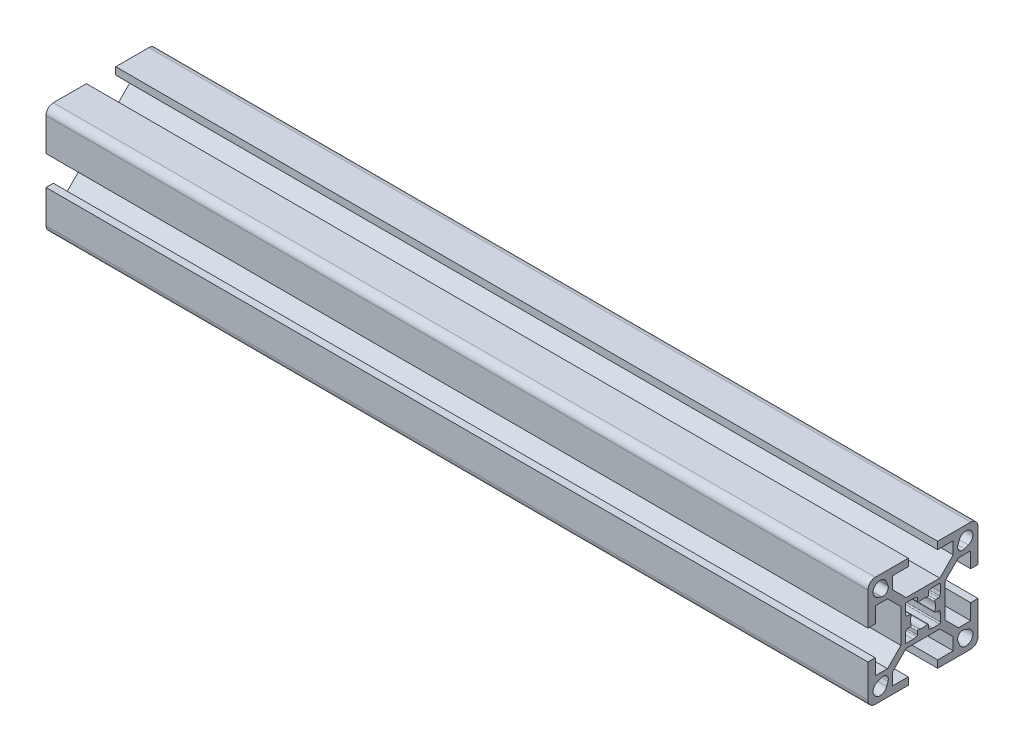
ISO-10303-21;
HEADER;
FILE_DESCRIPTION(('STEP AP214'),'2;1');
FILE_NAME('part.step','',(''),(''),'','','');
FILE_SCHEMA(('AUTOMOTIVE_DESIGN { 1 0 10303 214 1 1 1 1 }'));
ENDSEC;
DATA;
#1=APPLICATION_CONTEXT('core data for automotive mechanical design processes');
#2=APPLICATION_PROTOCOL_DEFINITION('international standard','automotive_design',2000,#1);
#3=PRODUCT_CONTEXT('',#1,'mechanical');
#4=PRODUCT('Part','Part','',(#3));
#5=PRODUCT_RELATED_PRODUCT_CATEGORY('part','',(#4));
#6=PRODUCT_DEFINITION_FORMATION('','',#4);
#7=PRODUCT_DEFINITION_CONTEXT('part definition',#1,'design');
#8=PRODUCT_DEFINITION('design','',#6,#7);
#9=PRODUCT_DEFINITION_SHAPE('','',#8);
#10=(LENGTH_UNIT() NAMED_UNIT(*) SI_UNIT(.MILLI.,.METRE.));
#11=(NAMED_UNIT(*) PLANE_ANGLE_UNIT() SI_UNIT($,.RADIAN.));
#12=(NAMED_UNIT(*) SI_UNIT($,.STERADIAN.) SOLID_ANGLE_UNIT());
#13=UNCERTAINTY_MEASURE_WITH_UNIT(LENGTH_MEASURE(1.E-05),#10,'distance_accuracy_value','');
#14=(GEOMETRIC_REPRESENTATION_CONTEXT(3) GLOBAL_UNCERTAINTY_ASSIGNED_CONTEXT((#13)) GLOBAL_UNIT_ASSIGNED_CONTEXT((#10,
#11,#12)) REPRESENTATION_CONTEXT('',''));
#15=CARTESIAN_POINT('',(0.,0.,0.));
#16=DIRECTION('',(0.,0.,1.));
#17=DIRECTION('',(1.,0.,0.));
#18=AXIS2_PLACEMENT_3D('',#15,#16,#17);
#19=CARTESIAN_POINT('',(224.,13.,13.));
#20=DIRECTION('',(1.,0.,0.));
#21=DIRECTION('',(0.,0.,-1.));
#22=AXIS2_PLACEMENT_3D('',#19,#20,#21);
#23=PLANE('',#22);
#24=CARTESIAN_POINT('',(224.,13.,13.));
#25=DIRECTION('',(1.,0.,0.));
#26=DIRECTION('',(0.,0.,-1.));
#27=AXIS2_PLACEMENT_3D('',#24,#25,#26);
#28=CIRCLE('',#27,1.99999999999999);
#29=CARTESIAN_POINT('',(224.,15.,13.));
#30=VERTEX_POINT('',#29);
#31=CARTESIAN_POINT('',(224.,13.,15.));
#32=VERTEX_POINT('',#31);
#33=EDGE_CURVE('E1302',#30,#32,#28,.T.);
#34=ORIENTED_EDGE('',*,*,#33,.T.);
#35=DIRECTION('',(0.,-1.,0.));
#36=VECTOR('',#35,1.);
#37=CARTESIAN_POINT('',(224.,13.,15.));
#38=LINE('',#37,#36);
#39=CARTESIAN_POINT('',(224.,3.99999999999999,15.));
#40=VERTEX_POINT('',#39);
#41=EDGE_CURVE('E1305',#32,#40,#38,.T.);
#42=ORIENTED_EDGE('',*,*,#41,.T.);
#43=DIRECTION('',(0.,0.,-1.));
#44=VECTOR('',#43,1.);
#45=CARTESIAN_POINT('',(224.,3.99999999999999,15.));
#46=LINE('',#45,#44);
#47=CARTESIAN_POINT('',(224.,3.99999999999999,13.));
#48=VERTEX_POINT('',#47);
#49=EDGE_CURVE('E1308',#40,#48,#46,.T.);
#50=ORIENTED_EDGE('',*,*,#49,.T.);
#51=DIRECTION('',(0.,1.,0.));
#52=VECTOR('',#51,1.);
#53=CARTESIAN_POINT('',(224.,3.99999999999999,13.));
#54=LINE('',#53,#52);
#55=CARTESIAN_POINT('',(224.,8.24999999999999,13.));
#56=VERTEX_POINT('',#55);
#57=EDGE_CURVE('E1310',#48,#56,#54,.T.);
#58=ORIENTED_EDGE('',*,*,#57,.T.);
#59=DIRECTION('',(0.,0.,-1.));
#60=VECTOR('',#59,1.);
#61=CARTESIAN_POINT('',(224.,8.24999999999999,13.));
#62=LINE('',#61,#60);
#63=CARTESIAN_POINT('',(224.,8.24999999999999,9.66421356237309));
#64=VERTEX_POINT('',#63);
#65=EDGE_CURVE('E1312',#56,#64,#62,.T.);
#66=ORIENTED_EDGE('',*,*,#65,.T.);
#67=DIRECTION('',(0.,-0.707106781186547,-0.707106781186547));
#68=VECTOR('',#67,1.);
#69=CARTESIAN_POINT('',(224.,8.24999999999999,9.66421356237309));
#70=LINE('',#69,#68);
#71=CARTESIAN_POINT('',(224.,4.5857864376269,6.));
#72=VERTEX_POINT('',#71);
#73=EDGE_CURVE('E1314',#64,#72,#70,.T.);
#74=ORIENTED_EDGE('',*,*,#73,.T.);
#75=DIRECTION('',(0.,-1.,0.));
#76=VECTOR('',#75,1.);
#77=CARTESIAN_POINT('',(224.,4.5857864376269,6.));
#78=LINE('',#77,#76);
#79=CARTESIAN_POINT('',(224.,-4.58578643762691,6.));
#80=VERTEX_POINT('',#79);
#81=EDGE_CURVE('E1316',#72,#80,#78,.T.);
#82=ORIENTED_EDGE('',*,*,#81,.T.);
#83=DIRECTION('',(0.,-0.707106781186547,0.707106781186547));
#84=VECTOR('',#83,1.);
#85=CARTESIAN_POINT('',(224.,-4.58578643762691,6.));
#86=LINE('',#85,#84);
#87=CARTESIAN_POINT('',(224.,-8.25,9.66421356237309));
#88=VERTEX_POINT('',#87);
#89=EDGE_CURVE('E1318',#80,#88,#86,.T.);
#90=ORIENTED_EDGE('',*,*,#89,.T.);
#91=DIRECTION('',(0.,0.,1.));
#92=VECTOR('',#91,1.);
#93=CARTESIAN_POINT('',(224.,-8.25,9.66421356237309));
#94=LINE('',#93,#92);
#95=CARTESIAN_POINT('',(224.,-8.25,13.));
#96=VERTEX_POINT('',#95);
#97=EDGE_CURVE('E1320',#88,#96,#94,.T.);
#98=ORIENTED_EDGE('',*,*,#97,.T.);
#99=DIRECTION('',(0.,1.,0.));
#100=VECTOR('',#99,1.);
#101=CARTESIAN_POINT('',(224.,-8.25,13.));
#102=LINE('',#101,#100);
#103=CARTESIAN_POINT('',(224.,-4.,13.));
#104=VERTEX_POINT('',#103);
#105=EDGE_CURVE('E1322',#96,#104,#102,.T.);
#106=ORIENTED_EDGE('',*,*,#105,.T.);
#107=DIRECTION('',(0.,0.,1.));
#108=VECTOR('',#107,1.);
#109=CARTESIAN_POINT('',(224.,-4.,13.));
#110=LINE('',#109,#108);
#111=CARTESIAN_POINT('',(224.,-4.,15.));
#112=VERTEX_POINT('',#111);
#113=EDGE_CURVE('E1324',#104,#112,#110,.T.);
#114=ORIENTED_EDGE('',*,*,#113,.T.);
#115=DIRECTION('',(0.,-1.,0.));
#116=VECTOR('',#115,1.);
#117=CARTESIAN_POINT('',(224.,-4.,15.));
#118=LINE('',#117,#116);
#119=CARTESIAN_POINT('',(224.,-13.,15.));
#120=VERTEX_POINT('',#119);
#121=EDGE_CURVE('E1326',#112,#120,#118,.T.);
#122=ORIENTED_EDGE('',*,*,#121,.T.);
#123=CARTESIAN_POINT('',(224.,-13.,13.));
#124=DIRECTION('',(1.,0.,0.));
#125=DIRECTION('',(0.,0.,-1.));
#126=AXIS2_PLACEMENT_3D('',#123,#124,#125);
#127=CIRCLE('',#126,2.);
#128=CARTESIAN_POINT('',(224.,-15.,13.));
#129=VERTEX_POINT('',#128);
#130=EDGE_CURVE('E1328',#120,#129,#127,.T.);
#131=ORIENTED_EDGE('',*,*,#130,.T.);
#132=DIRECTION('',(0.,0.,-1.));
#133=VECTOR('',#132,1.);
#134=CARTESIAN_POINT('',(224.,-15.,13.));
#135=LINE('',#134,#133);
#136=CARTESIAN_POINT('',(224.,-15.,4.));
#137=VERTEX_POINT('',#136);
#138=EDGE_CURVE('E1330',#129,#137,#135,.T.);
#139=ORIENTED_EDGE('',*,*,#138,.T.);
#140=DIRECTION('',(0.,1.,0.));
#141=VECTOR('',#140,1.);
#142=CARTESIAN_POINT('',(224.,-15.,4.));
#143=LINE('',#142,#141);
#144=CARTESIAN_POINT('',(224.,-13.,4.));
#145=VERTEX_POINT('',#144);
#146=EDGE_CURVE('E1332',#137,#145,#143,.T.);
#147=ORIENTED_EDGE('',*,*,#146,.T.);
#148=DIRECTION('',(0.,0.,1.));
#149=VECTOR('',#148,1.);
#150=CARTESIAN_POINT('',(224.,-13.,4.));
#151=LINE('',#150,#149);
#152=CARTESIAN_POINT('',(224.,-13.,8.25));
#153=VERTEX_POINT('',#152);
#154=EDGE_CURVE('E1334',#145,#153,#151,.T.);
#155=ORIENTED_EDGE('',*,*,#154,.T.);
#156=DIRECTION('',(0.,1.,0.));
#157=VECTOR('',#156,1.);
#158=CARTESIAN_POINT('',(224.,-13.,8.25));
#159=LINE('',#158,#157);
#160=CARTESIAN_POINT('',(224.,-9.6642135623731,8.25));
#161=VERTEX_POINT('',#160);
#162=EDGE_CURVE('E1336',#153,#161,#159,.T.);
#163=ORIENTED_EDGE('',*,*,#162,.T.);
#164=DIRECTION('',(0.,0.707106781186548,-0.707106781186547));
#165=VECTOR('',#164,1.);
#166=CARTESIAN_POINT('',(224.,-9.6642135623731,8.25));
#167=LINE('',#166,#165);
#168=CARTESIAN_POINT('',(224.,-6.00000000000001,4.58578643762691));
#169=VERTEX_POINT('',#168);
#170=EDGE_CURVE('E1338',#161,#169,#167,.T.);
#171=ORIENTED_EDGE('',*,*,#170,.T.);
#172=DIRECTION('',(0.,0.,-1.));
#173=VECTOR('',#172,1.);
#174=CARTESIAN_POINT('',(224.,-6.00000000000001,4.58578643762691));
#175=LINE('',#174,#173);
#176=CARTESIAN_POINT('',(224.,-6.00000000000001,-4.58578643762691));
#177=VERTEX_POINT('',#176);
#178=EDGE_CURVE('E1340',#169,#177,#175,.T.);
#179=ORIENTED_EDGE('',*,*,#178,.T.);
#180=DIRECTION('',(0.,-0.707106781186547,-0.707106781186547));
#181=VECTOR('',#180,1.);
#182=CARTESIAN_POINT('',(224.,-6.00000000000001,-4.58578643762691));
#183=LINE('',#182,#181);
#184=CARTESIAN_POINT('',(224.,-9.6642135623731,-8.25000000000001));
#185=VERTEX_POINT('',#184);
#186=EDGE_CURVE('E1342',#177,#185,#183,.T.);
#187=ORIENTED_EDGE('',*,*,#186,.T.);
#188=DIRECTION('',(0.,-1.,0.));
#189=VECTOR('',#188,1.);
#190=CARTESIAN_POINT('',(224.,-9.6642135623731,-8.25000000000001));
#191=LINE('',#190,#189);
#192=CARTESIAN_POINT('',(224.,-13.,-8.25000000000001));
#193=VERTEX_POINT('',#192);
#194=EDGE_CURVE('E1344',#185,#193,#191,.T.);
#195=ORIENTED_EDGE('',*,*,#194,.T.);
#196=DIRECTION('',(0.,0.,1.));
#197=VECTOR('',#196,1.);
#198=CARTESIAN_POINT('',(224.,-13.,-8.25000000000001));
#199=LINE('',#198,#197);
#200=CARTESIAN_POINT('',(224.,-13.,-4.));
#201=VERTEX_POINT('',#200);
#202=EDGE_CURVE('E1346',#193,#201,#199,.T.);
#203=ORIENTED_EDGE('',*,*,#202,.T.);
#204=DIRECTION('',(0.,-1.,0.));
#205=VECTOR('',#204,1.);
#206=CARTESIAN_POINT('',(224.,-13.,-4.));
#207=LINE('',#206,#205);
#208=CARTESIAN_POINT('',(224.,-15.,-4.));
#209=VERTEX_POINT('',#208);
#210=EDGE_CURVE('E1348',#201,#209,#207,.T.);
#211=ORIENTED_EDGE('',*,*,#210,.T.);
#212=DIRECTION('',(0.,0.,-1.));
#213=VECTOR('',#212,1.);
#214=CARTESIAN_POINT('',(224.,-15.,-4.));
#215=LINE('',#214,#213);
#216=CARTESIAN_POINT('',(224.,-15.,-13.));
#217=VERTEX_POINT('',#216);
#218=EDGE_CURVE('E1350',#209,#217,#215,.T.);
#219=ORIENTED_EDGE('',*,*,#218,.T.);
#220=CARTESIAN_POINT('',(224.,-13.,-13.));
#221=DIRECTION('',(1.,0.,0.));
#222=DIRECTION('',(0.,0.,-1.));
#223=AXIS2_PLACEMENT_3D('',#220,#221,#222);
#224=CIRCLE('',#223,1.99999999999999);
#225=CARTESIAN_POINT('',(224.,-13.,-15.));
#226=VERTEX_POINT('',#225);
#227=EDGE_CURVE('E1352',#217,#226,#224,.T.);
#228=ORIENTED_EDGE('',*,*,#227,.T.);
#229=DIRECTION('',(0.,1.,0.));
#230=VECTOR('',#229,1.);
#231=CARTESIAN_POINT('',(224.,-13.,-15.));
#232=LINE('',#231,#230);
#233=CARTESIAN_POINT('',(224.,-4.00000000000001,-15.));
#234=VERTEX_POINT('',#233);
#235=EDGE_CURVE('E1354',#226,#234,#232,.T.);
#236=ORIENTED_EDGE('',*,*,#235,.T.);
#237=DIRECTION('',(0.,0.,1.));
#238=VECTOR('',#237,1.);
#239=CARTESIAN_POINT('',(224.,-4.00000000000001,-15.));
#240=LINE('',#239,#238);
#241=CARTESIAN_POINT('',(224.,-4.00000000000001,-13.));
#242=VERTEX_POINT('',#241);
#243=EDGE_CURVE('E1356',#234,#242,#240,.T.);
#244=ORIENTED_EDGE('',*,*,#243,.T.);
#245=DIRECTION('',(0.,-1.,0.));
#246=VECTOR('',#245,1.);
#247=CARTESIAN_POINT('',(224.,-4.00000000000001,-13.));
#248=LINE('',#247,#246);
#249=CARTESIAN_POINT('',(224.,-8.25000000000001,-13.));
#250=VERTEX_POINT('',#249);
#251=EDGE_CURVE('E1358',#242,#250,#248,.T.);
#252=ORIENTED_EDGE('',*,*,#251,.T.);
#253=DIRECTION('',(0.,0.,1.));
#254=VECTOR('',#253,1.);
#255=CARTESIAN_POINT('',(224.,-8.25000000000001,-13.));
#256=LINE('',#255,#254);
#257=CARTESIAN_POINT('',(224.,-8.25000000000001,-9.6642135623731));
#258=VERTEX_POINT('',#257);
#259=EDGE_CURVE('E1360',#250,#258,#256,.T.);
#260=ORIENTED_EDGE('',*,*,#259,.T.);
#261=DIRECTION('',(0.,0.707106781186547,0.707106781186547));
#262=VECTOR('',#261,1.);
#263=CARTESIAN_POINT('',(224.,-8.25000000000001,-9.6642135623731));
#264=LINE('',#263,#262);
#265=CARTESIAN_POINT('',(224.,-4.58578643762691,-6.00000000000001));
#266=VERTEX_POINT('',#265);
#267=EDGE_CURVE('E1362',#258,#266,#264,.T.);
#268=ORIENTED_EDGE('',*,*,#267,.T.);
#269=DIRECTION('',(0.,1.,0.));
#270=VECTOR('',#269,1.);
#271=CARTESIAN_POINT('',(224.,-4.58578643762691,-6.00000000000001));
#272=LINE('',#271,#270);
#273=CARTESIAN_POINT('',(224.,4.5857864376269,-6.00000000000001));
#274=VERTEX_POINT('',#273);
#275=EDGE_CURVE('E1364',#266,#274,#272,.T.);
#276=ORIENTED_EDGE('',*,*,#275,.T.);
#277=DIRECTION('',(0.,0.707106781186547,-0.707106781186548));
#278=VECTOR('',#277,1.);
#279=CARTESIAN_POINT('',(224.,4.5857864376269,-6.00000000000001));
#280=LINE('',#279,#278);
#281=CARTESIAN_POINT('',(224.,8.24999999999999,-9.6642135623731));
#282=VERTEX_POINT('',#281);
#283=EDGE_CURVE('E1366',#274,#282,#280,.T.);
#284=ORIENTED_EDGE('',*,*,#283,.T.);
#285=DIRECTION('',(0.,0.,-1.));
#286=VECTOR('',#285,1.);
#287=CARTESIAN_POINT('',(224.,8.24999999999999,-9.6642135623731));
#288=LINE('',#287,#286);
#289=CARTESIAN_POINT('',(224.,8.24999999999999,-13.));
#290=VERTEX_POINT('',#289);
#291=EDGE_CURVE('E1368',#282,#290,#288,.T.);
#292=ORIENTED_EDGE('',*,*,#291,.T.);
#293=DIRECTION('',(0.,-1.,0.));
#294=VECTOR('',#293,1.);
#295=CARTESIAN_POINT('',(224.,8.24999999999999,-13.));
#296=LINE('',#295,#294);
#297=CARTESIAN_POINT('',(224.,3.99999999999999,-13.));
#298=VERTEX_POINT('',#297);
#299=EDGE_CURVE('E1370',#290,#298,#296,.T.);
#300=ORIENTED_EDGE('',*,*,#299,.T.);
#301=DIRECTION('',(0.,0.,-1.));
#302=VECTOR('',#301,1.);
#303=CARTESIAN_POINT('',(224.,3.99999999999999,-13.));
#304=LINE('',#303,#302);
#305=CARTESIAN_POINT('',(224.,3.99999999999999,-15.));
#306=VERTEX_POINT('',#305);
#307=EDGE_CURVE('E1372',#298,#306,#304,.T.);
#308=ORIENTED_EDGE('',*,*,#307,.T.);
#309=DIRECTION('',(0.,1.,0.));
#310=VECTOR('',#309,1.);
#311=CARTESIAN_POINT('',(224.,3.99999999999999,-15.));
#312=LINE('',#311,#310);
#313=CARTESIAN_POINT('',(224.,13.,-15.));
#314=VERTEX_POINT('',#313);
#315=EDGE_CURVE('E1374',#306,#314,#312,.T.);
#316=ORIENTED_EDGE('',*,*,#315,.T.);
#317=CARTESIAN_POINT('',(224.,13.,-13.));
#318=DIRECTION('',(1.,0.,0.));
#319=DIRECTION('',(0.,0.,-1.));
#320=AXIS2_PLACEMENT_3D('',#317,#318,#319);
#321=CIRCLE('',#320,2.);
#322=CARTESIAN_POINT('',(224.,15.,-13.));
#323=VERTEX_POINT('',#322);
#324=EDGE_CURVE('E1376',#314,#323,#321,.T.);
#325=ORIENTED_EDGE('',*,*,#324,.T.);
#326=DIRECTION('',(0.,0.,1.));
#327=VECTOR('',#326,1.);
#328=CARTESIAN_POINT('',(224.,15.,-13.));
#329=LINE('',#328,#327);
#330=CARTESIAN_POINT('',(224.,15.,-4.));
#331=VERTEX_POINT('',#330);
#332=EDGE_CURVE('E1378',#323,#331,#329,.T.);
#333=ORIENTED_EDGE('',*,*,#332,.T.);
#334=DIRECTION('',(0.,-1.,0.));
#335=VECTOR('',#334,1.);
#336=CARTESIAN_POINT('',(224.,15.,-4.));
#337=LINE('',#336,#335);
#338=CARTESIAN_POINT('',(224.,13.,-4.));
#339=VERTEX_POINT('',#338);
#340=EDGE_CURVE('E1380',#331,#339,#337,.T.);
#341=ORIENTED_EDGE('',*,*,#340,.T.);
#342=DIRECTION('',(0.,0.,-1.));
#343=VECTOR('',#342,1.);
#344=CARTESIAN_POINT('',(224.,13.,-4.));
#345=LINE('',#344,#343);
#346=CARTESIAN_POINT('',(224.,13.,-8.25000000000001));
#347=VERTEX_POINT('',#346);
#348=EDGE_CURVE('E1382',#339,#347,#345,.T.);
#349=ORIENTED_EDGE('',*,*,#348,.T.);
#350=DIRECTION('',(0.,-1.,0.));
#351=VECTOR('',#350,1.);
#352=CARTESIAN_POINT('',(224.,13.,-8.25000000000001));
#353=LINE('',#352,#351);
#354=CARTESIAN_POINT('',(224.,9.66421356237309,-8.25000000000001));
#355=VERTEX_POINT('',#354);
#356=EDGE_CURVE('E1384',#347,#355,#353,.T.);
#357=ORIENTED_EDGE('',*,*,#356,.T.);
#358=DIRECTION('',(0.,-0.707106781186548,0.707106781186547));
#359=VECTOR('',#358,1.);
#360=CARTESIAN_POINT('',(224.,9.66421356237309,-8.25000000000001));
#361=LINE('',#360,#359);
#362=CARTESIAN_POINT('',(224.,5.99999999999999,-4.58578643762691));
#363=VERTEX_POINT('',#362);
#364=EDGE_CURVE('E1386',#355,#363,#361,.T.);
#365=ORIENTED_EDGE('',*,*,#364,.T.);
#366=DIRECTION('',(0.,0.,1.));
#367=VECTOR('',#366,1.);
#368=CARTESIAN_POINT('',(224.,5.99999999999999,-4.58578643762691));
#369=LINE('',#368,#367);
#370=CARTESIAN_POINT('',(224.,5.99999999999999,4.58578643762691));
#371=VERTEX_POINT('',#370);
#372=EDGE_CURVE('E1388',#363,#371,#369,.T.);
#373=ORIENTED_EDGE('',*,*,#372,.T.);
#374=DIRECTION('',(0.,0.707106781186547,0.707106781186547));
#375=VECTOR('',#374,1.);
#376=CARTESIAN_POINT('',(224.,5.99999999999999,4.58578643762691));
#377=LINE('',#376,#375);
#378=CARTESIAN_POINT('',(224.,9.66421356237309,8.25));
#379=VERTEX_POINT('',#378);
#380=EDGE_CURVE('E1390',#371,#379,#377,.T.);
#381=ORIENTED_EDGE('',*,*,#380,.T.);
#382=DIRECTION('',(0.,1.,0.));
#383=VECTOR('',#382,1.);
#384=CARTESIAN_POINT('',(224.,9.66421356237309,8.25));
#385=LINE('',#384,#383);
#386=CARTESIAN_POINT('',(224.,13.,8.25));
#387=VERTEX_POINT('',#386);
#388=EDGE_CURVE('E1392',#379,#387,#385,.T.);
#389=ORIENTED_EDGE('',*,*,#388,.T.);
#390=DIRECTION('',(0.,0.,-1.));
#391=VECTOR('',#390,1.);
#392=CARTESIAN_POINT('',(224.,13.,8.25));
#393=LINE('',#392,#391);
#394=CARTESIAN_POINT('',(224.,13.,4.));
#395=VERTEX_POINT('',#394);
#396=EDGE_CURVE('E1394',#387,#395,#393,.T.);
#397=ORIENTED_EDGE('',*,*,#396,.T.);
#398=DIRECTION('',(0.,1.,0.));
#399=VECTOR('',#398,1.);
#400=CARTESIAN_POINT('',(224.,13.,4.));
#401=LINE('',#400,#399);
#402=CARTESIAN_POINT('',(224.,15.,4.));
#403=VERTEX_POINT('',#402);
#404=EDGE_CURVE('E1396',#395,#403,#401,.T.);
#405=ORIENTED_EDGE('',*,*,#404,.T.);
#406=DIRECTION('',(0.,0.,1.));
#407=VECTOR('',#406,1.);
#408=CARTESIAN_POINT('',(224.,15.,4.));
#409=LINE('',#408,#407);
#410=EDGE_CURVE('E1398',#403,#30,#409,.T.);
#411=ORIENTED_EDGE('',*,*,#410,.T.);
#412=EDGE_LOOP('',(#34,#42,#50,#58,#66,#74,#82,#90,#98,#106,#114,#122,#131,#139,#147,#155,#163,
#171,#179,#187,#195,#203,#211,#219,#228,#236,#244,#252,#260,#268,#276,#284,#292,#300,#308,#316,
#325,#333,#341,#349,#357,#365,#373,#381,#389,#397,#405,#411));
#413=FACE_BOUND('',#412,.T.);
#414=DIRECTION('',(0.,-0.348174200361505,-0.93742985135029));
#415=VECTOR('',#414,1.);
#416=CARTESIAN_POINT('',(224.,9.91888328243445,12.3615309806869));
#417=LINE('',#416,#415);
#418=CARTESIAN_POINT('',(224.,9.91888328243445,12.3615309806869));
#419=VERTEX_POINT('',#418);
#420=CARTESIAN_POINT('',(224.,9.53907007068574,11.3389157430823));
#421=VERTEX_POINT('',#420);
#422=EDGE_CURVE('E1273',#419,#421,#417,.T.);
#423=ORIENTED_EDGE('',*,*,#422,.F.);
#424=CARTESIAN_POINT('',(224.,11.7,11.7));
#425=DIRECTION('',(1.,0.,0.));
#426=DIRECTION('',(0.,0.,-1.));
#427=AXIS2_PLACEMENT_3D('',#424,#425,#426);
#428=CIRCLE('',#427,1.9);
#429=CARTESIAN_POINT('',(224.,12.3615309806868,9.91888328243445));
#430=VERTEX_POINT('',#429);
#431=EDGE_CURVE('E1271',#430,#419,#428,.T.);
#432=ORIENTED_EDGE('',*,*,#431,.F.);
#433=DIRECTION('',(0.,0.937429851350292,0.3481742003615));
#434=VECTOR('',#433,1.);
#435=CARTESIAN_POINT('',(224.,11.3389157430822,9.53907007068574));
#436=LINE('',#435,#434);
#437=CARTESIAN_POINT('',(224.,11.3389157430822,9.53907007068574));
#438=VERTEX_POINT('',#437);
#439=EDGE_CURVE('E1279',#438,#430,#436,.T.);
#440=ORIENTED_EDGE('',*,*,#439,.F.);
#441=CARTESIAN_POINT('',(224.,10.8514718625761,10.8514718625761));
#442=DIRECTION('',(1.,0.,0.));
#443=DIRECTION('',(0.,0.,-1.));
#444=AXIS2_PLACEMENT_3D('',#441,#442,#443);
#445=CIRCLE('',#444,1.4);
#446=EDGE_CURVE('E1276',#421,#438,#445,.T.);
#447=ORIENTED_EDGE('',*,*,#446,.F.);
#448=EDGE_LOOP('',(#423,#432,#440,#447));
#449=FACE_BOUND('',#448,.T.);
#450=DIRECTION('',(0.,0.3481742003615,-0.937429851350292));
#451=VECTOR('',#450,1.);
#452=CARTESIAN_POINT('',(224.,9.53907007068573,-11.3389157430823));
#453=LINE('',#452,#451);
#454=CARTESIAN_POINT('',(224.,9.53907007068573,-11.3389157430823));
#455=VERTEX_POINT('',#454);
#456=CARTESIAN_POINT('',(224.,9.91888328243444,-12.3615309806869));
#457=VERTEX_POINT('',#456);
#458=EDGE_CURVE('E1242',#455,#457,#453,.T.);
#459=ORIENTED_EDGE('',*,*,#458,.F.);
#460=CARTESIAN_POINT('',(224.,10.8514718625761,-10.8514718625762));
#461=DIRECTION('',(1.,0.,0.));
#462=DIRECTION('',(0.,0.,-1.));
#463=AXIS2_PLACEMENT_3D('',#460,#461,#462);
#464=CIRCLE('',#463,1.4);
#465=CARTESIAN_POINT('',(224.,11.3389157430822,-9.53907007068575));
#466=VERTEX_POINT('',#465);
#467=EDGE_CURVE('E1240',#466,#455,#464,.T.);
#468=ORIENTED_EDGE('',*,*,#467,.F.);
#469=DIRECTION('',(0.,-0.937429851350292,0.3481742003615));
#470=VECTOR('',#469,1.);
#471=CARTESIAN_POINT('',(224.,12.3615309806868,-9.91888328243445));
#472=LINE('',#471,#470);
#473=CARTESIAN_POINT('',(224.,12.3615309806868,-9.91888328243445));
#474=VERTEX_POINT('',#473);
#475=EDGE_CURVE('E1248',#474,#466,#472,.T.);
#476=ORIENTED_EDGE('',*,*,#475,.F.);
#477=CARTESIAN_POINT('',(224.,11.7,-11.7));
#478=DIRECTION('',(1.,0.,0.));
#479=DIRECTION('',(0.,0.,-1.));
#480=AXIS2_PLACEMENT_3D('',#477,#478,#479);
#481=CIRCLE('',#480,1.9);
#482=EDGE_CURVE('E1245',#457,#474,#481,.T.);
#483=ORIENTED_EDGE('',*,*,#482,.F.);
#484=EDGE_LOOP('',(#459,#468,#476,#483));
#485=FACE_BOUND('',#484,.T.);
#486=DIRECTION('',(0.,0.,-1.));
#487=VECTOR('',#486,1.);
#488=CARTESIAN_POINT('',(224.,-4.80000000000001,4.5));
#489=LINE('',#488,#487);
#490=CARTESIAN_POINT('',(224.,-4.80000000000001,4.5));
#491=VERTEX_POINT('',#490);
#492=CARTESIAN_POINT('',(224.,-4.80000000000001,2.64443357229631));
#493=VERTEX_POINT('',#492);
#494=EDGE_CURVE('E847',#491,#493,#489,.T.);
#495=ORIENTED_EDGE('',*,*,#494,.F.);
#496=CARTESIAN_POINT('',(224.,-4.50000000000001,4.5));
#497=DIRECTION('',(1.,0.,0.));
#498=DIRECTION('',(0.,0.,-1.));
#499=AXIS2_PLACEMENT_3D('',#496,#497,#498);
#500=CIRCLE('',#499,0.299999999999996);
#501=CARTESIAN_POINT('',(224.,-4.50000000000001,4.8));
#502=VERTEX_POINT('',#501);
#503=EDGE_CURVE('E845',#502,#491,#500,.T.);
#504=ORIENTED_EDGE('',*,*,#503,.F.);
#505=DIRECTION('',(0.,-1.,0.));
#506=VECTOR('',#505,1.);
#507=CARTESIAN_POINT('',(224.,-2.6444335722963,4.8));
#508=LINE('',#507,#506);
#509=CARTESIAN_POINT('',(224.,-2.64443357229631,4.8));
#510=VERTEX_POINT('',#509);
#511=EDGE_CURVE('E957',#510,#502,#508,.T.);
#512=ORIENTED_EDGE('',*,*,#511,.F.);
#513=CARTESIAN_POINT('',(224.,-2.6444335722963,4.50000000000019));
#514=DIRECTION('',(1.,0.,0.));
#515=DIRECTION('',(0.,0.,-1.));
#516=AXIS2_PLACEMENT_3D('',#513,#514,#515);
#517=CIRCLE('',#516,0.299999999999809);
#518=CARTESIAN_POINT('',(224.,-2.58719087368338,4.7944881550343));
#519=VERTEX_POINT('',#518);
#520=EDGE_CURVE('E954',#519,#510,#517,.T.);
#521=ORIENTED_EDGE('',*,*,#520,.F.);
#522=DIRECTION('',(0.,-0.981627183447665,0.190808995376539));
#523=VECTOR('',#522,1.);
#524=CARTESIAN_POINT('',(224.,-1.74275730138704,4.63034689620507));
#525=LINE('',#524,#523);
#526=CARTESIAN_POINT('',(224.,-1.74275730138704,4.63034689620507));
#527=VERTEX_POINT('',#526);
#528=EDGE_CURVE('E952',#527,#519,#525,.T.);
#529=ORIENTED_EDGE('',*,*,#528,.F.);
#530=CARTESIAN_POINT('',(224.,-1.8,4.33585874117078));
#531=DIRECTION('',(1.,0.,0.));
#532=DIRECTION('',(0.,0.,-1.));
#533=AXIS2_PLACEMENT_3D('',#530,#531,#532);
#534=CIRCLE('',#533,0.299999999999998);
#535=CARTESIAN_POINT('',(224.,-1.50000000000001,4.33585874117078));
#536=VERTEX_POINT('',#535);
#537=EDGE_CURVE('E950',#536,#527,#534,.T.);
#538=ORIENTED_EDGE('',*,*,#537,.F.);
#539=DIRECTION('',(0.,0.,1.));
#540=VECTOR('',#539,1.);
#541=CARTESIAN_POINT('',(224.,-1.50000000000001,3.5));
#542=LINE('',#541,#540);
#543=CARTESIAN_POINT('',(224.,-1.50000000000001,3.5));
#544=VERTEX_POINT('',#543);
#545=EDGE_CURVE('E948',#544,#536,#542,.T.);
#546=ORIENTED_EDGE('',*,*,#545,.F.);
#547=CARTESIAN_POINT('',(224.,-1.20000000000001,3.5));
#548=DIRECTION('',(-1.,0.,0.));
#549=DIRECTION('',(0.,0.,-1.));
#550=AXIS2_PLACEMENT_3D('',#547,#548,#549);
#551=CIRCLE('',#550,0.3);
#552=CARTESIAN_POINT('',(224.,-1.10270270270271,3.21621621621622));
#553=VERTEX_POINT('',#552);
#554=EDGE_CURVE('E946',#553,#544,#551,.T.);
#555=ORIENTED_EDGE('',*,*,#554,.F.);
#556=CARTESIAN_POINT('',(224.,0.,0.));
#557=DIRECTION('',(1.,0.,0.));
#558=DIRECTION('',(0.,0.,-1.));
#559=AXIS2_PLACEMENT_3D('',#556,#557,#558);
#560=CIRCLE('',#559,3.40000000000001);
#561=CARTESIAN_POINT('',(224.,1.1027027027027,3.21621621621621));
#562=VERTEX_POINT('',#561);
#563=EDGE_CURVE('E944',#562,#553,#560,.T.);
#564=ORIENTED_EDGE('',*,*,#563,.F.);
#565=CARTESIAN_POINT('',(224.,1.2,3.5));
#566=DIRECTION('',(-1.,0.,0.));
#567=DIRECTION('',(0.,0.,-1.));
#568=AXIS2_PLACEMENT_3D('',#565,#566,#567);
#569=CIRCLE('',#568,0.3);
#570=CARTESIAN_POINT('',(224.,1.5,3.5));
#571=VERTEX_POINT('',#570);
#572=EDGE_CURVE('E942',#571,#562,#569,.T.);
#573=ORIENTED_EDGE('',*,*,#572,.F.);
#574=DIRECTION('',(0.,0.,-1.));
#575=VECTOR('',#574,1.);
#576=CARTESIAN_POINT('',(224.,1.5,4.33585874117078));
#577=LINE('',#576,#575);
#578=CARTESIAN_POINT('',(224.,1.5,4.33585874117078));
#579=VERTEX_POINT('',#578);
#580=EDGE_CURVE('E940',#579,#571,#577,.T.);
#581=ORIENTED_EDGE('',*,*,#580,.F.);
#582=CARTESIAN_POINT('',(224.,1.79999999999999,4.33585874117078));
#583=DIRECTION('',(1.,0.,0.));
#584=DIRECTION('',(0.,0.,-1.));
#585=AXIS2_PLACEMENT_3D('',#582,#583,#584);
#586=CIRCLE('',#585,0.299999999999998);
#587=CARTESIAN_POINT('',(224.,1.74275730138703,4.63034689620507));
#588=VERTEX_POINT('',#587);
#589=EDGE_CURVE('E938',#588,#579,#586,.T.);
#590=ORIENTED_EDGE('',*,*,#589,.F.);
#591=DIRECTION('',(0.,-0.981627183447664,-0.190808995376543));
#592=VECTOR('',#591,1.);
#593=CARTESIAN_POINT('',(224.,2.58719087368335,4.7944881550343));
#594=LINE('',#593,#592);
#595=CARTESIAN_POINT('',(224.,2.58719087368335,4.7944881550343));
#596=VERTEX_POINT('',#595);
#597=EDGE_CURVE('E936',#596,#588,#594,.T.);
#598=ORIENTED_EDGE('',*,*,#597,.F.);
#599=CARTESIAN_POINT('',(224.,2.6444335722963,4.50000000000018));
#600=DIRECTION('',(1.,0.,0.));
#601=DIRECTION('',(0.,0.,-1.));
#602=AXIS2_PLACEMENT_3D('',#599,#600,#601);
#603=CIRCLE('',#602,0.299999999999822);
#604=CARTESIAN_POINT('',(224.,2.6444335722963,4.8));
#605=VERTEX_POINT('',#604);
#606=EDGE_CURVE('E934',#605,#596,#603,.T.);
#607=ORIENTED_EDGE('',*,*,#606,.F.);
#608=DIRECTION('',(0.,-1.,0.));
#609=VECTOR('',#608,1.);
#610=CARTESIAN_POINT('',(224.,4.5,4.8));
#611=LINE('',#610,#609);
#612=CARTESIAN_POINT('',(224.,4.5,4.8));
#613=VERTEX_POINT('',#612);
#614=EDGE_CURVE('E932',#613,#605,#611,.T.);
#615=ORIENTED_EDGE('',*,*,#614,.F.);
#616=CARTESIAN_POINT('',(224.,4.5,4.5));
#617=DIRECTION('',(1.,0.,0.));
#618=DIRECTION('',(0.,0.,-1.));
#619=AXIS2_PLACEMENT_3D('',#616,#617,#618);
#620=CIRCLE('',#619,0.299999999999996);
#621=CARTESIAN_POINT('',(224.,4.79999999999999,4.5));
#622=VERTEX_POINT('',#621);
#623=EDGE_CURVE('E930',#622,#613,#620,.T.);
#624=ORIENTED_EDGE('',*,*,#623,.F.);
#625=DIRECTION('',(0.,0.,1.));
#626=VECTOR('',#625,1.);
#627=CARTESIAN_POINT('',(224.,4.8,2.6444335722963));
#628=LINE('',#627,#626);
#629=CARTESIAN_POINT('',(224.,4.8,2.6444335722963));
#630=VERTEX_POINT('',#629);
#631=EDGE_CURVE('E928',#630,#622,#628,.T.);
#632=ORIENTED_EDGE('',*,*,#631,.F.);
#633=CARTESIAN_POINT('',(224.,4.50000000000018,2.6444335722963));
#634=DIRECTION('',(1.,0.,0.));
#635=DIRECTION('',(0.,0.,-1.));
#636=AXIS2_PLACEMENT_3D('',#633,#634,#635);
#637=CIRCLE('',#636,0.299999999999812);
#638=CARTESIAN_POINT('',(224.,4.7944881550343,2.58719087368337));
#639=VERTEX_POINT('',#638);
#640=EDGE_CURVE('E926',#639,#630,#637,.T.);
#641=ORIENTED_EDGE('',*,*,#640,.F.);
#642=DIRECTION('',(0.,0.190808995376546,0.981627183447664));
#643=VECTOR('',#642,1.);
#644=CARTESIAN_POINT('',(224.,4.63034689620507,1.74275730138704));
#645=LINE('',#644,#643);
#646=CARTESIAN_POINT('',(224.,4.63034689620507,1.74275730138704));
#647=VERTEX_POINT('',#646);
#648=EDGE_CURVE('E924',#647,#639,#645,.T.);
#649=ORIENTED_EDGE('',*,*,#648,.F.);
#650=CARTESIAN_POINT('',(224.,4.33585874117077,1.8));
#651=DIRECTION('',(1.,0.,0.));
#652=DIRECTION('',(0.,0.,-1.));
#653=AXIS2_PLACEMENT_3D('',#650,#651,#652);
#654=CIRCLE('',#653,0.299999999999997);
#655=CARTESIAN_POINT('',(224.,4.33585874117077,1.5));
#656=VERTEX_POINT('',#655);
#657=EDGE_CURVE('E922',#656,#647,#654,.T.);
#658=ORIENTED_EDGE('',*,*,#657,.F.);
#659=DIRECTION('',(0.,1.,0.));
#660=VECTOR('',#659,1.);
#661=CARTESIAN_POINT('',(224.,3.5,1.5));
#662=LINE('',#661,#660);
#663=CARTESIAN_POINT('',(224.,3.5,1.5));
#664=VERTEX_POINT('',#663);
#665=EDGE_CURVE('E920',#664,#656,#662,.T.);
#666=ORIENTED_EDGE('',*,*,#665,.F.);
#667=CARTESIAN_POINT('',(224.,3.5,1.2));
#668=DIRECTION('',(-1.,0.,0.));
#669=DIRECTION('',(0.,0.,-1.));
#670=AXIS2_PLACEMENT_3D('',#667,#668,#669);
#671=CIRCLE('',#670,0.300000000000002);
#672=CARTESIAN_POINT('',(224.,3.21621621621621,1.1027027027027));
#673=VERTEX_POINT('',#672);
#674=EDGE_CURVE('E918',#673,#664,#671,.T.);
#675=ORIENTED_EDGE('',*,*,#674,.F.);
#676=CARTESIAN_POINT('',(224.,0.,0.));
#677=DIRECTION('',(1.,0.,0.));
#678=DIRECTION('',(0.,0.,-1.));
#679=AXIS2_PLACEMENT_3D('',#676,#677,#678);
#680=CIRCLE('',#679,3.4);
#681=CARTESIAN_POINT('',(224.,3.21621621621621,-1.10270270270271));
#682=VERTEX_POINT('',#681);
#683=EDGE_CURVE('E916',#682,#673,#680,.T.);
#684=ORIENTED_EDGE('',*,*,#683,.F.);
#685=CARTESIAN_POINT('',(224.,3.49999999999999,-1.20000000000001));
#686=DIRECTION('',(-1.,0.,0.));
#687=DIRECTION('',(0.,0.,-1.));
#688=AXIS2_PLACEMENT_3D('',#685,#686,#687);
#689=CIRCLE('',#688,0.299999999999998);
#690=CARTESIAN_POINT('',(224.,3.49999999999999,-1.5));
#691=VERTEX_POINT('',#690);
#692=EDGE_CURVE('E914',#691,#682,#689,.T.);
#693=ORIENTED_EDGE('',*,*,#692,.F.);
#694=DIRECTION('',(0.,-1.,0.));
#695=VECTOR('',#694,1.);
#696=CARTESIAN_POINT('',(224.,4.33585874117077,-1.5));
#697=LINE('',#696,#695);
#698=CARTESIAN_POINT('',(224.,4.33585874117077,-1.5));
#699=VERTEX_POINT('',#698);
#700=EDGE_CURVE('E912',#699,#691,#697,.T.);
#701=ORIENTED_EDGE('',*,*,#700,.F.);
#702=CARTESIAN_POINT('',(224.,4.33585874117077,-1.8));
#703=DIRECTION('',(1.,0.,0.));
#704=DIRECTION('',(0.,0.,-1.));
#705=AXIS2_PLACEMENT_3D('',#702,#703,#704);
#706=CIRCLE('',#705,0.299999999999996);
#707=CARTESIAN_POINT('',(224.,4.63034689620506,-1.74275730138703));
#708=VERTEX_POINT('',#707);
#709=EDGE_CURVE('E910',#708,#699,#706,.T.);
#710=ORIENTED_EDGE('',*,*,#709,.F.);
#711=DIRECTION('',(0.,-0.190808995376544,0.981627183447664));
#712=VECTOR('',#711,1.);
#713=CARTESIAN_POINT('',(224.,4.79448815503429,-2.58719087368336));
#714=LINE('',#713,#712);
#715=CARTESIAN_POINT('',(224.,4.79448815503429,-2.58719087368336));
#716=VERTEX_POINT('',#715);
#717=EDGE_CURVE('E908',#716,#708,#714,.T.);
#718=ORIENTED_EDGE('',*,*,#717,.F.);
#719=CARTESIAN_POINT('',(224.,4.50000000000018,-2.64443357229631));
#720=DIRECTION('',(1.,0.,0.));
#721=DIRECTION('',(0.,0.,-1.));
#722=AXIS2_PLACEMENT_3D('',#719,#720,#721);
#723=CIRCLE('',#722,0.299999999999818);
#724=CARTESIAN_POINT('',(224.,4.79999999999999,-2.64443357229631));
#725=VERTEX_POINT('',#724);
#726=EDGE_CURVE('E906',#725,#716,#723,.T.);
#727=ORIENTED_EDGE('',*,*,#726,.F.);
#728=DIRECTION('',(0.,0.,1.));
#729=VECTOR('',#728,1.);
#730=CARTESIAN_POINT('',(224.,4.8,-4.5));
#731=LINE('',#730,#729);
#732=CARTESIAN_POINT('',(224.,4.8,-4.5));
#733=VERTEX_POINT('',#732);
#734=EDGE_CURVE('E904',#733,#725,#731,.T.);
#735=ORIENTED_EDGE('',*,*,#734,.F.);
#736=CARTESIAN_POINT('',(224.,4.5,-4.5));
#737=DIRECTION('',(1.,0.,0.));
#738=DIRECTION('',(0.,0.,-1.));
#739=AXIS2_PLACEMENT_3D('',#736,#737,#738);
#740=CIRCLE('',#739,0.299999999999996);
#741=CARTESIAN_POINT('',(224.,4.5,-4.8));
#742=VERTEX_POINT('',#741);
#743=EDGE_CURVE('E902',#742,#733,#740,.T.);
#744=ORIENTED_EDGE('',*,*,#743,.F.);
#745=DIRECTION('',(0.,1.,0.));
#746=VECTOR('',#745,1.);
#747=CARTESIAN_POINT('',(224.,2.64443357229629,-4.8));
#748=LINE('',#747,#746);
#749=CARTESIAN_POINT('',(224.,2.64443357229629,-4.8));
#750=VERTEX_POINT('',#749);
#751=EDGE_CURVE('E900',#750,#742,#748,.T.);
#752=ORIENTED_EDGE('',*,*,#751,.F.);
#753=CARTESIAN_POINT('',(224.,2.64443357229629,-4.50000000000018));
#754=DIRECTION('',(1.,0.,0.));
#755=DIRECTION('',(0.,0.,-1.));
#756=AXIS2_PLACEMENT_3D('',#753,#754,#755);
#757=CIRCLE('',#756,0.299999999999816);
#758=CARTESIAN_POINT('',(224.,2.58719087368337,-4.7944881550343));
#759=VERTEX_POINT('',#758);
#760=EDGE_CURVE('E898',#759,#750,#757,.T.);
#761=ORIENTED_EDGE('',*,*,#760,.F.);
#762=DIRECTION('',(0.,0.981627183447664,-0.190808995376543));
#763=VECTOR('',#762,1.);
#764=CARTESIAN_POINT('',(224.,1.74275730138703,-4.63034689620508));
#765=LINE('',#764,#763);
#766=CARTESIAN_POINT('',(224.,1.74275730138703,-4.63034689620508));
#767=VERTEX_POINT('',#766);
#768=EDGE_CURVE('E896',#767,#759,#765,.T.);
#769=ORIENTED_EDGE('',*,*,#768,.F.);
#770=CARTESIAN_POINT('',(224.,1.79999999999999,-4.33585874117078));
#771=DIRECTION('',(1.,0.,0.));
#772=DIRECTION('',(0.,0.,-1.));
#773=AXIS2_PLACEMENT_3D('',#770,#771,#772);
#774=CIRCLE('',#773,0.300000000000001);
#775=CARTESIAN_POINT('',(224.,1.49999999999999,-4.33585874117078));
#776=VERTEX_POINT('',#775);
#777=EDGE_CURVE('E894',#776,#767,#774,.T.);
#778=ORIENTED_EDGE('',*,*,#777,.F.);
#779=DIRECTION('',(0.,0.,-1.));
#780=VECTOR('',#779,1.);
#781=CARTESIAN_POINT('',(224.,1.5,-3.5));
#782=LINE('',#781,#780);
#783=CARTESIAN_POINT('',(224.,1.5,-3.5));
#784=VERTEX_POINT('',#783);
#785=EDGE_CURVE('E892',#784,#776,#782,.T.);
#786=ORIENTED_EDGE('',*,*,#785,.F.);
#787=CARTESIAN_POINT('',(224.,1.2,-3.5));
#788=DIRECTION('',(-1.,0.,0.));
#789=DIRECTION('',(0.,0.,-1.));
#790=AXIS2_PLACEMENT_3D('',#787,#788,#789);
#791=CIRCLE('',#790,0.3);
#792=CARTESIAN_POINT('',(224.,1.1027027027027,-3.21621621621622));
#793=VERTEX_POINT('',#792);
#794=EDGE_CURVE('E890',#793,#784,#791,.T.);
#795=ORIENTED_EDGE('',*,*,#794,.F.);
#796=CARTESIAN_POINT('',(224.,0.,0.));
#797=DIRECTION('',(1.,0.,0.));
#798=DIRECTION('',(0.,0.,-1.));
#799=AXIS2_PLACEMENT_3D('',#796,#797,#798);
#800=CIRCLE('',#799,3.4);
#801=CARTESIAN_POINT('',(224.,-1.10270270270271,-3.21621621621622));
#802=VERTEX_POINT('',#801);
#803=EDGE_CURVE('E888',#802,#793,#800,.T.);
#804=ORIENTED_EDGE('',*,*,#803,.F.);
#805=CARTESIAN_POINT('',(224.,-1.20000000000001,-3.5));
#806=DIRECTION('',(-1.,0.,0.));
#807=DIRECTION('',(0.,0.,-1.));
#808=AXIS2_PLACEMENT_3D('',#805,#806,#807);
#809=CIRCLE('',#808,0.3);
#810=CARTESIAN_POINT('',(224.,-1.50000000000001,-3.5));
#811=VERTEX_POINT('',#810);
#812=EDGE_CURVE('E886',#811,#802,#809,.T.);
#813=ORIENTED_EDGE('',*,*,#812,.F.);
#814=DIRECTION('',(0.,0.,1.));
#815=VECTOR('',#814,1.);
#816=CARTESIAN_POINT('',(224.,-1.50000000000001,-4.33585874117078));
#817=LINE('',#816,#815);
#818=CARTESIAN_POINT('',(224.,-1.50000000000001,-4.33585874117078));
#819=VERTEX_POINT('',#818);
#820=EDGE_CURVE('E884',#819,#811,#817,.T.);
#821=ORIENTED_EDGE('',*,*,#820,.F.);
#822=CARTESIAN_POINT('',(224.,-1.80000000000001,-4.33585874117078));
#823=DIRECTION('',(1.,0.,0.));
#824=DIRECTION('',(0.,0.,-1.));
#825=AXIS2_PLACEMENT_3D('',#822,#823,#824);
#826=CIRCLE('',#825,0.300000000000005);
#827=CARTESIAN_POINT('',(224.,-1.74275730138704,-4.63034689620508));
#828=VERTEX_POINT('',#827);
#829=EDGE_CURVE('E882',#828,#819,#826,.T.);
#830=ORIENTED_EDGE('',*,*,#829,.F.);
#831=DIRECTION('',(0.,0.981627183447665,0.19080899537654));
#832=VECTOR('',#831,1.);
#833=CARTESIAN_POINT('',(224.,-2.58719087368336,-4.7944881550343));
#834=LINE('',#833,#832);
#835=CARTESIAN_POINT('',(224.,-2.58719087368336,-4.7944881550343));
#836=VERTEX_POINT('',#835);
#837=EDGE_CURVE('E880',#836,#828,#834,.T.);
#838=ORIENTED_EDGE('',*,*,#837,.F.);
#839=CARTESIAN_POINT('',(224.,-2.64443357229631,-4.50000000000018));
#840=DIRECTION('',(1.,0.,0.));
#841=DIRECTION('',(0.,0.,-1.));
#842=AXIS2_PLACEMENT_3D('',#839,#840,#841);
#843=CIRCLE('',#842,0.299999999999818);
#844=CARTESIAN_POINT('',(224.,-2.64443357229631,-4.8));
#845=VERTEX_POINT('',#844);
#846=EDGE_CURVE('E878',#845,#836,#843,.T.);
#847=ORIENTED_EDGE('',*,*,#846,.F.);
#848=DIRECTION('',(0.,1.,0.));
#849=VECTOR('',#848,1.);
#850=CARTESIAN_POINT('',(224.,-4.50000000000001,-4.8));
#851=LINE('',#850,#849);
#852=CARTESIAN_POINT('',(224.,-4.50000000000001,-4.8));
#853=VERTEX_POINT('',#852);
#854=EDGE_CURVE('E876',#853,#845,#851,.T.);
#855=ORIENTED_EDGE('',*,*,#854,.F.);
#856=CARTESIAN_POINT('',(224.,-4.50000000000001,-4.5));
#857=DIRECTION('',(1.,0.,0.));
#858=DIRECTION('',(0.,0.,-1.));
#859=AXIS2_PLACEMENT_3D('',#856,#857,#858);
#860=CIRCLE('',#859,0.299999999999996);
#861=CARTESIAN_POINT('',(224.,-4.8,-4.5));
#862=VERTEX_POINT('',#861);
#863=EDGE_CURVE('E874',#862,#853,#860,.T.);
#864=ORIENTED_EDGE('',*,*,#863,.F.);
#865=DIRECTION('',(0.,0.,-1.));
#866=VECTOR('',#865,1.);
#867=CARTESIAN_POINT('',(224.,-4.8,-2.6444335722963));
#868=LINE('',#867,#866);
#869=CARTESIAN_POINT('',(224.,-4.8,-2.6444335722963));
#870=VERTEX_POINT('',#869);
#871=EDGE_CURVE('E872',#870,#862,#868,.T.);
#872=ORIENTED_EDGE('',*,*,#871,.F.);
#873=CARTESIAN_POINT('',(224.,-4.50000000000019,-2.6444335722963));
#874=DIRECTION('',(1.,0.,0.));
#875=DIRECTION('',(0.,0.,-1.));
#876=AXIS2_PLACEMENT_3D('',#873,#874,#875);
#877=CIRCLE('',#876,0.299999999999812);
#878=CARTESIAN_POINT('',(224.,-4.79448815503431,-2.58719087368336));
#879=VERTEX_POINT('',#878);
#880=EDGE_CURVE('E870',#879,#870,#877,.T.);
#881=ORIENTED_EDGE('',*,*,#880,.F.);
#882=DIRECTION('',(0.,-0.190808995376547,-0.981627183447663));
#883=VECTOR('',#882,1.);
#884=CARTESIAN_POINT('',(224.,-4.63034689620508,-1.74275730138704));
#885=LINE('',#884,#883);
#886=CARTESIAN_POINT('',(224.,-4.63034689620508,-1.74275730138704));
#887=VERTEX_POINT('',#886);
#888=EDGE_CURVE('E868',#887,#879,#885,.T.);
#889=ORIENTED_EDGE('',*,*,#888,.F.);
#890=CARTESIAN_POINT('',(224.,-4.33585874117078,-1.80000000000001));
#891=DIRECTION('',(1.,0.,0.));
#892=DIRECTION('',(0.,0.,-1.));
#893=AXIS2_PLACEMENT_3D('',#890,#891,#892);
#894=CIRCLE('',#893,0.300000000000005);
#895=CARTESIAN_POINT('',(224.,-4.33585874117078,-1.50000000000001));
#896=VERTEX_POINT('',#895);
#897=EDGE_CURVE('E866',#896,#887,#894,.T.);
#898=ORIENTED_EDGE('',*,*,#897,.F.);
#899=DIRECTION('',(0.,-1.,0.));
#900=VECTOR('',#899,1.);
#901=CARTESIAN_POINT('',(224.,-3.5,-1.5));
#902=LINE('',#901,#900);
#903=CARTESIAN_POINT('',(224.,-3.5,-1.5));
#904=VERTEX_POINT('',#903);
#905=EDGE_CURVE('E864',#904,#896,#902,.T.);
#906=ORIENTED_EDGE('',*,*,#905,.F.);
#907=CARTESIAN_POINT('',(224.,-3.5,-1.20000000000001));
#908=DIRECTION('',(-1.,0.,0.));
#909=DIRECTION('',(0.,0.,-1.));
#910=AXIS2_PLACEMENT_3D('',#907,#908,#909);
#911=CIRCLE('',#910,0.299999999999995);
#912=CARTESIAN_POINT('',(224.,-3.21621621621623,-1.10270270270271));
#913=VERTEX_POINT('',#912);
#914=EDGE_CURVE('E862',#913,#904,#911,.T.);
#915=ORIENTED_EDGE('',*,*,#914,.F.);
#916=CARTESIAN_POINT('',(224.,0.,0.));
#917=DIRECTION('',(1.,0.,0.));
#918=DIRECTION('',(0.,0.,-1.));
#919=AXIS2_PLACEMENT_3D('',#916,#917,#918);
#920=CIRCLE('',#919,3.4);
#921=CARTESIAN_POINT('',(224.,-3.21621621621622,1.1027027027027));
#922=VERTEX_POINT('',#921);
#923=EDGE_CURVE('E860',#922,#913,#920,.T.);
#924=ORIENTED_EDGE('',*,*,#923,.F.);
#925=CARTESIAN_POINT('',(224.,-3.5,1.2));
#926=DIRECTION('',(-1.,0.,0.));
#927=DIRECTION('',(0.,0.,-1.));
#928=AXIS2_PLACEMENT_3D('',#925,#926,#927);
#929=CIRCLE('',#928,0.3);
#930=CARTESIAN_POINT('',(224.,-3.5,1.5));
#931=VERTEX_POINT('',#930);
#932=EDGE_CURVE('E858',#931,#922,#929,.T.);
#933=ORIENTED_EDGE('',*,*,#932,.F.);
#934=DIRECTION('',(0.,1.,0.));
#935=VECTOR('',#934,1.);
#936=CARTESIAN_POINT('',(224.,-4.33585874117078,1.5));
#937=LINE('',#936,#935);
#938=CARTESIAN_POINT('',(224.,-4.33585874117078,1.5));
#939=VERTEX_POINT('',#938);
#940=EDGE_CURVE('E856',#939,#931,#937,.T.);
#941=ORIENTED_EDGE('',*,*,#940,.F.);
#942=CARTESIAN_POINT('',(224.,-4.33585874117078,1.8));
#943=DIRECTION('',(1.,0.,0.));
#944=DIRECTION('',(0.,0.,-1.));
#945=AXIS2_PLACEMENT_3D('',#942,#943,#944);
#946=CIRCLE('',#945,0.299999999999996);
#947=CARTESIAN_POINT('',(224.,-4.63034689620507,1.74275730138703));
#948=VERTEX_POINT('',#947);
#949=EDGE_CURVE('E854',#948,#939,#946,.T.);
#950=ORIENTED_EDGE('',*,*,#949,.F.);
#951=DIRECTION('',(0.,0.190808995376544,-0.981627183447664));
#952=VECTOR('',#951,1.);
#953=CARTESIAN_POINT('',(224.,-4.7944881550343,2.58719087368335));
#954=LINE('',#953,#952);
#955=CARTESIAN_POINT('',(224.,-4.7944881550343,2.58719087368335));
#956=VERTEX_POINT('',#955);
#957=EDGE_CURVE('E852',#956,#948,#954,.T.);
#958=ORIENTED_EDGE('',*,*,#957,.F.);
#959=CARTESIAN_POINT('',(224.,-4.50000000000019,2.64443357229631));
#960=DIRECTION('',(1.,0.,0.));
#961=DIRECTION('',(0.,0.,-1.));
#962=AXIS2_PLACEMENT_3D('',#959,#960,#961);
#963=CIRCLE('',#962,0.299999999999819);
#964=EDGE_CURVE('E850',#493,#956,#963,.T.);
#965=ORIENTED_EDGE('',*,*,#964,.F.);
#966=EDGE_LOOP('',(#495,#504,#512,#521,#529,#538,#546,#555,#564,#573,#581,#590,#598,#607,#615,
#624,#632,#641,#649,#658,#666,#675,#684,#693,#701,#710,#718,#727,#735,#744,#752,#761,#769,#778,
#786,#795,#804,#813,#821,#830,#838,#847,#855,#864,#872,#881,#889,#898,#906,#915,#924,#933,#941,
#950,#958,#965));
#967=FACE_BOUND('',#966,.T.);
#968=DIRECTION('',(0.,-0.937429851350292,-0.3481742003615));
#969=VECTOR('',#968,1.);
#970=CARTESIAN_POINT('',(224.,-11.3389157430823,-9.53907007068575));
#971=LINE('',#970,#969);
#972=CARTESIAN_POINT('',(224.,-11.3389157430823,-9.53907007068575));
#973=VERTEX_POINT('',#972);
#974=CARTESIAN_POINT('',(224.,-12.3615309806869,-9.91888328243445));
#975=VERTEX_POINT('',#974);
#976=EDGE_CURVE('E816',#973,#975,#971,.T.);
#977=ORIENTED_EDGE('',*,*,#976,.F.);
#978=CARTESIAN_POINT('',(224.,-10.8514718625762,-10.8514718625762));
#979=DIRECTION('',(1.,0.,0.));
#980=DIRECTION('',(0.,0.,-1.));
#981=AXIS2_PLACEMENT_3D('',#978,#979,#980);
#982=CIRCLE('',#981,1.4);
#983=CARTESIAN_POINT('',(224.,-9.53907007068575,-11.3389157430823));
#984=VERTEX_POINT('',#983);
#985=EDGE_CURVE('E814',#984,#973,#982,.T.);
#986=ORIENTED_EDGE('',*,*,#985,.F.);
#987=DIRECTION('',(0.,0.348174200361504,0.93742985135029));
#988=VECTOR('',#987,1.);
#989=CARTESIAN_POINT('',(224.,-9.91888328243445,-12.3615309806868));
#990=LINE('',#989,#988);
#991=CARTESIAN_POINT('',(224.,-9.91888328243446,-12.3615309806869));
#992=VERTEX_POINT('',#991);
#993=EDGE_CURVE('E822',#992,#984,#990,.T.);
#994=ORIENTED_EDGE('',*,*,#993,.F.);
#995=CARTESIAN_POINT('',(224.,-11.7,-11.7));
#996=DIRECTION('',(1.,0.,0.));
#997=DIRECTION('',(0.,0.,-1.));
#998=AXIS2_PLACEMENT_3D('',#995,#996,#997);
#999=CIRCLE('',#998,1.9);
#1000=EDGE_CURVE('E819',#975,#992,#999,.T.);
#1001=ORIENTED_EDGE('',*,*,#1000,.F.);
#1002=EDGE_LOOP('',(#977,#986,#994,#1001));
#1003=FACE_BOUND('',#1002,.T.);
#1004=DIRECTION('',(0.,0.937429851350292,-0.3481742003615));
#1005=VECTOR('',#1004,1.);
#1006=CARTESIAN_POINT('',(224.,-12.3615309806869,9.91888328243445));
#1007=LINE('',#1006,#1005);
#1008=CARTESIAN_POINT('',(224.,-12.3615309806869,9.91888328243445));
#1009=VERTEX_POINT('',#1008);
#1010=CARTESIAN_POINT('',(224.,-11.3389157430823,9.53907007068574));
#1011=VERTEX_POINT('',#1010);
#1012=EDGE_CURVE('E786',#1009,#1011,#1007,.T.);
#1013=ORIENTED_EDGE('',*,*,#1012,.F.);
#1014=CARTESIAN_POINT('',(224.,-11.7,11.7));
#1015=DIRECTION('',(1.,0.,0.));
#1016=DIRECTION('',(0.,0.,-1.));
#1017=AXIS2_PLACEMENT_3D('',#1014,#1015,#1016);
#1018=CIRCLE('',#1017,1.9);
#1019=CARTESIAN_POINT('',(224.,-9.91888328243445,12.3615309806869));
#1020=VERTEX_POINT('',#1019);
#1021=EDGE_CURVE('E778',#1020,#1009,#1018,.T.);
#1022=ORIENTED_EDGE('',*,*,#1021,.F.);
#1023=DIRECTION('',(0.,-0.348174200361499,0.937429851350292));
#1024=VECTOR('',#1023,1.);
#1025=CARTESIAN_POINT('',(224.,-9.53907007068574,11.3389157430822));
#1026=LINE('',#1025,#1024);
#1027=CARTESIAN_POINT('',(224.,-9.53907007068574,11.3389157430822));
#1028=VERTEX_POINT('',#1027);
#1029=EDGE_CURVE('E800',#1028,#1020,#1026,.T.);
#1030=ORIENTED_EDGE('',*,*,#1029,.F.);
#1031=CARTESIAN_POINT('',(224.,-10.8514718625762,10.8514718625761));
#1032=DIRECTION('',(1.,0.,0.));
#1033=DIRECTION('',(0.,0.,-1.));
#1034=AXIS2_PLACEMENT_3D('',#1031,#1032,#1033);
#1035=CIRCLE('',#1034,1.4);
#1036=EDGE_CURVE('E798',#1011,#1028,#1035,.T.);
#1037=ORIENTED_EDGE('',*,*,#1036,.F.);
#1038=EDGE_LOOP('',(#1013,#1022,#1030,#1037));
#1039=FACE_BOUND('',#1038,.T.);
#1040=ADVANCED_FACE('F41',(#413,#449,#485,#967,#1003,#1039),#23,.T.);
#1041=CARTESIAN_POINT('',(0.,13.,13.));
#1042=DIRECTION('',(1.,0.,0.));
#1043=DIRECTION('',(0.,0.,-1.));
#1044=AXIS2_PLACEMENT_3D('',#1041,#1042,#1043);
#1045=PLANE('',#1044);
#1046=CARTESIAN_POINT('',(0.,-10.8514718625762,-10.8514718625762));
#1047=DIRECTION('',(1.,0.,0.));
#1048=DIRECTION('',(0.,0.,-1.));
#1049=AXIS2_PLACEMENT_3D('',#1046,#1047,#1048);
#1050=CIRCLE('',#1049,1.4);
#1051=CARTESIAN_POINT('',(0.,-9.53907007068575,-11.3389157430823));
#1052=VERTEX_POINT('',#1051);
#1053=CARTESIAN_POINT('',(0.,-11.3389157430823,-9.53907007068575));
#1054=VERTEX_POINT('',#1053);
#1055=EDGE_CURVE('E794',#1052,#1054,#1050,.T.);
#1056=ORIENTED_EDGE('',*,*,#1055,.T.);
#1057=DIRECTION('',(0.,-0.937429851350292,-0.3481742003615));
#1058=VECTOR('',#1057,1.);
#1059=CARTESIAN_POINT('',(0.,-11.3389157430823,-9.53907007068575));
#1060=LINE('',#1059,#1058);
#1061=CARTESIAN_POINT('',(0.,-12.3615309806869,-9.91888328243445));
#1062=VERTEX_POINT('',#1061);
#1063=EDGE_CURVE('E827',#1054,#1062,#1060,.T.);
#1064=ORIENTED_EDGE('',*,*,#1063,.T.);
#1065=CARTESIAN_POINT('',(0.,-11.7,-11.7));
#1066=DIRECTION('',(1.,0.,0.));
#1067=DIRECTION('',(0.,0.,-1.));
#1068=AXIS2_PLACEMENT_3D('',#1065,#1066,#1067);
#1069=CIRCLE('',#1068,1.9);
#1070=CARTESIAN_POINT('',(0.,-9.91888328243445,-12.3615309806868));
#1071=VERTEX_POINT('',#1070);
#1072=EDGE_CURVE('E830',#1062,#1071,#1069,.T.);
#1073=ORIENTED_EDGE('',*,*,#1072,.T.);
#1074=DIRECTION('',(0.,0.348174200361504,0.93742985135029));
#1075=VECTOR('',#1074,1.);
#1076=CARTESIAN_POINT('',(0.,-9.91888328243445,-12.3615309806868));
#1077=LINE('',#1076,#1075);
#1078=EDGE_CURVE('E817',#1071,#1052,#1077,.T.);
#1079=ORIENTED_EDGE('',*,*,#1078,.T.);
#1080=EDGE_LOOP('',(#1056,#1064,#1073,#1079));
#1081=FACE_BOUND('',#1080,.T.);
#1082=CARTESIAN_POINT('',(0.,10.8514718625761,-10.8514718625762));
#1083=DIRECTION('',(1.,0.,0.));
#1084=DIRECTION('',(0.,0.,-1.));
#1085=AXIS2_PLACEMENT_3D('',#1082,#1083,#1084);
#1086=CIRCLE('',#1085,1.4);
#1087=CARTESIAN_POINT('',(0.,11.3389157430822,-9.53907007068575));
#1088=VERTEX_POINT('',#1087);
#1089=CARTESIAN_POINT('',(0.,9.53907007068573,-11.3389157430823));
#1090=VERTEX_POINT('',#1089);
#1091=EDGE_CURVE('E1239',#1088,#1090,#1086,.T.);
#1092=ORIENTED_EDGE('',*,*,#1091,.T.);
#1093=DIRECTION('',(0.,0.3481742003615,-0.937429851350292));
#1094=VECTOR('',#1093,1.);
#1095=CARTESIAN_POINT('',(0.,9.53907007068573,-11.3389157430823));
#1096=LINE('',#1095,#1094);
#1097=CARTESIAN_POINT('',(0.,9.91888328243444,-12.3615309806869));
#1098=VERTEX_POINT('',#1097);
#1099=EDGE_CURVE('E1253',#1090,#1098,#1096,.T.);
#1100=ORIENTED_EDGE('',*,*,#1099,.T.);
#1101=CARTESIAN_POINT('',(0.,11.7,-11.7));
#1102=DIRECTION('',(1.,0.,0.));
#1103=DIRECTION('',(0.,0.,-1.));
#1104=AXIS2_PLACEMENT_3D('',#1101,#1102,#1103);
#1105=CIRCLE('',#1104,1.9);
#1106=CARTESIAN_POINT('',(0.,12.3615309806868,-9.91888328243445));
#1107=VERTEX_POINT('',#1106);
#1108=EDGE_CURVE('E1256',#1098,#1107,#1105,.T.);
#1109=ORIENTED_EDGE('',*,*,#1108,.T.);
#1110=DIRECTION('',(0.,-0.937429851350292,0.3481742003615));
#1111=VECTOR('',#1110,1.);
#1112=CARTESIAN_POINT('',(0.,12.3615309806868,-9.91888328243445));
#1113=LINE('',#1112,#1111);
#1114=EDGE_CURVE('E1243',#1107,#1088,#1113,.T.);
#1115=ORIENTED_EDGE('',*,*,#1114,.T.);
#1116=EDGE_LOOP('',(#1092,#1100,#1109,#1115));
#1117=FACE_BOUND('',#1116,.T.);
#1118=CARTESIAN_POINT('',(0.,13.,13.));
#1119=DIRECTION('',(1.,0.,0.));
#1120=DIRECTION('',(0.,0.,-1.));
#1121=AXIS2_PLACEMENT_3D('',#1118,#1119,#1120);
#1122=CIRCLE('',#1121,1.99999999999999);
#1123=CARTESIAN_POINT('',(0.,15.,13.));
#1124=VERTEX_POINT('',#1123);
#1125=CARTESIAN_POINT('',(0.,13.,15.));
#1126=VERTEX_POINT('',#1125);
#1127=EDGE_CURVE('E1301',#1124,#1126,#1122,.T.);
#1128=ORIENTED_EDGE('',*,*,#1127,.F.);
#1129=DIRECTION('',(0.,0.,1.));
#1130=VECTOR('',#1129,1.);
#1131=CARTESIAN_POINT('',(0.,15.,4.));
#1132=LINE('',#1131,#1130);
#1133=CARTESIAN_POINT('',(0.,15.,4.));
#1134=VERTEX_POINT('',#1133);
#1135=EDGE_CURVE('E1306',#1134,#1124,#1132,.T.);
#1136=ORIENTED_EDGE('',*,*,#1135,.F.);
#1137=DIRECTION('',(0.,1.,0.));
#1138=VECTOR('',#1137,1.);
#1139=CARTESIAN_POINT('',(0.,13.,4.));
#1140=LINE('',#1139,#1138);
#1141=CARTESIAN_POINT('',(0.,13.,4.));
#1142=VERTEX_POINT('',#1141);
#1143=EDGE_CURVE('E1493',#1142,#1134,#1140,.T.);
#1144=ORIENTED_EDGE('',*,*,#1143,.F.);
#1145=DIRECTION('',(0.,0.,-1.));
#1146=VECTOR('',#1145,1.);
#1147=CARTESIAN_POINT('',(0.,13.,8.25));
#1148=LINE('',#1147,#1146);
#1149=CARTESIAN_POINT('',(0.,13.,8.25));
#1150=VERTEX_POINT('',#1149);
#1151=EDGE_CURVE('E1491',#1150,#1142,#1148,.T.);
#1152=ORIENTED_EDGE('',*,*,#1151,.F.);
#1153=DIRECTION('',(0.,1.,0.));
#1154=VECTOR('',#1153,1.);
#1155=CARTESIAN_POINT('',(0.,9.66421356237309,8.25));
#1156=LINE('',#1155,#1154);
#1157=CARTESIAN_POINT('',(0.,9.66421356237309,8.25));
#1158=VERTEX_POINT('',#1157);
#1159=EDGE_CURVE('E1489',#1158,#1150,#1156,.T.);
#1160=ORIENTED_EDGE('',*,*,#1159,.F.);
#1161=DIRECTION('',(0.,0.707106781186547,0.707106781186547));
#1162=VECTOR('',#1161,1.);
#1163=CARTESIAN_POINT('',(0.,5.99999999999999,4.58578643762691));
#1164=LINE('',#1163,#1162);
#1165=CARTESIAN_POINT('',(0.,5.99999999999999,4.58578643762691));
#1166=VERTEX_POINT('',#1165);
#1167=EDGE_CURVE('E1487',#1166,#1158,#1164,.T.);
#1168=ORIENTED_EDGE('',*,*,#1167,.F.);
#1169=DIRECTION('',(0.,0.,1.));
#1170=VECTOR('',#1169,1.);
#1171=CARTESIAN_POINT('',(0.,5.99999999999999,-4.58578643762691));
#1172=LINE('',#1171,#1170);
#1173=CARTESIAN_POINT('',(0.,5.99999999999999,-4.58578643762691));
#1174=VERTEX_POINT('',#1173);
#1175=EDGE_CURVE('E1485',#1174,#1166,#1172,.T.);
#1176=ORIENTED_EDGE('',*,*,#1175,.F.);
#1177=DIRECTION('',(0.,-0.707106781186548,0.707106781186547));
#1178=VECTOR('',#1177,1.);
#1179=CARTESIAN_POINT('',(0.,9.66421356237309,-8.25000000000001));
#1180=LINE('',#1179,#1178);
#1181=CARTESIAN_POINT('',(0.,9.66421356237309,-8.25000000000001));
#1182=VERTEX_POINT('',#1181);
#1183=EDGE_CURVE('E1483',#1182,#1174,#1180,.T.);
#1184=ORIENTED_EDGE('',*,*,#1183,.F.);
#1185=DIRECTION('',(0.,-1.,0.));
#1186=VECTOR('',#1185,1.);
#1187=CARTESIAN_POINT('',(0.,13.,-8.25000000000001));
#1188=LINE('',#1187,#1186);
#1189=CARTESIAN_POINT('',(0.,13.,-8.25000000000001));
#1190=VERTEX_POINT('',#1189);
#1191=EDGE_CURVE('E1481',#1190,#1182,#1188,.T.);
#1192=ORIENTED_EDGE('',*,*,#1191,.F.);
#1193=DIRECTION('',(0.,0.,-1.));
#1194=VECTOR('',#1193,1.);
#1195=CARTESIAN_POINT('',(0.,13.,-4.));
#1196=LINE('',#1195,#1194);
#1197=CARTESIAN_POINT('',(0.,13.,-4.));
#1198=VERTEX_POINT('',#1197);
#1199=EDGE_CURVE('E1479',#1198,#1190,#1196,.T.);
#1200=ORIENTED_EDGE('',*,*,#1199,.F.);
#1201=DIRECTION('',(0.,-1.,0.));
#1202=VECTOR('',#1201,1.);
#1203=CARTESIAN_POINT('',(0.,15.,-4.));
#1204=LINE('',#1203,#1202);
#1205=CARTESIAN_POINT('',(0.,15.,-4.));
#1206=VERTEX_POINT('',#1205);
#1207=EDGE_CURVE('E1477',#1206,#1198,#1204,.T.);
#1208=ORIENTED_EDGE('',*,*,#1207,.F.);
#1209=DIRECTION('',(0.,0.,1.));
#1210=VECTOR('',#1209,1.);
#1211=CARTESIAN_POINT('',(0.,15.,-13.));
#1212=LINE('',#1211,#1210);
#1213=CARTESIAN_POINT('',(0.,15.,-13.));
#1214=VERTEX_POINT('',#1213);
#1215=EDGE_CURVE('E1475',#1214,#1206,#1212,.T.);
#1216=ORIENTED_EDGE('',*,*,#1215,.F.);
#1217=CARTESIAN_POINT('',(0.,13.,-13.));
#1218=DIRECTION('',(1.,0.,0.));
#1219=DIRECTION('',(0.,0.,-1.));
#1220=AXIS2_PLACEMENT_3D('',#1217,#1218,#1219);
#1221=CIRCLE('',#1220,2.);
#1222=CARTESIAN_POINT('',(0.,13.,-15.));
#1223=VERTEX_POINT('',#1222);
#1224=EDGE_CURVE('E1473',#1223,#1214,#1221,.T.);
#1225=ORIENTED_EDGE('',*,*,#1224,.F.);
#1226=DIRECTION('',(0.,1.,0.));
#1227=VECTOR('',#1226,1.);
#1228=CARTESIAN_POINT('',(0.,3.99999999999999,-15.));
#1229=LINE('',#1228,#1227);
#1230=CARTESIAN_POINT('',(0.,3.99999999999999,-15.));
#1231=VERTEX_POINT('',#1230);
#1232=EDGE_CURVE('E1471',#1231,#1223,#1229,.T.);
#1233=ORIENTED_EDGE('',*,*,#1232,.F.);
#1234=DIRECTION('',(0.,0.,-1.));
#1235=VECTOR('',#1234,1.);
#1236=CARTESIAN_POINT('',(0.,3.99999999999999,-13.));
#1237=LINE('',#1236,#1235);
#1238=CARTESIAN_POINT('',(0.,3.99999999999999,-13.));
#1239=VERTEX_POINT('',#1238);
#1240=EDGE_CURVE('E1469',#1239,#1231,#1237,.T.);
#1241=ORIENTED_EDGE('',*,*,#1240,.F.);
#1242=DIRECTION('',(0.,-1.,0.));
#1243=VECTOR('',#1242,1.);
#1244=CARTESIAN_POINT('',(0.,8.24999999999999,-13.));
#1245=LINE('',#1244,#1243);
#1246=CARTESIAN_POINT('',(0.,8.24999999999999,-13.));
#1247=VERTEX_POINT('',#1246);
#1248=EDGE_CURVE('E1467',#1247,#1239,#1245,.T.);
#1249=ORIENTED_EDGE('',*,*,#1248,.F.);
#1250=DIRECTION('',(0.,0.,-1.));
#1251=VECTOR('',#1250,1.);
#1252=CARTESIAN_POINT('',(0.,8.24999999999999,-9.6642135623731));
#1253=LINE('',#1252,#1251);
#1254=CARTESIAN_POINT('',(0.,8.24999999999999,-9.6642135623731));
#1255=VERTEX_POINT('',#1254);
#1256=EDGE_CURVE('E1465',#1255,#1247,#1253,.T.);
#1257=ORIENTED_EDGE('',*,*,#1256,.F.);
#1258=DIRECTION('',(0.,0.707106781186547,-0.707106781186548));
#1259=VECTOR('',#1258,1.);
#1260=CARTESIAN_POINT('',(0.,4.5857864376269,-6.00000000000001));
#1261=LINE('',#1260,#1259);
#1262=CARTESIAN_POINT('',(0.,4.5857864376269,-6.00000000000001));
#1263=VERTEX_POINT('',#1262);
#1264=EDGE_CURVE('E1463',#1263,#1255,#1261,.T.);
#1265=ORIENTED_EDGE('',*,*,#1264,.F.);
#1266=DIRECTION('',(0.,1.,0.));
#1267=VECTOR('',#1266,1.);
#1268=CARTESIAN_POINT('',(0.,-4.58578643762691,-6.00000000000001));
#1269=LINE('',#1268,#1267);
#1270=CARTESIAN_POINT('',(0.,-4.58578643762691,-6.00000000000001));
#1271=VERTEX_POINT('',#1270);
#1272=EDGE_CURVE('E1461',#1271,#1263,#1269,.T.);
#1273=ORIENTED_EDGE('',*,*,#1272,.F.);
#1274=DIRECTION('',(0.,0.707106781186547,0.707106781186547));
#1275=VECTOR('',#1274,1.);
#1276=CARTESIAN_POINT('',(0.,-8.25000000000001,-9.6642135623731));
#1277=LINE('',#1276,#1275);
#1278=CARTESIAN_POINT('',(0.,-8.25000000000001,-9.6642135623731));
#1279=VERTEX_POINT('',#1278);
#1280=EDGE_CURVE('E1459',#1279,#1271,#1277,.T.);
#1281=ORIENTED_EDGE('',*,*,#1280,.F.);
#1282=DIRECTION('',(0.,0.,1.));
#1283=VECTOR('',#1282,1.);
#1284=CARTESIAN_POINT('',(0.,-8.25000000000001,-13.));
#1285=LINE('',#1284,#1283);
#1286=CARTESIAN_POINT('',(0.,-8.25000000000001,-13.));
#1287=VERTEX_POINT('',#1286);
#1288=EDGE_CURVE('E1457',#1287,#1279,#1285,.T.);
#1289=ORIENTED_EDGE('',*,*,#1288,.F.);
#1290=DIRECTION('',(0.,-1.,0.));
#1291=VECTOR('',#1290,1.);
#1292=CARTESIAN_POINT('',(0.,-4.00000000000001,-13.));
#1293=LINE('',#1292,#1291);
#1294=CARTESIAN_POINT('',(0.,-4.00000000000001,-13.));
#1295=VERTEX_POINT('',#1294);
#1296=EDGE_CURVE('E1455',#1295,#1287,#1293,.T.);
#1297=ORIENTED_EDGE('',*,*,#1296,.F.);
#1298=DIRECTION('',(0.,0.,1.));
#1299=VECTOR('',#1298,1.);
#1300=CARTESIAN_POINT('',(0.,-4.00000000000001,-15.));
#1301=LINE('',#1300,#1299);
#1302=CARTESIAN_POINT('',(0.,-4.00000000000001,-15.));
#1303=VERTEX_POINT('',#1302);
#1304=EDGE_CURVE('E1453',#1303,#1295,#1301,.T.);
#1305=ORIENTED_EDGE('',*,*,#1304,.F.);
#1306=DIRECTION('',(0.,1.,0.));
#1307=VECTOR('',#1306,1.);
#1308=CARTESIAN_POINT('',(0.,-13.,-15.));
#1309=LINE('',#1308,#1307);
#1310=CARTESIAN_POINT('',(0.,-13.,-15.));
#1311=VERTEX_POINT('',#1310);
#1312=EDGE_CURVE('E1451',#1311,#1303,#1309,.T.);
#1313=ORIENTED_EDGE('',*,*,#1312,.F.);
#1314=CARTESIAN_POINT('',(0.,-13.,-13.));
#1315=DIRECTION('',(1.,0.,0.));
#1316=DIRECTION('',(0.,0.,-1.));
#1317=AXIS2_PLACEMENT_3D('',#1314,#1315,#1316);
#1318=CIRCLE('',#1317,1.99999999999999);
#1319=CARTESIAN_POINT('',(0.,-15.,-13.));
#1320=VERTEX_POINT('',#1319);
#1321=EDGE_CURVE('E1449',#1320,#1311,#1318,.T.);
#1322=ORIENTED_EDGE('',*,*,#1321,.F.);
#1323=DIRECTION('',(0.,0.,-1.));
#1324=VECTOR('',#1323,1.);
#1325=CARTESIAN_POINT('',(0.,-15.,-4.));
#1326=LINE('',#1325,#1324);
#1327=CARTESIAN_POINT('',(0.,-15.,-4.));
#1328=VERTEX_POINT('',#1327);
#1329=EDGE_CURVE('E1447',#1328,#1320,#1326,.T.);
#1330=ORIENTED_EDGE('',*,*,#1329,.F.);
#1331=DIRECTION('',(0.,-1.,0.));
#1332=VECTOR('',#1331,1.);
#1333=CARTESIAN_POINT('',(0.,-13.,-4.));
#1334=LINE('',#1333,#1332);
#1335=CARTESIAN_POINT('',(0.,-13.,-4.));
#1336=VERTEX_POINT('',#1335);
#1337=EDGE_CURVE('E1445',#1336,#1328,#1334,.T.);
#1338=ORIENTED_EDGE('',*,*,#1337,.F.);
#1339=DIRECTION('',(0.,0.,1.));
#1340=VECTOR('',#1339,1.);
#1341=CARTESIAN_POINT('',(0.,-13.,-8.25000000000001));
#1342=LINE('',#1341,#1340);
#1343=CARTESIAN_POINT('',(0.,-13.,-8.25000000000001));
#1344=VERTEX_POINT('',#1343);
#1345=EDGE_CURVE('E1443',#1344,#1336,#1342,.T.);
#1346=ORIENTED_EDGE('',*,*,#1345,.F.);
#1347=DIRECTION('',(0.,-1.,0.));
#1348=VECTOR('',#1347,1.);
#1349=CARTESIAN_POINT('',(0.,-9.6642135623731,-8.25000000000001));
#1350=LINE('',#1349,#1348);
#1351=CARTESIAN_POINT('',(0.,-9.6642135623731,-8.25000000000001));
#1352=VERTEX_POINT('',#1351);
#1353=EDGE_CURVE('E1441',#1352,#1344,#1350,.T.);
#1354=ORIENTED_EDGE('',*,*,#1353,.F.);
#1355=DIRECTION('',(0.,-0.707106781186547,-0.707106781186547));
#1356=VECTOR('',#1355,1.);
#1357=CARTESIAN_POINT('',(0.,-6.00000000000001,-4.58578643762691));
#1358=LINE('',#1357,#1356);
#1359=CARTESIAN_POINT('',(0.,-6.00000000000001,-4.58578643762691));
#1360=VERTEX_POINT('',#1359);
#1361=EDGE_CURVE('E1439',#1360,#1352,#1358,.T.);
#1362=ORIENTED_EDGE('',*,*,#1361,.F.);
#1363=DIRECTION('',(0.,0.,-1.));
#1364=VECTOR('',#1363,1.);
#1365=CARTESIAN_POINT('',(0.,-6.00000000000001,4.58578643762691));
#1366=LINE('',#1365,#1364);
#1367=CARTESIAN_POINT('',(0.,-6.00000000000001,4.58578643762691));
#1368=VERTEX_POINT('',#1367);
#1369=EDGE_CURVE('E1437',#1368,#1360,#1366,.T.);
#1370=ORIENTED_EDGE('',*,*,#1369,.F.);
#1371=DIRECTION('',(0.,0.707106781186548,-0.707106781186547));
#1372=VECTOR('',#1371,1.);
#1373=CARTESIAN_POINT('',(0.,-9.6642135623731,8.25));
#1374=LINE('',#1373,#1372);
#1375=CARTESIAN_POINT('',(0.,-9.6642135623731,8.25));
#1376=VERTEX_POINT('',#1375);
#1377=EDGE_CURVE('E1435',#1376,#1368,#1374,.T.);
#1378=ORIENTED_EDGE('',*,*,#1377,.F.);
#1379=DIRECTION('',(0.,1.,0.));
#1380=VECTOR('',#1379,1.);
#1381=CARTESIAN_POINT('',(0.,-13.,8.25));
#1382=LINE('',#1381,#1380);
#1383=CARTESIAN_POINT('',(0.,-13.,8.25));
#1384=VERTEX_POINT('',#1383);
#1385=EDGE_CURVE('E1433',#1384,#1376,#1382,.T.);
#1386=ORIENTED_EDGE('',*,*,#1385,.F.);
#1387=DIRECTION('',(0.,0.,1.));
#1388=VECTOR('',#1387,1.);
#1389=CARTESIAN_POINT('',(0.,-13.,4.));
#1390=LINE('',#1389,#1388);
#1391=CARTESIAN_POINT('',(0.,-13.,4.));
#1392=VERTEX_POINT('',#1391);
#1393=EDGE_CURVE('E1431',#1392,#1384,#1390,.T.);
#1394=ORIENTED_EDGE('',*,*,#1393,.F.);
#1395=DIRECTION('',(0.,1.,0.));
#1396=VECTOR('',#1395,1.);
#1397=CARTESIAN_POINT('',(0.,-15.,4.));
#1398=LINE('',#1397,#1396);
#1399=CARTESIAN_POINT('',(0.,-15.,4.));
#1400=VERTEX_POINT('',#1399);
#1401=EDGE_CURVE('E1429',#1400,#1392,#1398,.T.);
#1402=ORIENTED_EDGE('',*,*,#1401,.F.);
#1403=DIRECTION('',(0.,0.,-1.));
#1404=VECTOR('',#1403,1.);
#1405=CARTESIAN_POINT('',(0.,-15.,13.));
#1406=LINE('',#1405,#1404);
#1407=CARTESIAN_POINT('',(0.,-15.,13.));
#1408=VERTEX_POINT('',#1407);
#1409=EDGE_CURVE('E1427',#1408,#1400,#1406,.T.);
#1410=ORIENTED_EDGE('',*,*,#1409,.F.);
#1411=CARTESIAN_POINT('',(0.,-13.,13.));
#1412=DIRECTION('',(1.,0.,0.));
#1413=DIRECTION('',(0.,0.,-1.));
#1414=AXIS2_PLACEMENT_3D('',#1411,#1412,#1413);
#1415=CIRCLE('',#1414,2.);
#1416=CARTESIAN_POINT('',(0.,-13.,15.));
#1417=VERTEX_POINT('',#1416);
#1418=EDGE_CURVE('E1425',#1417,#1408,#1415,.T.);
#1419=ORIENTED_EDGE('',*,*,#1418,.F.);
#1420=DIRECTION('',(0.,-1.,0.));
#1421=VECTOR('',#1420,1.);
#1422=CARTESIAN_POINT('',(0.,-4.,15.));
#1423=LINE('',#1422,#1421);
#1424=CARTESIAN_POINT('',(0.,-4.,15.));
#1425=VERTEX_POINT('',#1424);
#1426=EDGE_CURVE('E1423',#1425,#1417,#1423,.T.);
#1427=ORIENTED_EDGE('',*,*,#1426,.F.);
#1428=DIRECTION('',(0.,0.,1.));
#1429=VECTOR('',#1428,1.);
#1430=CARTESIAN_POINT('',(0.,-4.,13.));
#1431=LINE('',#1430,#1429);
#1432=CARTESIAN_POINT('',(0.,-4.,13.));
#1433=VERTEX_POINT('',#1432);
#1434=EDGE_CURVE('E1421',#1433,#1425,#1431,.T.);
#1435=ORIENTED_EDGE('',*,*,#1434,.F.);
#1436=DIRECTION('',(0.,1.,0.));
#1437=VECTOR('',#1436,1.);
#1438=CARTESIAN_POINT('',(0.,-8.25,13.));
#1439=LINE('',#1438,#1437);
#1440=CARTESIAN_POINT('',(0.,-8.25,13.));
#1441=VERTEX_POINT('',#1440);
#1442=EDGE_CURVE('E1419',#1441,#1433,#1439,.T.);
#1443=ORIENTED_EDGE('',*,*,#1442,.F.);
#1444=DIRECTION('',(0.,0.,1.));
#1445=VECTOR('',#1444,1.);
#1446=CARTESIAN_POINT('',(0.,-8.25,9.66421356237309));
#1447=LINE('',#1446,#1445);
#1448=CARTESIAN_POINT('',(0.,-8.25,9.66421356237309));
#1449=VERTEX_POINT('',#1448);
#1450=EDGE_CURVE('E1417',#1449,#1441,#1447,.T.);
#1451=ORIENTED_EDGE('',*,*,#1450,.F.);
#1452=DIRECTION('',(0.,-0.707106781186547,0.707106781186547));
#1453=VECTOR('',#1452,1.);
#1454=CARTESIAN_POINT('',(0.,-4.58578643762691,6.));
#1455=LINE('',#1454,#1453);
#1456=CARTESIAN_POINT('',(0.,-4.58578643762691,6.));
#1457=VERTEX_POINT('',#1456);
#1458=EDGE_CURVE('E1415',#1457,#1449,#1455,.T.);
#1459=ORIENTED_EDGE('',*,*,#1458,.F.);
#1460=DIRECTION('',(0.,-1.,0.));
#1461=VECTOR('',#1460,1.);
#1462=CARTESIAN_POINT('',(0.,4.5857864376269,6.));
#1463=LINE('',#1462,#1461);
#1464=CARTESIAN_POINT('',(0.,4.5857864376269,6.));
#1465=VERTEX_POINT('',#1464);
#1466=EDGE_CURVE('E1413',#1465,#1457,#1463,.T.);
#1467=ORIENTED_EDGE('',*,*,#1466,.F.);
#1468=DIRECTION('',(0.,-0.707106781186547,-0.707106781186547));
#1469=VECTOR('',#1468,1.);
#1470=CARTESIAN_POINT('',(0.,8.24999999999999,9.66421356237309));
#1471=LINE('',#1470,#1469);
#1472=CARTESIAN_POINT('',(0.,8.24999999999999,9.66421356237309));
#1473=VERTEX_POINT('',#1472);
#1474=EDGE_CURVE('E1411',#1473,#1465,#1471,.T.);
#1475=ORIENTED_EDGE('',*,*,#1474,.F.);
#1476=DIRECTION('',(0.,0.,-1.));
#1477=VECTOR('',#1476,1.);
#1478=CARTESIAN_POINT('',(0.,8.24999999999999,13.));
#1479=LINE('',#1478,#1477);
#1480=CARTESIAN_POINT('',(0.,8.24999999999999,13.));
#1481=VERTEX_POINT('',#1480);
#1482=EDGE_CURVE('E1409',#1481,#1473,#1479,.T.);
#1483=ORIENTED_EDGE('',*,*,#1482,.F.);
#1484=DIRECTION('',(0.,1.,0.));
#1485=VECTOR('',#1484,1.);
#1486=CARTESIAN_POINT('',(0.,3.99999999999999,13.));
#1487=LINE('',#1486,#1485);
#1488=CARTESIAN_POINT('',(0.,3.99999999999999,13.));
#1489=VERTEX_POINT('',#1488);
#1490=EDGE_CURVE('E1407',#1489,#1481,#1487,.T.);
#1491=ORIENTED_EDGE('',*,*,#1490,.F.);
#1492=DIRECTION('',(0.,0.,-1.));
#1493=VECTOR('',#1492,1.);
#1494=CARTESIAN_POINT('',(0.,3.99999999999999,15.));
#1495=LINE('',#1494,#1493);
#1496=CARTESIAN_POINT('',(0.,3.99999999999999,15.));
#1497=VERTEX_POINT('',#1496);
#1498=EDGE_CURVE('E1405',#1497,#1489,#1495,.T.);
#1499=ORIENTED_EDGE('',*,*,#1498,.F.);
#1500=DIRECTION('',(0.,-1.,0.));
#1501=VECTOR('',#1500,1.);
#1502=CARTESIAN_POINT('',(0.,13.,15.));
#1503=LINE('',#1502,#1501);
#1504=EDGE_CURVE('E1403',#1126,#1497,#1503,.T.);
#1505=ORIENTED_EDGE('',*,*,#1504,.F.);
#1506=EDGE_LOOP('',(#1128,#1136,#1144,#1152,#1160,#1168,#1176,#1184,#1192,#1200,#1208,#1216,
#1225,#1233,#1241,#1249,#1257,#1265,#1273,#1281,#1289,#1297,#1305,#1313,#1322,#1330,#1338,#1346,
#1354,#1362,#1370,#1378,#1386,#1394,#1402,#1410,#1419,#1427,#1435,#1443,#1451,#1459,#1467,#1475,
#1483,#1491,#1499,#1505));
#1507=FACE_BOUND('',#1506,.T.);
#1508=CARTESIAN_POINT('',(0.,11.7,11.7));
#1509=DIRECTION('',(1.,0.,0.));
#1510=DIRECTION('',(0.,0.,-1.));
#1511=AXIS2_PLACEMENT_3D('',#1508,#1509,#1510);
#1512=CIRCLE('',#1511,1.9);
#1513=CARTESIAN_POINT('',(0.,12.3615309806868,9.91888328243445));
#1514=VERTEX_POINT('',#1513);
#1515=CARTESIAN_POINT('',(0.,9.91888328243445,12.3615309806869));
#1516=VERTEX_POINT('',#1515);
#1517=EDGE_CURVE('E1270',#1514,#1516,#1512,.T.);
#1518=ORIENTED_EDGE('',*,*,#1517,.T.);
#1519=DIRECTION('',(0.,-0.348174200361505,-0.93742985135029));
#1520=VECTOR('',#1519,1.);
#1521=CARTESIAN_POINT('',(0.,9.91888328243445,12.3615309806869));
#1522=LINE('',#1521,#1520);
#1523=CARTESIAN_POINT('',(0.,9.53907007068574,11.3389157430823));
#1524=VERTEX_POINT('',#1523);
#1525=EDGE_CURVE('E1284',#1516,#1524,#1522,.T.);
#1526=ORIENTED_EDGE('',*,*,#1525,.T.);
#1527=CARTESIAN_POINT('',(0.,10.8514718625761,10.8514718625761));
#1528=DIRECTION('',(1.,0.,0.));
#1529=DIRECTION('',(0.,0.,-1.));
#1530=AXIS2_PLACEMENT_3D('',#1527,#1528,#1529);
#1531=CIRCLE('',#1530,1.4);
#1532=CARTESIAN_POINT('',(0.,11.3389157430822,9.53907007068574));
#1533=VERTEX_POINT('',#1532);
#1534=EDGE_CURVE('E1287',#1524,#1533,#1531,.T.);
#1535=ORIENTED_EDGE('',*,*,#1534,.T.);
#1536=DIRECTION('',(0.,0.937429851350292,0.3481742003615));
#1537=VECTOR('',#1536,1.);
#1538=CARTESIAN_POINT('',(0.,11.3389157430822,9.53907007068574));
#1539=LINE('',#1538,#1537);
#1540=EDGE_CURVE('E1274',#1533,#1514,#1539,.T.);
#1541=ORIENTED_EDGE('',*,*,#1540,.T.);
#1542=EDGE_LOOP('',(#1518,#1526,#1535,#1541));
#1543=FACE_BOUND('',#1542,.T.);
#1544=CARTESIAN_POINT('',(0.,-4.50000000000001,4.5));
#1545=DIRECTION('',(1.,0.,0.));
#1546=DIRECTION('',(0.,0.,-1.));
#1547=AXIS2_PLACEMENT_3D('',#1544,#1545,#1546);
#1548=CIRCLE('',#1547,0.299999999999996);
#1549=CARTESIAN_POINT('',(0.,-4.50000000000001,4.8));
#1550=VERTEX_POINT('',#1549);
#1551=CARTESIAN_POINT('',(0.,-4.80000000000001,4.5));
#1552=VERTEX_POINT('',#1551);
#1553=EDGE_CURVE('E844',#1550,#1552,#1548,.T.);
#1554=ORIENTED_EDGE('',*,*,#1553,.T.);
#1555=DIRECTION('',(0.,0.,-1.));
#1556=VECTOR('',#1555,1.);
#1557=CARTESIAN_POINT('',(0.,-4.80000000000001,4.5));
#1558=LINE('',#1557,#1556);
#1559=CARTESIAN_POINT('',(0.,-4.80000000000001,2.64443357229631));
#1560=VERTEX_POINT('',#1559);
#1561=EDGE_CURVE('E962',#1552,#1560,#1558,.T.);
#1562=ORIENTED_EDGE('',*,*,#1561,.T.);
#1563=CARTESIAN_POINT('',(0.,-4.50000000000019,2.64443357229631));
#1564=DIRECTION('',(1.,0.,0.));
#1565=DIRECTION('',(0.,0.,-1.));
#1566=AXIS2_PLACEMENT_3D('',#1563,#1564,#1565);
#1567=CIRCLE('',#1566,0.299999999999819);
#1568=CARTESIAN_POINT('',(0.,-4.7944881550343,2.58719087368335));
#1569=VERTEX_POINT('',#1568);
#1570=EDGE_CURVE('E965',#1560,#1569,#1567,.T.);
#1571=ORIENTED_EDGE('',*,*,#1570,.T.);
#1572=DIRECTION('',(0.,0.190808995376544,-0.981627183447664));
#1573=VECTOR('',#1572,1.);
#1574=CARTESIAN_POINT('',(0.,-4.7944881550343,2.58719087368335));
#1575=LINE('',#1574,#1573);
#1576=CARTESIAN_POINT('',(0.,-4.63034689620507,1.74275730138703));
#1577=VERTEX_POINT('',#1576);
#1578=EDGE_CURVE('E968',#1569,#1577,#1575,.T.);
#1579=ORIENTED_EDGE('',*,*,#1578,.T.);
#1580=CARTESIAN_POINT('',(0.,-4.33585874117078,1.8));
#1581=DIRECTION('',(1.,0.,0.));
#1582=DIRECTION('',(0.,0.,-1.));
#1583=AXIS2_PLACEMENT_3D('',#1580,#1581,#1582);
#1584=CIRCLE('',#1583,0.299999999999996);
#1585=CARTESIAN_POINT('',(0.,-4.33585874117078,1.5));
#1586=VERTEX_POINT('',#1585);
#1587=EDGE_CURVE('E971',#1577,#1586,#1584,.T.);
#1588=ORIENTED_EDGE('',*,*,#1587,.T.);
#1589=DIRECTION('',(0.,1.,0.));
#1590=VECTOR('',#1589,1.);
#1591=CARTESIAN_POINT('',(0.,-4.33585874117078,1.5));
#1592=LINE('',#1591,#1590);
#1593=CARTESIAN_POINT('',(0.,-3.5,1.5));
#1594=VERTEX_POINT('',#1593);
#1595=EDGE_CURVE('E974',#1586,#1594,#1592,.T.);
#1596=ORIENTED_EDGE('',*,*,#1595,.T.);
#1597=CARTESIAN_POINT('',(0.,-3.5,1.2));
#1598=DIRECTION('',(-1.,0.,0.));
#1599=DIRECTION('',(0.,0.,-1.));
#1600=AXIS2_PLACEMENT_3D('',#1597,#1598,#1599);
#1601=CIRCLE('',#1600,0.3);
#1602=CARTESIAN_POINT('',(0.,-3.21621621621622,1.1027027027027));
#1603=VERTEX_POINT('',#1602);
#1604=EDGE_CURVE('E977',#1594,#1603,#1601,.T.);
#1605=ORIENTED_EDGE('',*,*,#1604,.T.);
#1606=CARTESIAN_POINT('',(0.,0.,0.));
#1607=DIRECTION('',(1.,0.,0.));
#1608=DIRECTION('',(0.,0.,-1.));
#1609=AXIS2_PLACEMENT_3D('',#1606,#1607,#1608);
#1610=CIRCLE('',#1609,3.4);
#1611=CARTESIAN_POINT('',(0.,-3.21621621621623,-1.10270270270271));
#1612=VERTEX_POINT('',#1611);
#1613=EDGE_CURVE('E980',#1603,#1612,#1610,.T.);
#1614=ORIENTED_EDGE('',*,*,#1613,.T.);
#1615=CARTESIAN_POINT('',(0.,-3.5,-1.20000000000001));
#1616=DIRECTION('',(-1.,0.,0.));
#1617=DIRECTION('',(0.,0.,-1.));
#1618=AXIS2_PLACEMENT_3D('',#1615,#1616,#1617);
#1619=CIRCLE('',#1618,0.299999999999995);
#1620=CARTESIAN_POINT('',(0.,-3.5,-1.5));
#1621=VERTEX_POINT('',#1620);
#1622=EDGE_CURVE('E983',#1612,#1621,#1619,.T.);
#1623=ORIENTED_EDGE('',*,*,#1622,.T.);
#1624=DIRECTION('',(0.,-1.,0.));
#1625=VECTOR('',#1624,1.);
#1626=CARTESIAN_POINT('',(0.,-3.5,-1.5));
#1627=LINE('',#1626,#1625);
#1628=CARTESIAN_POINT('',(0.,-4.33585874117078,-1.50000000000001));
#1629=VERTEX_POINT('',#1628);
#1630=EDGE_CURVE('E986',#1621,#1629,#1627,.T.);
#1631=ORIENTED_EDGE('',*,*,#1630,.T.);
#1632=CARTESIAN_POINT('',(0.,-4.33585874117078,-1.80000000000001));
#1633=DIRECTION('',(1.,0.,0.));
#1634=DIRECTION('',(0.,0.,-1.));
#1635=AXIS2_PLACEMENT_3D('',#1632,#1633,#1634);
#1636=CIRCLE('',#1635,0.300000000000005);
#1637=CARTESIAN_POINT('',(0.,-4.63034689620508,-1.74275730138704));
#1638=VERTEX_POINT('',#1637);
#1639=EDGE_CURVE('E989',#1629,#1638,#1636,.T.);
#1640=ORIENTED_EDGE('',*,*,#1639,.T.);
#1641=DIRECTION('',(0.,-0.190808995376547,-0.981627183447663));
#1642=VECTOR('',#1641,1.);
#1643=CARTESIAN_POINT('',(0.,-4.63034689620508,-1.74275730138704));
#1644=LINE('',#1643,#1642);
#1645=CARTESIAN_POINT('',(0.,-4.79448815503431,-2.58719087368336));
#1646=VERTEX_POINT('',#1645);
#1647=EDGE_CURVE('E992',#1638,#1646,#1644,.T.);
#1648=ORIENTED_EDGE('',*,*,#1647,.T.);
#1649=CARTESIAN_POINT('',(0.,-4.50000000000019,-2.6444335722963));
#1650=DIRECTION('',(1.,0.,0.));
#1651=DIRECTION('',(0.,0.,-1.));
#1652=AXIS2_PLACEMENT_3D('',#1649,#1650,#1651);
#1653=CIRCLE('',#1652,0.299999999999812);
#1654=CARTESIAN_POINT('',(0.,-4.8,-2.6444335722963));
#1655=VERTEX_POINT('',#1654);
#1656=EDGE_CURVE('E995',#1646,#1655,#1653,.T.);
#1657=ORIENTED_EDGE('',*,*,#1656,.T.);
#1658=DIRECTION('',(0.,0.,-1.));
#1659=VECTOR('',#1658,1.);
#1660=CARTESIAN_POINT('',(0.,-4.8,-2.6444335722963));
#1661=LINE('',#1660,#1659);
#1662=CARTESIAN_POINT('',(0.,-4.8,-4.5));
#1663=VERTEX_POINT('',#1662);
#1664=EDGE_CURVE('E998',#1655,#1663,#1661,.T.);
#1665=ORIENTED_EDGE('',*,*,#1664,.T.);
#1666=CARTESIAN_POINT('',(0.,-4.50000000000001,-4.5));
#1667=DIRECTION('',(1.,0.,0.));
#1668=DIRECTION('',(0.,0.,-1.));
#1669=AXIS2_PLACEMENT_3D('',#1666,#1667,#1668);
#1670=CIRCLE('',#1669,0.299999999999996);
#1671=CARTESIAN_POINT('',(0.,-4.50000000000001,-4.8));
#1672=VERTEX_POINT('',#1671);
#1673=EDGE_CURVE('E1001',#1663,#1672,#1670,.T.);
#1674=ORIENTED_EDGE('',*,*,#1673,.T.);
#1675=DIRECTION('',(0.,1.,0.));
#1676=VECTOR('',#1675,1.);
#1677=CARTESIAN_POINT('',(0.,-4.50000000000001,-4.8));
#1678=LINE('',#1677,#1676);
#1679=CARTESIAN_POINT('',(0.,-2.64443357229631,-4.8));
#1680=VERTEX_POINT('',#1679);
#1681=EDGE_CURVE('E1004',#1672,#1680,#1678,.T.);
#1682=ORIENTED_EDGE('',*,*,#1681,.T.);
#1683=CARTESIAN_POINT('',(0.,-2.64443357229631,-4.50000000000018));
#1684=DIRECTION('',(1.,0.,0.));
#1685=DIRECTION('',(0.,0.,-1.));
#1686=AXIS2_PLACEMENT_3D('',#1683,#1684,#1685);
#1687=CIRCLE('',#1686,0.299999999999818);
#1688=CARTESIAN_POINT('',(0.,-2.58719087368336,-4.7944881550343));
#1689=VERTEX_POINT('',#1688);
#1690=EDGE_CURVE('E1007',#1680,#1689,#1687,.T.);
#1691=ORIENTED_EDGE('',*,*,#1690,.T.);
#1692=DIRECTION('',(0.,0.981627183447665,0.19080899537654));
#1693=VECTOR('',#1692,1.);
#1694=CARTESIAN_POINT('',(0.,-2.58719087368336,-4.7944881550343));
#1695=LINE('',#1694,#1693);
#1696=CARTESIAN_POINT('',(0.,-1.74275730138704,-4.63034689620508));
#1697=VERTEX_POINT('',#1696);
#1698=EDGE_CURVE('E1010',#1689,#1697,#1695,.T.);
#1699=ORIENTED_EDGE('',*,*,#1698,.T.);
#1700=CARTESIAN_POINT('',(0.,-1.80000000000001,-4.33585874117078));
#1701=DIRECTION('',(1.,0.,0.));
#1702=DIRECTION('',(0.,0.,-1.));
#1703=AXIS2_PLACEMENT_3D('',#1700,#1701,#1702);
#1704=CIRCLE('',#1703,0.300000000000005);
#1705=CARTESIAN_POINT('',(0.,-1.50000000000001,-4.33585874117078));
#1706=VERTEX_POINT('',#1705);
#1707=EDGE_CURVE('E1013',#1697,#1706,#1704,.T.);
#1708=ORIENTED_EDGE('',*,*,#1707,.T.);
#1709=DIRECTION('',(0.,0.,1.));
#1710=VECTOR('',#1709,1.);
#1711=CARTESIAN_POINT('',(0.,-1.50000000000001,-4.33585874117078));
#1712=LINE('',#1711,#1710);
#1713=CARTESIAN_POINT('',(0.,-1.50000000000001,-3.5));
#1714=VERTEX_POINT('',#1713);
#1715=EDGE_CURVE('E1016',#1706,#1714,#1712,.T.);
#1716=ORIENTED_EDGE('',*,*,#1715,.T.);
#1717=CARTESIAN_POINT('',(0.,-1.20000000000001,-3.5));
#1718=DIRECTION('',(-1.,0.,0.));
#1719=DIRECTION('',(0.,0.,-1.));
#1720=AXIS2_PLACEMENT_3D('',#1717,#1718,#1719);
#1721=CIRCLE('',#1720,0.3);
#1722=CARTESIAN_POINT('',(0.,-1.10270270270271,-3.21621621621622));
#1723=VERTEX_POINT('',#1722);
#1724=EDGE_CURVE('E1019',#1714,#1723,#1721,.T.);
#1725=ORIENTED_EDGE('',*,*,#1724,.T.);
#1726=CARTESIAN_POINT('',(0.,0.,0.));
#1727=DIRECTION('',(1.,0.,0.));
#1728=DIRECTION('',(0.,0.,-1.));
#1729=AXIS2_PLACEMENT_3D('',#1726,#1727,#1728);
#1730=CIRCLE('',#1729,3.4);
#1731=CARTESIAN_POINT('',(0.,1.1027027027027,-3.21621621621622));
#1732=VERTEX_POINT('',#1731);
#1733=EDGE_CURVE('E1022',#1723,#1732,#1730,.T.);
#1734=ORIENTED_EDGE('',*,*,#1733,.T.);
#1735=CARTESIAN_POINT('',(0.,1.2,-3.5));
#1736=DIRECTION('',(-1.,0.,0.));
#1737=DIRECTION('',(0.,0.,-1.));
#1738=AXIS2_PLACEMENT_3D('',#1735,#1736,#1737);
#1739=CIRCLE('',#1738,0.3);
#1740=CARTESIAN_POINT('',(0.,1.5,-3.5));
#1741=VERTEX_POINT('',#1740);
#1742=EDGE_CURVE('E1025',#1732,#1741,#1739,.T.);
#1743=ORIENTED_EDGE('',*,*,#1742,.T.);
#1744=DIRECTION('',(0.,0.,-1.));
#1745=VECTOR('',#1744,1.);
#1746=CARTESIAN_POINT('',(0.,1.5,-3.5));
#1747=LINE('',#1746,#1745);
#1748=CARTESIAN_POINT('',(0.,1.49999999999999,-4.33585874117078));
#1749=VERTEX_POINT('',#1748);
#1750=EDGE_CURVE('E1028',#1741,#1749,#1747,.T.);
#1751=ORIENTED_EDGE('',*,*,#1750,.T.);
#1752=CARTESIAN_POINT('',(0.,1.79999999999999,-4.33585874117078));
#1753=DIRECTION('',(1.,0.,0.));
#1754=DIRECTION('',(0.,0.,-1.));
#1755=AXIS2_PLACEMENT_3D('',#1752,#1753,#1754);
#1756=CIRCLE('',#1755,0.300000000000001);
#1757=CARTESIAN_POINT('',(0.,1.74275730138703,-4.63034689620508));
#1758=VERTEX_POINT('',#1757);
#1759=EDGE_CURVE('E1031',#1749,#1758,#1756,.T.);
#1760=ORIENTED_EDGE('',*,*,#1759,.T.);
#1761=DIRECTION('',(0.,0.981627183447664,-0.190808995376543));
#1762=VECTOR('',#1761,1.);
#1763=CARTESIAN_POINT('',(0.,1.74275730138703,-4.63034689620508));
#1764=LINE('',#1763,#1762);
#1765=CARTESIAN_POINT('',(0.,2.58719087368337,-4.7944881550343));
#1766=VERTEX_POINT('',#1765);
#1767=EDGE_CURVE('E1034',#1758,#1766,#1764,.T.);
#1768=ORIENTED_EDGE('',*,*,#1767,.T.);
#1769=CARTESIAN_POINT('',(0.,2.64443357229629,-4.50000000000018));
#1770=DIRECTION('',(1.,0.,0.));
#1771=DIRECTION('',(0.,0.,-1.));
#1772=AXIS2_PLACEMENT_3D('',#1769,#1770,#1771);
#1773=CIRCLE('',#1772,0.299999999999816);
#1774=CARTESIAN_POINT('',(0.,2.64443357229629,-4.8));
#1775=VERTEX_POINT('',#1774);
#1776=EDGE_CURVE('E1037',#1766,#1775,#1773,.T.);
#1777=ORIENTED_EDGE('',*,*,#1776,.T.);
#1778=DIRECTION('',(0.,1.,0.));
#1779=VECTOR('',#1778,1.);
#1780=CARTESIAN_POINT('',(0.,2.64443357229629,-4.8));
#1781=LINE('',#1780,#1779);
#1782=CARTESIAN_POINT('',(0.,4.5,-4.8));
#1783=VERTEX_POINT('',#1782);
#1784=EDGE_CURVE('E1040',#1775,#1783,#1781,.T.);
#1785=ORIENTED_EDGE('',*,*,#1784,.T.);
#1786=CARTESIAN_POINT('',(0.,4.5,-4.5));
#1787=DIRECTION('',(1.,0.,0.));
#1788=DIRECTION('',(0.,0.,-1.));
#1789=AXIS2_PLACEMENT_3D('',#1786,#1787,#1788);
#1790=CIRCLE('',#1789,0.299999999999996);
#1791=CARTESIAN_POINT('',(0.,4.8,-4.5));
#1792=VERTEX_POINT('',#1791);
#1793=EDGE_CURVE('E1043',#1783,#1792,#1790,.T.);
#1794=ORIENTED_EDGE('',*,*,#1793,.T.);
#1795=DIRECTION('',(0.,0.,1.));
#1796=VECTOR('',#1795,1.);
#1797=CARTESIAN_POINT('',(0.,4.8,-4.5));
#1798=LINE('',#1797,#1796);
#1799=CARTESIAN_POINT('',(0.,4.79999999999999,-2.64443357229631));
#1800=VERTEX_POINT('',#1799);
#1801=EDGE_CURVE('E1046',#1792,#1800,#1798,.T.);
#1802=ORIENTED_EDGE('',*,*,#1801,.T.);
#1803=CARTESIAN_POINT('',(0.,4.50000000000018,-2.64443357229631));
#1804=DIRECTION('',(1.,0.,0.));
#1805=DIRECTION('',(0.,0.,-1.));
#1806=AXIS2_PLACEMENT_3D('',#1803,#1804,#1805);
#1807=CIRCLE('',#1806,0.299999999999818);
#1808=CARTESIAN_POINT('',(0.,4.79448815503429,-2.58719087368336));
#1809=VERTEX_POINT('',#1808);
#1810=EDGE_CURVE('E1049',#1800,#1809,#1807,.T.);
#1811=ORIENTED_EDGE('',*,*,#1810,.T.);
#1812=DIRECTION('',(0.,-0.190808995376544,0.981627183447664));
#1813=VECTOR('',#1812,1.);
#1814=CARTESIAN_POINT('',(0.,4.79448815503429,-2.58719087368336));
#1815=LINE('',#1814,#1813);
#1816=CARTESIAN_POINT('',(0.,4.63034689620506,-1.74275730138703));
#1817=VERTEX_POINT('',#1816);
#1818=EDGE_CURVE('E1052',#1809,#1817,#1815,.T.);
#1819=ORIENTED_EDGE('',*,*,#1818,.T.);
#1820=CARTESIAN_POINT('',(0.,4.33585874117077,-1.8));
#1821=DIRECTION('',(1.,0.,0.));
#1822=DIRECTION('',(0.,0.,-1.));
#1823=AXIS2_PLACEMENT_3D('',#1820,#1821,#1822);
#1824=CIRCLE('',#1823,0.299999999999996);
#1825=CARTESIAN_POINT('',(0.,4.33585874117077,-1.5));
#1826=VERTEX_POINT('',#1825);
#1827=EDGE_CURVE('E1055',#1817,#1826,#1824,.T.);
#1828=ORIENTED_EDGE('',*,*,#1827,.T.);
#1829=DIRECTION('',(0.,-1.,0.));
#1830=VECTOR('',#1829,1.);
#1831=CARTESIAN_POINT('',(0.,4.33585874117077,-1.5));
#1832=LINE('',#1831,#1830);
#1833=CARTESIAN_POINT('',(0.,3.49999999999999,-1.5));
#1834=VERTEX_POINT('',#1833);
#1835=EDGE_CURVE('E1058',#1826,#1834,#1832,.T.);
#1836=ORIENTED_EDGE('',*,*,#1835,.T.);
#1837=CARTESIAN_POINT('',(0.,3.49999999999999,-1.20000000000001));
#1838=DIRECTION('',(-1.,0.,0.));
#1839=DIRECTION('',(0.,0.,-1.));
#1840=AXIS2_PLACEMENT_3D('',#1837,#1838,#1839);
#1841=CIRCLE('',#1840,0.299999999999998);
#1842=CARTESIAN_POINT('',(0.,3.21621621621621,-1.10270270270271));
#1843=VERTEX_POINT('',#1842);
#1844=EDGE_CURVE('E1061',#1834,#1843,#1841,.T.);
#1845=ORIENTED_EDGE('',*,*,#1844,.T.);
#1846=CARTESIAN_POINT('',(0.,0.,0.));
#1847=DIRECTION('',(1.,0.,0.));
#1848=DIRECTION('',(0.,0.,-1.));
#1849=AXIS2_PLACEMENT_3D('',#1846,#1847,#1848);
#1850=CIRCLE('',#1849,3.4);
#1851=CARTESIAN_POINT('',(0.,3.21621621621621,1.1027027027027));
#1852=VERTEX_POINT('',#1851);
#1853=EDGE_CURVE('E1064',#1843,#1852,#1850,.T.);
#1854=ORIENTED_EDGE('',*,*,#1853,.T.);
#1855=CARTESIAN_POINT('',(0.,3.5,1.2));
#1856=DIRECTION('',(-1.,0.,0.));
#1857=DIRECTION('',(0.,0.,-1.));
#1858=AXIS2_PLACEMENT_3D('',#1855,#1856,#1857);
#1859=CIRCLE('',#1858,0.300000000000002);
#1860=CARTESIAN_POINT('',(0.,3.5,1.5));
#1861=VERTEX_POINT('',#1860);
#1862=EDGE_CURVE('E1067',#1852,#1861,#1859,.T.);
#1863=ORIENTED_EDGE('',*,*,#1862,.T.);
#1864=DIRECTION('',(0.,1.,0.));
#1865=VECTOR('',#1864,1.);
#1866=CARTESIAN_POINT('',(0.,3.5,1.5));
#1867=LINE('',#1866,#1865);
#1868=CARTESIAN_POINT('',(0.,4.33585874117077,1.5));
#1869=VERTEX_POINT('',#1868);
#1870=EDGE_CURVE('E1070',#1861,#1869,#1867,.T.);
#1871=ORIENTED_EDGE('',*,*,#1870,.T.);
#1872=CARTESIAN_POINT('',(0.,4.33585874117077,1.8));
#1873=DIRECTION('',(1.,0.,0.));
#1874=DIRECTION('',(0.,0.,-1.));
#1875=AXIS2_PLACEMENT_3D('',#1872,#1873,#1874);
#1876=CIRCLE('',#1875,0.299999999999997);
#1877=CARTESIAN_POINT('',(0.,4.63034689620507,1.74275730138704));
#1878=VERTEX_POINT('',#1877);
#1879=EDGE_CURVE('E1073',#1869,#1878,#1876,.T.);
#1880=ORIENTED_EDGE('',*,*,#1879,.T.);
#1881=DIRECTION('',(0.,0.190808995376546,0.981627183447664));
#1882=VECTOR('',#1881,1.);
#1883=CARTESIAN_POINT('',(0.,4.63034689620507,1.74275730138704));
#1884=LINE('',#1883,#1882);
#1885=CARTESIAN_POINT('',(0.,4.7944881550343,2.58719087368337));
#1886=VERTEX_POINT('',#1885);
#1887=EDGE_CURVE('E1076',#1878,#1886,#1884,.T.);
#1888=ORIENTED_EDGE('',*,*,#1887,.T.);
#1889=CARTESIAN_POINT('',(0.,4.50000000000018,2.6444335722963));
#1890=DIRECTION('',(1.,0.,0.));
#1891=DIRECTION('',(0.,0.,-1.));
#1892=AXIS2_PLACEMENT_3D('',#1889,#1890,#1891);
#1893=CIRCLE('',#1892,0.299999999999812);
#1894=CARTESIAN_POINT('',(0.,4.8,2.6444335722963));
#1895=VERTEX_POINT('',#1894);
#1896=EDGE_CURVE('E1079',#1886,#1895,#1893,.T.);
#1897=ORIENTED_EDGE('',*,*,#1896,.T.);
#1898=DIRECTION('',(0.,0.,1.));
#1899=VECTOR('',#1898,1.);
#1900=CARTESIAN_POINT('',(0.,4.8,2.6444335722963));
#1901=LINE('',#1900,#1899);
#1902=CARTESIAN_POINT('',(0.,4.79999999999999,4.5));
#1903=VERTEX_POINT('',#1902);
#1904=EDGE_CURVE('E1082',#1895,#1903,#1901,.T.);
#1905=ORIENTED_EDGE('',*,*,#1904,.T.);
#1906=CARTESIAN_POINT('',(0.,4.5,4.5));
#1907=DIRECTION('',(1.,0.,0.));
#1908=DIRECTION('',(0.,0.,-1.));
#1909=AXIS2_PLACEMENT_3D('',#1906,#1907,#1908);
#1910=CIRCLE('',#1909,0.299999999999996);
#1911=CARTESIAN_POINT('',(0.,4.5,4.8));
#1912=VERTEX_POINT('',#1911);
#1913=EDGE_CURVE('E1085',#1903,#1912,#1910,.T.);
#1914=ORIENTED_EDGE('',*,*,#1913,.T.);
#1915=DIRECTION('',(0.,-1.,0.));
#1916=VECTOR('',#1915,1.);
#1917=CARTESIAN_POINT('',(0.,4.5,4.8));
#1918=LINE('',#1917,#1916);
#1919=CARTESIAN_POINT('',(0.,2.6444335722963,4.8));
#1920=VERTEX_POINT('',#1919);
#1921=EDGE_CURVE('E1088',#1912,#1920,#1918,.T.);
#1922=ORIENTED_EDGE('',*,*,#1921,.T.);
#1923=CARTESIAN_POINT('',(0.,2.6444335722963,4.50000000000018));
#1924=DIRECTION('',(1.,0.,0.));
#1925=DIRECTION('',(0.,0.,-1.));
#1926=AXIS2_PLACEMENT_3D('',#1923,#1924,#1925);
#1927=CIRCLE('',#1926,0.299999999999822);
#1928=CARTESIAN_POINT('',(0.,2.58719087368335,4.7944881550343));
#1929=VERTEX_POINT('',#1928);
#1930=EDGE_CURVE('E1091',#1920,#1929,#1927,.T.);
#1931=ORIENTED_EDGE('',*,*,#1930,.T.);
#1932=DIRECTION('',(0.,-0.981627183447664,-0.190808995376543));
#1933=VECTOR('',#1932,1.);
#1934=CARTESIAN_POINT('',(0.,2.58719087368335,4.7944881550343));
#1935=LINE('',#1934,#1933);
#1936=CARTESIAN_POINT('',(0.,1.74275730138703,4.63034689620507));
#1937=VERTEX_POINT('',#1936);
#1938=EDGE_CURVE('E1094',#1929,#1937,#1935,.T.);
#1939=ORIENTED_EDGE('',*,*,#1938,.T.);
#1940=CARTESIAN_POINT('',(0.,1.79999999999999,4.33585874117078));
#1941=DIRECTION('',(1.,0.,0.));
#1942=DIRECTION('',(0.,0.,-1.));
#1943=AXIS2_PLACEMENT_3D('',#1940,#1941,#1942);
#1944=CIRCLE('',#1943,0.299999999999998);
#1945=CARTESIAN_POINT('',(0.,1.5,4.33585874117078));
#1946=VERTEX_POINT('',#1945);
#1947=EDGE_CURVE('E1097',#1937,#1946,#1944,.T.);
#1948=ORIENTED_EDGE('',*,*,#1947,.T.);
#1949=DIRECTION('',(0.,0.,-1.));
#1950=VECTOR('',#1949,1.);
#1951=CARTESIAN_POINT('',(0.,1.5,4.33585874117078));
#1952=LINE('',#1951,#1950);
#1953=CARTESIAN_POINT('',(0.,1.5,3.5));
#1954=VERTEX_POINT('',#1953);
#1955=EDGE_CURVE('E1100',#1946,#1954,#1952,.T.);
#1956=ORIENTED_EDGE('',*,*,#1955,.T.);
#1957=CARTESIAN_POINT('',(0.,1.2,3.5));
#1958=DIRECTION('',(-1.,0.,0.));
#1959=DIRECTION('',(0.,0.,-1.));
#1960=AXIS2_PLACEMENT_3D('',#1957,#1958,#1959);
#1961=CIRCLE('',#1960,0.3);
#1962=CARTESIAN_POINT('',(0.,1.1027027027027,3.21621621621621));
#1963=VERTEX_POINT('',#1962);
#1964=EDGE_CURVE('E1103',#1954,#1963,#1961,.T.);
#1965=ORIENTED_EDGE('',*,*,#1964,.T.);
#1966=CARTESIAN_POINT('',(0.,0.,0.));
#1967=DIRECTION('',(1.,0.,0.));
#1968=DIRECTION('',(0.,0.,-1.));
#1969=AXIS2_PLACEMENT_3D('',#1966,#1967,#1968);
#1970=CIRCLE('',#1969,3.40000000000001);
#1971=CARTESIAN_POINT('',(0.,-1.10270270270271,3.21621621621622));
#1972=VERTEX_POINT('',#1971);
#1973=EDGE_CURVE('E1106',#1963,#1972,#1970,.T.);
#1974=ORIENTED_EDGE('',*,*,#1973,.T.);
#1975=CARTESIAN_POINT('',(0.,-1.20000000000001,3.5));
#1976=DIRECTION('',(-1.,0.,0.));
#1977=DIRECTION('',(0.,0.,-1.));
#1978=AXIS2_PLACEMENT_3D('',#1975,#1976,#1977);
#1979=CIRCLE('',#1978,0.3);
#1980=CARTESIAN_POINT('',(0.,-1.50000000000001,3.5));
#1981=VERTEX_POINT('',#1980);
#1982=EDGE_CURVE('E1109',#1972,#1981,#1979,.T.);
#1983=ORIENTED_EDGE('',*,*,#1982,.T.);
#1984=DIRECTION('',(0.,0.,1.));
#1985=VECTOR('',#1984,1.);
#1986=CARTESIAN_POINT('',(0.,-1.50000000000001,3.5));
#1987=LINE('',#1986,#1985);
#1988=CARTESIAN_POINT('',(0.,-1.50000000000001,4.33585874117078));
#1989=VERTEX_POINT('',#1988);
#1990=EDGE_CURVE('E1112',#1981,#1989,#1987,.T.);
#1991=ORIENTED_EDGE('',*,*,#1990,.T.);
#1992=CARTESIAN_POINT('',(0.,-1.8,4.33585874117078));
#1993=DIRECTION('',(1.,0.,0.));
#1994=DIRECTION('',(0.,0.,-1.));
#1995=AXIS2_PLACEMENT_3D('',#1992,#1993,#1994);
#1996=CIRCLE('',#1995,0.299999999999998);
#1997=CARTESIAN_POINT('',(0.,-1.74275730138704,4.63034689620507));
#1998=VERTEX_POINT('',#1997);
#1999=EDGE_CURVE('E1115',#1989,#1998,#1996,.T.);
#2000=ORIENTED_EDGE('',*,*,#1999,.T.);
#2001=DIRECTION('',(0.,-0.981627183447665,0.190808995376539));
#2002=VECTOR('',#2001,1.);
#2003=CARTESIAN_POINT('',(0.,-1.74275730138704,4.63034689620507));
#2004=LINE('',#2003,#2002);
#2005=CARTESIAN_POINT('',(0.,-2.58719087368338,4.7944881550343));
#2006=VERTEX_POINT('',#2005);
#2007=EDGE_CURVE('E1118',#1998,#2006,#2004,.T.);
#2008=ORIENTED_EDGE('',*,*,#2007,.T.);
#2009=CARTESIAN_POINT('',(0.,-2.6444335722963,4.50000000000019));
#2010=DIRECTION('',(1.,0.,0.));
#2011=DIRECTION('',(0.,0.,-1.));
#2012=AXIS2_PLACEMENT_3D('',#2009,#2010,#2011);
#2013=CIRCLE('',#2012,0.299999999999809);
#2014=CARTESIAN_POINT('',(0.,-2.6444335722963,4.8));
#2015=VERTEX_POINT('',#2014);
#2016=EDGE_CURVE('E1121',#2006,#2015,#2013,.T.);
#2017=ORIENTED_EDGE('',*,*,#2016,.T.);
#2018=DIRECTION('',(0.,-1.,0.));
#2019=VECTOR('',#2018,1.);
#2020=CARTESIAN_POINT('',(0.,-2.6444335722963,4.8));
#2021=LINE('',#2020,#2019);
#2022=EDGE_CURVE('E848',#2015,#1550,#2021,.T.);
#2023=ORIENTED_EDGE('',*,*,#2022,.T.);
#2024=EDGE_LOOP('',(#1554,#1562,#1571,#1579,#1588,#1596,#1605,#1614,#1623,#1631,#1640,#1648,
#1657,#1665,#1674,#1682,#1691,#1699,#1708,#1716,#1725,#1734,#1743,#1751,#1760,#1768,#1777,#1785,
#1794,#1802,#1811,#1819,#1828,#1836,#1845,#1854,#1863,#1871,#1880,#1888,#1897,#1905,#1914,#1922,
#1931,#1939,#1948,#1956,#1965,#1974,#1983,#1991,#2000,#2008,#2017,#2023));
#2025=FACE_BOUND('',#2024,.T.);
#2026=CARTESIAN_POINT('',(0.,-11.7,11.7));
#2027=DIRECTION('',(1.,0.,0.));
#2028=DIRECTION('',(0.,0.,-1.));
#2029=AXIS2_PLACEMENT_3D('',#2026,#2027,#2028);
#2030=CIRCLE('',#2029,1.9);
#2031=CARTESIAN_POINT('',(0.,-9.91888328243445,12.3615309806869));
#2032=VERTEX_POINT('',#2031);
#2033=CARTESIAN_POINT('',(0.,-12.3615309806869,9.91888328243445));
#2034=VERTEX_POINT('',#2033);
#2035=EDGE_CURVE('E64',#2032,#2034,#2030,.T.);
#2036=ORIENTED_EDGE('',*,*,#2035,.T.);
#2037=DIRECTION('',(0.,0.937429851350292,-0.3481742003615));
#2038=VECTOR('',#2037,1.);
#2039=CARTESIAN_POINT('',(0.,-12.3615309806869,9.91888328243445));
#2040=LINE('',#2039,#2038);
#2041=CARTESIAN_POINT('',(0.,-11.3389157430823,9.53907007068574));
#2042=VERTEX_POINT('',#2041);
#2043=EDGE_CURVE('E793',#2034,#2042,#2040,.T.);
#2044=ORIENTED_EDGE('',*,*,#2043,.T.);
#2045=CARTESIAN_POINT('',(0.,-10.8514718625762,10.8514718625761));
#2046=DIRECTION('',(1.,0.,0.));
#2047=DIRECTION('',(0.,0.,-1.));
#2048=AXIS2_PLACEMENT_3D('',#2045,#2046,#2047);
#2049=CIRCLE('',#2048,1.4);
#2050=CARTESIAN_POINT('',(0.,-9.53907007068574,11.3389157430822));
#2051=VERTEX_POINT('',#2050);
#2052=EDGE_CURVE('E806',#2042,#2051,#2049,.T.);
#2053=ORIENTED_EDGE('',*,*,#2052,.T.);
#2054=DIRECTION('',(0.,-0.348174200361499,0.937429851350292));
#2055=VECTOR('',#2054,1.);
#2056=CARTESIAN_POINT('',(0.,-9.53907007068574,11.3389157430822));
#2057=LINE('',#2056,#2055);
#2058=EDGE_CURVE('E787',#2051,#2032,#2057,.T.);
#2059=ORIENTED_EDGE('',*,*,#2058,.T.);
#2060=EDGE_LOOP('',(#2036,#2044,#2053,#2059));
#2061=FACE_BOUND('',#2060,.T.);
#2062=ADVANCED_FACE('F1643',(#1081,#1117,#1507,#1543,#2025,#2061),#1045,.F.);
#2063=CARTESIAN_POINT('',(224.,13.,13.));
#2064=DIRECTION('',(-1.,0.,0.));
#2065=DIRECTION('',(0.,0.,1.));
#2066=AXIS2_PLACEMENT_3D('',#2063,#2064,#2065);
#2067=CYLINDRICAL_SURFACE('',#2066,1.99999999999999);
#2068=ORIENTED_EDGE('',*,*,#1127,.T.);
#2069=DIRECTION('',(-1.,0.,0.));
#2070=VECTOR('',#2069,1.);
#2071=CARTESIAN_POINT('',(224.,13.,15.));
#2072=LINE('',#2071,#2070);
#2073=EDGE_CURVE('E11',#32,#1126,#2072,.T.);
#2074=ORIENTED_EDGE('',*,*,#2073,.F.);
#2075=ORIENTED_EDGE('',*,*,#33,.F.);
#2076=DIRECTION('',(-1.,0.,0.));
#2077=VECTOR('',#2076,1.);
#2078=CARTESIAN_POINT('',(224.,15.,13.));
#2079=LINE('',#2078,#2077);
#2080=EDGE_CURVE('E1400',#30,#1124,#2079,.T.);
#2081=ORIENTED_EDGE('',*,*,#2080,.T.);
#2082=EDGE_LOOP('',(#2068,#2074,#2075,#2081));
#2083=FACE_BOUND('',#2082,.T.);
#2084=ADVANCED_FACE('F43',(#2083),#2067,.T.);
#2085=CARTESIAN_POINT('',(224.,13.,15.));
#2086=DIRECTION('',(0.,0.,-1.));
#2087=DIRECTION('',(-1.,0.,0.));
#2088=AXIS2_PLACEMENT_3D('',#2085,#2086,#2087);
#2089=PLANE('',#2088);
#2090=ORIENTED_EDGE('',*,*,#1504,.T.);
#2091=DIRECTION('',(-1.,0.,0.));
#2092=VECTOR('',#2091,1.);
#2093=CARTESIAN_POINT('',(224.,3.99999999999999,15.));
#2094=LINE('',#2093,#2092);
#2095=EDGE_CURVE('E49',#40,#1497,#2094,.T.);
#2096=ORIENTED_EDGE('',*,*,#2095,.F.);
#2097=ORIENTED_EDGE('',*,*,#41,.F.);
#2098=ORIENTED_EDGE('',*,*,#2073,.T.);
#2099=EDGE_LOOP('',(#2090,#2096,#2097,#2098));
#2100=FACE_BOUND('',#2099,.T.);
#2101=ADVANCED_FACE('F1661',(#2100),#2089,.F.);
#2102=CARTESIAN_POINT('',(224.,3.99999999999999,15.));
#2103=DIRECTION('',(0.,1.,0.));
#2104=DIRECTION('',(0.,0.,1.));
#2105=AXIS2_PLACEMENT_3D('',#2102,#2103,#2104);
#2106=PLANE('',#2105);
#2107=ORIENTED_EDGE('',*,*,#1498,.T.);
#2108=DIRECTION('',(-1.,0.,0.));
#2109=VECTOR('',#2108,1.);
#2110=CARTESIAN_POINT('',(224.,3.99999999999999,13.));
#2111=LINE('',#2110,#2109);
#2112=EDGE_CURVE('E1630',#48,#1489,#2111,.T.);
#2113=ORIENTED_EDGE('',*,*,#2112,.F.);
#2114=ORIENTED_EDGE('',*,*,#49,.F.);
#2115=ORIENTED_EDGE('',*,*,#2095,.T.);
#2116=EDGE_LOOP('',(#2107,#2113,#2114,#2115));
#2117=FACE_BOUND('',#2116,.T.);
#2118=ADVANCED_FACE('F1637',(#2117),#2106,.F.);
#2119=CARTESIAN_POINT('',(224.,3.99999999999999,13.));
#2120=DIRECTION('',(0.,0.,1.));
#2121=DIRECTION('',(1.,0.,0.));
#2122=AXIS2_PLACEMENT_3D('',#2119,#2120,#2121);
#2123=PLANE('',#2122);
#2124=ORIENTED_EDGE('',*,*,#1490,.T.);
#2125=DIRECTION('',(-1.,0.,0.));
#2126=VECTOR('',#2125,1.);
#2127=CARTESIAN_POINT('',(224.,8.24999999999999,13.));
#2128=LINE('',#2127,#2126);
#2129=EDGE_CURVE('E1627',#56,#1481,#2128,.T.);
#2130=ORIENTED_EDGE('',*,*,#2129,.F.);
#2131=ORIENTED_EDGE('',*,*,#57,.F.);
#2132=ORIENTED_EDGE('',*,*,#2112,.T.);
#2133=EDGE_LOOP('',(#2124,#2130,#2131,#2132));
#2134=FACE_BOUND('',#2133,.T.);
#2135=ADVANCED_FACE('F1649',(#2134),#2123,.F.);
#2136=CARTESIAN_POINT('',(224.,8.24999999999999,13.));
#2137=DIRECTION('',(0.,1.,0.));
#2138=DIRECTION('',(0.,0.,1.));
#2139=AXIS2_PLACEMENT_3D('',#2136,#2137,#2138);
#2140=PLANE('',#2139);
#2141=ORIENTED_EDGE('',*,*,#1482,.T.);
#2142=DIRECTION('',(-1.,0.,0.));
#2143=VECTOR('',#2142,1.);
#2144=CARTESIAN_POINT('',(224.,8.24999999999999,9.66421356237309));
#2145=LINE('',#2144,#2143);
#2146=EDGE_CURVE('E1624',#64,#1473,#2145,.T.);
#2147=ORIENTED_EDGE('',*,*,#2146,.F.);
#2148=ORIENTED_EDGE('',*,*,#65,.F.);
#2149=ORIENTED_EDGE('',*,*,#2129,.T.);
#2150=EDGE_LOOP('',(#2141,#2147,#2148,#2149));
#2151=FACE_BOUND('',#2150,.T.);
#2152=ADVANCED_FACE('F1653',(#2151),#2140,.F.);
#2153=CARTESIAN_POINT('',(224.,8.24999999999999,9.66421356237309));
#2154=DIRECTION('',(0.,0.707106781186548,-0.707106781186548));
#2155=DIRECTION('',(0.,0.707106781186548,0.707106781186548));
#2156=AXIS2_PLACEMENT_3D('',#2153,#2154,#2155);
#2157=PLANE('',#2156);
#2158=ORIENTED_EDGE('',*,*,#1474,.T.);
#2159=DIRECTION('',(-1.,0.,0.));
#2160=VECTOR('',#2159,1.);
#2161=CARTESIAN_POINT('',(224.,4.5857864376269,6.));
#2162=LINE('',#2161,#2160);
#2163=EDGE_CURVE('E1621',#72,#1465,#2162,.T.);
#2164=ORIENTED_EDGE('',*,*,#2163,.F.);
#2165=ORIENTED_EDGE('',*,*,#73,.F.);
#2166=ORIENTED_EDGE('',*,*,#2146,.T.);
#2167=EDGE_LOOP('',(#2158,#2164,#2165,#2166));
#2168=FACE_BOUND('',#2167,.T.);
#2169=ADVANCED_FACE('F1874',(#2168),#2157,.F.);
#2170=CARTESIAN_POINT('',(224.,4.5857864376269,6.));
#2171=DIRECTION('',(0.,0.,-1.));
#2172=DIRECTION('',(-1.,0.,0.));
#2173=AXIS2_PLACEMENT_3D('',#2170,#2171,#2172);
#2174=PLANE('',#2173);
#2175=ORIENTED_EDGE('',*,*,#1466,.T.);
#2176=DIRECTION('',(-1.,0.,0.));
#2177=VECTOR('',#2176,1.);
#2178=CARTESIAN_POINT('',(224.,-4.58578643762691,6.));
#2179=LINE('',#2178,#2177);
#2180=EDGE_CURVE('E1618',#80,#1457,#2179,.T.);
#2181=ORIENTED_EDGE('',*,*,#2180,.F.);
#2182=ORIENTED_EDGE('',*,*,#81,.F.);
#2183=ORIENTED_EDGE('',*,*,#2163,.T.);
#2184=EDGE_LOOP('',(#2175,#2181,#2182,#2183));
#2185=FACE_BOUND('',#2184,.T.);
#2186=ADVANCED_FACE('F1872',(#2185),#2174,.F.);
#2187=CARTESIAN_POINT('',(224.,-4.58578643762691,6.));
#2188=DIRECTION('',(0.,-0.707106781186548,-0.707106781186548));
#2189=DIRECTION('',(0.,0.707106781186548,-0.707106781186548));
#2190=AXIS2_PLACEMENT_3D('',#2187,#2188,#2189);
#2191=PLANE('',#2190);
#2192=ORIENTED_EDGE('',*,*,#1458,.T.);
#2193=DIRECTION('',(-1.,0.,0.));
#2194=VECTOR('',#2193,1.);
#2195=CARTESIAN_POINT('',(224.,-8.25,9.66421356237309));
#2196=LINE('',#2195,#2194);
#2197=EDGE_CURVE('E1615',#88,#1449,#2196,.T.);
#2198=ORIENTED_EDGE('',*,*,#2197,.F.);
#2199=ORIENTED_EDGE('',*,*,#89,.F.);
#2200=ORIENTED_EDGE('',*,*,#2180,.T.);
#2201=EDGE_LOOP('',(#2192,#2198,#2199,#2200));
#2202=FACE_BOUND('',#2201,.T.);
#2203=ADVANCED_FACE('F1868',(#2202),#2191,.F.);
#2204=CARTESIAN_POINT('',(224.,-8.25,9.66421356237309));
#2205=DIRECTION('',(0.,-1.,0.));
#2206=DIRECTION('',(0.,0.,-1.));
#2207=AXIS2_PLACEMENT_3D('',#2204,#2205,#2206);
#2208=PLANE('',#2207);
#2209=ORIENTED_EDGE('',*,*,#1450,.T.);
#2210=DIRECTION('',(-1.,0.,0.));
#2211=VECTOR('',#2210,1.);
#2212=CARTESIAN_POINT('',(224.,-8.25,13.));
#2213=LINE('',#2212,#2211);
#2214=EDGE_CURVE('E1612',#96,#1441,#2213,.T.);
#2215=ORIENTED_EDGE('',*,*,#2214,.F.);
#2216=ORIENTED_EDGE('',*,*,#97,.F.);
#2217=ORIENTED_EDGE('',*,*,#2197,.T.);
#2218=EDGE_LOOP('',(#2209,#2215,#2216,#2217));
#2219=FACE_BOUND('',#2218,.T.);
#2220=ADVANCED_FACE('F1863',(#2219),#2208,.F.);
#2221=CARTESIAN_POINT('',(224.,-8.25,13.));
#2222=DIRECTION('',(0.,0.,1.));
#2223=DIRECTION('',(0.,-1.,0.));
#2224=AXIS2_PLACEMENT_3D('',#2221,#2222,#2223);
#2225=PLANE('',#2224);
#2226=ORIENTED_EDGE('',*,*,#1442,.T.);
#2227=DIRECTION('',(-1.,0.,0.));
#2228=VECTOR('',#2227,1.);
#2229=CARTESIAN_POINT('',(224.,-4.,13.));
#2230=LINE('',#2229,#2228);
#2231=EDGE_CURVE('E1609',#104,#1433,#2230,.T.);
#2232=ORIENTED_EDGE('',*,*,#2231,.F.);
#2233=ORIENTED_EDGE('',*,*,#105,.F.);
#2234=ORIENTED_EDGE('',*,*,#2214,.T.);
#2235=EDGE_LOOP('',(#2226,#2232,#2233,#2234));
#2236=FACE_BOUND('',#2235,.T.);
#2237=ADVANCED_FACE('F1857',(#2236),#2225,.F.);
#2238=CARTESIAN_POINT('',(224.,-4.,13.));
#2239=DIRECTION('',(0.,-1.,0.));
#2240=DIRECTION('',(0.,0.,-1.));
#2241=AXIS2_PLACEMENT_3D('',#2238,#2239,#2240);
#2242=PLANE('',#2241);
#2243=ORIENTED_EDGE('',*,*,#1434,.T.);
#2244=DIRECTION('',(-1.,0.,0.));
#2245=VECTOR('',#2244,1.);
#2246=CARTESIAN_POINT('',(224.,-4.,15.));
#2247=LINE('',#2246,#2245);
#2248=EDGE_CURVE('E1606',#112,#1425,#2247,.T.);
#2249=ORIENTED_EDGE('',*,*,#2248,.F.);
#2250=ORIENTED_EDGE('',*,*,#113,.F.);
#2251=ORIENTED_EDGE('',*,*,#2231,.T.);
#2252=EDGE_LOOP('',(#2243,#2249,#2250,#2251));
#2253=FACE_BOUND('',#2252,.T.);
#2254=ADVANCED_FACE('F1853',(#2253),#2242,.F.);
#2255=CARTESIAN_POINT('',(224.,-4.,15.));
#2256=DIRECTION('',(0.,0.,-1.));
#2257=DIRECTION('',(-1.,0.,0.));
#2258=AXIS2_PLACEMENT_3D('',#2255,#2256,#2257);
#2259=PLANE('',#2258);
#2260=ORIENTED_EDGE('',*,*,#1426,.T.);
#2261=DIRECTION('',(-1.,0.,0.));
#2262=VECTOR('',#2261,1.);
#2263=CARTESIAN_POINT('',(224.,-13.,15.));
#2264=LINE('',#2263,#2262);
#2265=EDGE_CURVE('E1603',#120,#1417,#2264,.T.);
#2266=ORIENTED_EDGE('',*,*,#2265,.F.);
#2267=ORIENTED_EDGE('',*,*,#121,.F.);
#2268=ORIENTED_EDGE('',*,*,#2248,.T.);
#2269=EDGE_LOOP('',(#2260,#2266,#2267,#2268));
#2270=FACE_BOUND('',#2269,.T.);
#2271=ADVANCED_FACE('F1848',(#2270),#2259,.F.);
#2272=CARTESIAN_POINT('',(224.,-13.,13.));
#2273=DIRECTION('',(-1.,0.,0.));
#2274=DIRECTION('',(0.,0.,1.));
#2275=AXIS2_PLACEMENT_3D('',#2272,#2273,#2274);
#2276=CYLINDRICAL_SURFACE('',#2275,2.);
#2277=ORIENTED_EDGE('',*,*,#1418,.T.);
#2278=DIRECTION('',(-1.,0.,0.));
#2279=VECTOR('',#2278,1.);
#2280=CARTESIAN_POINT('',(224.,-15.,13.));
#2281=LINE('',#2280,#2279);
#2282=EDGE_CURVE('E1600',#129,#1408,#2281,.T.);
#2283=ORIENTED_EDGE('',*,*,#2282,.F.);
#2284=ORIENTED_EDGE('',*,*,#130,.F.);
#2285=ORIENTED_EDGE('',*,*,#2265,.T.);
#2286=EDGE_LOOP('',(#2277,#2283,#2284,#2285));
#2287=FACE_BOUND('',#2286,.T.);
#2288=ADVANCED_FACE('F1842',(#2287),#2276,.T.);
#2289=CARTESIAN_POINT('',(224.,-15.,13.));
#2290=DIRECTION('',(0.,1.,0.));
#2291=DIRECTION('',(0.,0.,1.));
#2292=AXIS2_PLACEMENT_3D('',#2289,#2290,#2291);
#2293=PLANE('',#2292);
#2294=ORIENTED_EDGE('',*,*,#1409,.T.);
#2295=DIRECTION('',(-1.,0.,0.));
#2296=VECTOR('',#2295,1.);
#2297=CARTESIAN_POINT('',(224.,-15.,4.));
#2298=LINE('',#2297,#2296);
#2299=EDGE_CURVE('E1597',#137,#1400,#2298,.T.);
#2300=ORIENTED_EDGE('',*,*,#2299,.F.);
#2301=ORIENTED_EDGE('',*,*,#138,.F.);
#2302=ORIENTED_EDGE('',*,*,#2282,.T.);
#2303=EDGE_LOOP('',(#2294,#2300,#2301,#2302));
#2304=FACE_BOUND('',#2303,.T.);
#2305=ADVANCED_FACE('F1838',(#2304),#2293,.F.);
#2306=CARTESIAN_POINT('',(224.,-15.,4.));
#2307=DIRECTION('',(0.,0.,1.));
#2308=DIRECTION('',(1.,0.,0.));
#2309=AXIS2_PLACEMENT_3D('',#2306,#2307,#2308);
#2310=PLANE('',#2309);
#2311=ORIENTED_EDGE('',*,*,#1401,.T.);
#2312=DIRECTION('',(-1.,0.,0.));
#2313=VECTOR('',#2312,1.);
#2314=CARTESIAN_POINT('',(224.,-13.,4.));
#2315=LINE('',#2314,#2313);
#2316=EDGE_CURVE('E1594',#145,#1392,#2315,.T.);
#2317=ORIENTED_EDGE('',*,*,#2316,.F.);
#2318=ORIENTED_EDGE('',*,*,#146,.F.);
#2319=ORIENTED_EDGE('',*,*,#2299,.T.);
#2320=EDGE_LOOP('',(#2311,#2317,#2318,#2319));
#2321=FACE_BOUND('',#2320,.T.);
#2322=ADVANCED_FACE('F1833',(#2321),#2310,.F.);
#2323=CARTESIAN_POINT('',(224.,-13.,4.));
#2324=DIRECTION('',(0.,-1.,0.));
#2325=DIRECTION('',(0.,0.,-1.));
#2326=AXIS2_PLACEMENT_3D('',#2323,#2324,#2325);
#2327=PLANE('',#2326);
#2328=ORIENTED_EDGE('',*,*,#1393,.T.);
#2329=DIRECTION('',(-1.,0.,0.));
#2330=VECTOR('',#2329,1.);
#2331=CARTESIAN_POINT('',(224.,-13.,8.25));
#2332=LINE('',#2331,#2330);
#2333=EDGE_CURVE('E1591',#153,#1384,#2332,.T.);
#2334=ORIENTED_EDGE('',*,*,#2333,.F.);
#2335=ORIENTED_EDGE('',*,*,#154,.F.);
#2336=ORIENTED_EDGE('',*,*,#2316,.T.);
#2337=EDGE_LOOP('',(#2328,#2334,#2335,#2336));
#2338=FACE_BOUND('',#2337,.T.);
#2339=ADVANCED_FACE('F1827',(#2338),#2327,.F.);
#2340=CARTESIAN_POINT('',(224.,-13.,8.25));
#2341=DIRECTION('',(0.,0.,1.));
#2342=DIRECTION('',(1.,0.,0.));
#2343=AXIS2_PLACEMENT_3D('',#2340,#2341,#2342);
#2344=PLANE('',#2343);
#2345=ORIENTED_EDGE('',*,*,#1385,.T.);
#2346=DIRECTION('',(-1.,0.,0.));
#2347=VECTOR('',#2346,1.);
#2348=CARTESIAN_POINT('',(224.,-9.6642135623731,8.25));
#2349=LINE('',#2348,#2347);
#2350=EDGE_CURVE('E1588',#161,#1376,#2349,.T.);
#2351=ORIENTED_EDGE('',*,*,#2350,.F.);
#2352=ORIENTED_EDGE('',*,*,#162,.F.);
#2353=ORIENTED_EDGE('',*,*,#2333,.T.);
#2354=EDGE_LOOP('',(#2345,#2351,#2352,#2353));
#2355=FACE_BOUND('',#2354,.T.);
#2356=ADVANCED_FACE('F1823',(#2355),#2344,.F.);
#2357=CARTESIAN_POINT('',(224.,-9.6642135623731,8.25));
#2358=DIRECTION('',(0.,0.707106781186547,0.707106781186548));
#2359=DIRECTION('',(0.,-0.707106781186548,0.707106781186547));
#2360=AXIS2_PLACEMENT_3D('',#2357,#2358,#2359);
#2361=PLANE('',#2360);
#2362=ORIENTED_EDGE('',*,*,#1377,.T.);
#2363=DIRECTION('',(-1.,0.,0.));
#2364=VECTOR('',#2363,1.);
#2365=CARTESIAN_POINT('',(224.,-6.00000000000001,4.58578643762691));
#2366=LINE('',#2365,#2364);
#2367=EDGE_CURVE('E1585',#169,#1368,#2366,.T.);
#2368=ORIENTED_EDGE('',*,*,#2367,.F.);
#2369=ORIENTED_EDGE('',*,*,#170,.F.);
#2370=ORIENTED_EDGE('',*,*,#2350,.T.);
#2371=EDGE_LOOP('',(#2362,#2368,#2369,#2370));
#2372=FACE_BOUND('',#2371,.T.);
#2373=ADVANCED_FACE('F1818',(#2372),#2361,.F.);
#2374=CARTESIAN_POINT('',(224.,-6.00000000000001,4.58578643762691));
#2375=DIRECTION('',(0.,1.,0.));
#2376=DIRECTION('',(0.,0.,1.));
#2377=AXIS2_PLACEMENT_3D('',#2374,#2375,#2376);
#2378=PLANE('',#2377);
#2379=ORIENTED_EDGE('',*,*,#1369,.T.);
#2380=DIRECTION('',(-1.,0.,0.));
#2381=VECTOR('',#2380,1.);
#2382=CARTESIAN_POINT('',(224.,-6.00000000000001,-4.58578643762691));
#2383=LINE('',#2382,#2381);
#2384=EDGE_CURVE('E1582',#177,#1360,#2383,.T.);
#2385=ORIENTED_EDGE('',*,*,#2384,.F.);
#2386=ORIENTED_EDGE('',*,*,#178,.F.);
#2387=ORIENTED_EDGE('',*,*,#2367,.T.);
#2388=EDGE_LOOP('',(#2379,#2385,#2386,#2387));
#2389=FACE_BOUND('',#2388,.T.);
#2390=ADVANCED_FACE('F1812',(#2389),#2378,.F.);
#2391=CARTESIAN_POINT('',(224.,-6.00000000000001,-4.58578643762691));
#2392=DIRECTION('',(0.,0.707106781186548,-0.707106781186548));
#2393=DIRECTION('',(0.,0.707106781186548,0.707106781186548));
#2394=AXIS2_PLACEMENT_3D('',#2391,#2392,#2393);
#2395=PLANE('',#2394);
#2396=ORIENTED_EDGE('',*,*,#1361,.T.);
#2397=DIRECTION('',(-1.,0.,0.));
#2398=VECTOR('',#2397,1.);
#2399=CARTESIAN_POINT('',(224.,-9.6642135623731,-8.25000000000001));
#2400=LINE('',#2399,#2398);
#2401=EDGE_CURVE('E1579',#185,#1352,#2400,.T.);
#2402=ORIENTED_EDGE('',*,*,#2401,.F.);
#2403=ORIENTED_EDGE('',*,*,#186,.F.);
#2404=ORIENTED_EDGE('',*,*,#2384,.T.);
#2405=EDGE_LOOP('',(#2396,#2402,#2403,#2404));
#2406=FACE_BOUND('',#2405,.T.);
#2407=ADVANCED_FACE('F1808',(#2406),#2395,.F.);
#2408=CARTESIAN_POINT('',(224.,-9.6642135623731,-8.25000000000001));
#2409=DIRECTION('',(0.,0.,-1.));
#2410=DIRECTION('',(-1.,0.,0.));
#2411=AXIS2_PLACEMENT_3D('',#2408,#2409,#2410);
#2412=PLANE('',#2411);
#2413=ORIENTED_EDGE('',*,*,#1353,.T.);
#2414=DIRECTION('',(-1.,0.,0.));
#2415=VECTOR('',#2414,1.);
#2416=CARTESIAN_POINT('',(224.,-13.,-8.25000000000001));
#2417=LINE('',#2416,#2415);
#2418=EDGE_CURVE('E1576',#193,#1344,#2417,.T.);
#2419=ORIENTED_EDGE('',*,*,#2418,.F.);
#2420=ORIENTED_EDGE('',*,*,#194,.F.);
#2421=ORIENTED_EDGE('',*,*,#2401,.T.);
#2422=EDGE_LOOP('',(#2413,#2419,#2420,#2421));
#2423=FACE_BOUND('',#2422,.T.);
#2424=ADVANCED_FACE('F1803',(#2423),#2412,.F.);
#2425=CARTESIAN_POINT('',(224.,-13.,-8.25000000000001));
#2426=DIRECTION('',(0.,-1.,0.));
#2427=DIRECTION('',(0.,0.,-1.));
#2428=AXIS2_PLACEMENT_3D('',#2425,#2426,#2427);
#2429=PLANE('',#2428);
#2430=ORIENTED_EDGE('',*,*,#1345,.T.);
#2431=DIRECTION('',(-1.,0.,0.));
#2432=VECTOR('',#2431,1.);
#2433=CARTESIAN_POINT('',(224.,-13.,-4.));
#2434=LINE('',#2433,#2432);
#2435=EDGE_CURVE('E1573',#201,#1336,#2434,.T.);
#2436=ORIENTED_EDGE('',*,*,#2435,.F.);
#2437=ORIENTED_EDGE('',*,*,#202,.F.);
#2438=ORIENTED_EDGE('',*,*,#2418,.T.);
#2439=EDGE_LOOP('',(#2430,#2436,#2437,#2438));
#2440=FACE_BOUND('',#2439,.T.);
#2441=ADVANCED_FACE('F1797',(#2440),#2429,.F.);
#2442=CARTESIAN_POINT('',(224.,-13.,-4.));
#2443=DIRECTION('',(0.,0.,-1.));
#2444=DIRECTION('',(-1.,0.,0.));
#2445=AXIS2_PLACEMENT_3D('',#2442,#2443,#2444);
#2446=PLANE('',#2445);
#2447=ORIENTED_EDGE('',*,*,#1337,.T.);
#2448=DIRECTION('',(-1.,0.,0.));
#2449=VECTOR('',#2448,1.);
#2450=CARTESIAN_POINT('',(224.,-15.,-4.));
#2451=LINE('',#2450,#2449);
#2452=EDGE_CURVE('E1570',#209,#1328,#2451,.T.);
#2453=ORIENTED_EDGE('',*,*,#2452,.F.);
#2454=ORIENTED_EDGE('',*,*,#210,.F.);
#2455=ORIENTED_EDGE('',*,*,#2435,.T.);
#2456=EDGE_LOOP('',(#2447,#2453,#2454,#2455));
#2457=FACE_BOUND('',#2456,.T.);
#2458=ADVANCED_FACE('F1793',(#2457),#2446,.F.);
#2459=CARTESIAN_POINT('',(224.,-15.,-4.));
#2460=DIRECTION('',(0.,1.,0.));
#2461=DIRECTION('',(0.,0.,1.));
#2462=AXIS2_PLACEMENT_3D('',#2459,#2460,#2461);
#2463=PLANE('',#2462);
#2464=ORIENTED_EDGE('',*,*,#1329,.T.);
#2465=DIRECTION('',(-1.,0.,0.));
#2466=VECTOR('',#2465,1.);
#2467=CARTESIAN_POINT('',(224.,-15.,-13.));
#2468=LINE('',#2467,#2466);
#2469=EDGE_CURVE('E1567',#217,#1320,#2468,.T.);
#2470=ORIENTED_EDGE('',*,*,#2469,.F.);
#2471=ORIENTED_EDGE('',*,*,#218,.F.);
#2472=ORIENTED_EDGE('',*,*,#2452,.T.);
#2473=EDGE_LOOP('',(#2464,#2470,#2471,#2472));
#2474=FACE_BOUND('',#2473,.T.);
#2475=ADVANCED_FACE('F1788',(#2474),#2463,.F.);
#2476=CARTESIAN_POINT('',(224.,-13.,-13.));
#2477=DIRECTION('',(-1.,0.,0.));
#2478=DIRECTION('',(0.,0.,1.));
#2479=AXIS2_PLACEMENT_3D('',#2476,#2477,#2478);
#2480=CYLINDRICAL_SURFACE('',#2479,1.99999999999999);
#2481=ORIENTED_EDGE('',*,*,#1321,.T.);
#2482=DIRECTION('',(-1.,0.,0.));
#2483=VECTOR('',#2482,1.);
#2484=CARTESIAN_POINT('',(224.,-13.,-15.));
#2485=LINE('',#2484,#2483);
#2486=EDGE_CURVE('E1564',#226,#1311,#2485,.T.);
#2487=ORIENTED_EDGE('',*,*,#2486,.F.);
#2488=ORIENTED_EDGE('',*,*,#227,.F.);
#2489=ORIENTED_EDGE('',*,*,#2469,.T.);
#2490=EDGE_LOOP('',(#2481,#2487,#2488,#2489));
#2491=FACE_BOUND('',#2490,.T.);
#2492=ADVANCED_FACE('F1782',(#2491),#2480,.T.);
#2493=CARTESIAN_POINT('',(224.,-13.,-15.));
#2494=DIRECTION('',(0.,0.,1.));
#2495=DIRECTION('',(1.,0.,0.));
#2496=AXIS2_PLACEMENT_3D('',#2493,#2494,#2495);
#2497=PLANE('',#2496);
#2498=ORIENTED_EDGE('',*,*,#1312,.T.);
#2499=DIRECTION('',(-1.,0.,0.));
#2500=VECTOR('',#2499,1.);
#2501=CARTESIAN_POINT('',(224.,-4.00000000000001,-15.));
#2502=LINE('',#2501,#2500);
#2503=EDGE_CURVE('E1561',#234,#1303,#2502,.T.);
#2504=ORIENTED_EDGE('',*,*,#2503,.F.);
#2505=ORIENTED_EDGE('',*,*,#235,.F.);
#2506=ORIENTED_EDGE('',*,*,#2486,.T.);
#2507=EDGE_LOOP('',(#2498,#2504,#2505,#2506));
#2508=FACE_BOUND('',#2507,.T.);
#2509=ADVANCED_FACE('F1778',(#2508),#2497,.F.);
#2510=CARTESIAN_POINT('',(224.,-4.00000000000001,-15.));
#2511=DIRECTION('',(0.,-1.,0.));
#2512=DIRECTION('',(0.,0.,-1.));
#2513=AXIS2_PLACEMENT_3D('',#2510,#2511,#2512);
#2514=PLANE('',#2513);
#2515=ORIENTED_EDGE('',*,*,#1304,.T.);
#2516=DIRECTION('',(-1.,0.,0.));
#2517=VECTOR('',#2516,1.);
#2518=CARTESIAN_POINT('',(224.,-4.00000000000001,-13.));
#2519=LINE('',#2518,#2517);
#2520=EDGE_CURVE('E1558',#242,#1295,#2519,.T.);
#2521=ORIENTED_EDGE('',*,*,#2520,.F.);
#2522=ORIENTED_EDGE('',*,*,#243,.F.);
#2523=ORIENTED_EDGE('',*,*,#2503,.T.);
#2524=EDGE_LOOP('',(#2515,#2521,#2522,#2523));
#2525=FACE_BOUND('',#2524,.T.);
#2526=ADVANCED_FACE('F1773',(#2525),#2514,.F.);
#2527=CARTESIAN_POINT('',(224.,-4.00000000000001,-13.));
#2528=DIRECTION('',(0.,0.,-1.));
#2529=DIRECTION('',(-1.,0.,0.));
#2530=AXIS2_PLACEMENT_3D('',#2527,#2528,#2529);
#2531=PLANE('',#2530);
#2532=ORIENTED_EDGE('',*,*,#1296,.T.);
#2533=DIRECTION('',(-1.,0.,0.));
#2534=VECTOR('',#2533,1.);
#2535=CARTESIAN_POINT('',(224.,-8.25000000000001,-13.));
#2536=LINE('',#2535,#2534);
#2537=EDGE_CURVE('E1555',#250,#1287,#2536,.T.);
#2538=ORIENTED_EDGE('',*,*,#2537,.F.);
#2539=ORIENTED_EDGE('',*,*,#251,.F.);
#2540=ORIENTED_EDGE('',*,*,#2520,.T.);
#2541=EDGE_LOOP('',(#2532,#2538,#2539,#2540));
#2542=FACE_BOUND('',#2541,.T.);
#2543=ADVANCED_FACE('F1767',(#2542),#2531,.F.);
#2544=CARTESIAN_POINT('',(224.,-8.25000000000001,-13.));
#2545=DIRECTION('',(0.,-1.,0.));
#2546=DIRECTION('',(0.,0.,-1.));
#2547=AXIS2_PLACEMENT_3D('',#2544,#2545,#2546);
#2548=PLANE('',#2547);
#2549=ORIENTED_EDGE('',*,*,#1288,.T.);
#2550=DIRECTION('',(-1.,0.,0.));
#2551=VECTOR('',#2550,1.);
#2552=CARTESIAN_POINT('',(224.,-8.25000000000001,-9.6642135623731));
#2553=LINE('',#2552,#2551);
#2554=EDGE_CURVE('E1552',#258,#1279,#2553,.T.);
#2555=ORIENTED_EDGE('',*,*,#2554,.F.);
#2556=ORIENTED_EDGE('',*,*,#259,.F.);
#2557=ORIENTED_EDGE('',*,*,#2537,.T.);
#2558=EDGE_LOOP('',(#2549,#2555,#2556,#2557));
#2559=FACE_BOUND('',#2558,.T.);
#2560=ADVANCED_FACE('F1763',(#2559),#2548,.F.);
#2561=CARTESIAN_POINT('',(224.,-8.25000000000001,-9.6642135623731));
#2562=DIRECTION('',(0.,-0.707106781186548,0.707106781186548));
#2563=DIRECTION('',(0.,-0.707106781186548,-0.707106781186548));
#2564=AXIS2_PLACEMENT_3D('',#2561,#2562,#2563);
#2565=PLANE('',#2564);
#2566=ORIENTED_EDGE('',*,*,#1280,.T.);
#2567=DIRECTION('',(-1.,0.,0.));
#2568=VECTOR('',#2567,1.);
#2569=CARTESIAN_POINT('',(224.,-4.58578643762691,-6.00000000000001));
#2570=LINE('',#2569,#2568);
#2571=EDGE_CURVE('E1549',#266,#1271,#2570,.T.);
#2572=ORIENTED_EDGE('',*,*,#2571,.F.);
#2573=ORIENTED_EDGE('',*,*,#267,.F.);
#2574=ORIENTED_EDGE('',*,*,#2554,.T.);
#2575=EDGE_LOOP('',(#2566,#2572,#2573,#2574));
#2576=FACE_BOUND('',#2575,.T.);
#2577=ADVANCED_FACE('F1758',(#2576),#2565,.F.);
#2578=CARTESIAN_POINT('',(224.,-4.58578643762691,-6.00000000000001));
#2579=DIRECTION('',(0.,0.,1.));
#2580=DIRECTION('',(1.,0.,0.));
#2581=AXIS2_PLACEMENT_3D('',#2578,#2579,#2580);
#2582=PLANE('',#2581);
#2583=ORIENTED_EDGE('',*,*,#1272,.T.);
#2584=DIRECTION('',(-1.,0.,0.));
#2585=VECTOR('',#2584,1.);
#2586=CARTESIAN_POINT('',(224.,4.5857864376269,-6.00000000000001));
#2587=LINE('',#2586,#2585);
#2588=EDGE_CURVE('E1546',#274,#1263,#2587,.T.);
#2589=ORIENTED_EDGE('',*,*,#2588,.F.);
#2590=ORIENTED_EDGE('',*,*,#275,.F.);
#2591=ORIENTED_EDGE('',*,*,#2571,.T.);
#2592=EDGE_LOOP('',(#2583,#2589,#2590,#2591));
#2593=FACE_BOUND('',#2592,.T.);
#2594=ADVANCED_FACE('F1752',(#2593),#2582,.F.);
#2595=CARTESIAN_POINT('',(224.,4.5857864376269,-6.00000000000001));
#2596=DIRECTION('',(0.,0.707106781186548,0.707106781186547));
#2597=DIRECTION('',(0.,-0.707106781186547,0.707106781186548));
#2598=AXIS2_PLACEMENT_3D('',#2595,#2596,#2597);
#2599=PLANE('',#2598);
#2600=ORIENTED_EDGE('',*,*,#1264,.T.);
#2601=DIRECTION('',(-1.,0.,0.));
#2602=VECTOR('',#2601,1.);
#2603=CARTESIAN_POINT('',(224.,8.24999999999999,-9.6642135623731));
#2604=LINE('',#2603,#2602);
#2605=EDGE_CURVE('E1543',#282,#1255,#2604,.T.);
#2606=ORIENTED_EDGE('',*,*,#2605,.F.);
#2607=ORIENTED_EDGE('',*,*,#283,.F.);
#2608=ORIENTED_EDGE('',*,*,#2588,.T.);
#2609=EDGE_LOOP('',(#2600,#2606,#2607,#2608));
#2610=FACE_BOUND('',#2609,.T.);
#2611=ADVANCED_FACE('F1748',(#2610),#2599,.F.);
#2612=CARTESIAN_POINT('',(224.,8.24999999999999,-9.6642135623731));
#2613=DIRECTION('',(0.,1.,0.));
#2614=DIRECTION('',(0.,0.,1.));
#2615=AXIS2_PLACEMENT_3D('',#2612,#2613,#2614);
#2616=PLANE('',#2615);
#2617=ORIENTED_EDGE('',*,*,#1256,.T.);
#2618=DIRECTION('',(-1.,0.,0.));
#2619=VECTOR('',#2618,1.);
#2620=CARTESIAN_POINT('',(224.,8.24999999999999,-13.));
#2621=LINE('',#2620,#2619);
#2622=EDGE_CURVE('E1540',#290,#1247,#2621,.T.);
#2623=ORIENTED_EDGE('',*,*,#2622,.F.);
#2624=ORIENTED_EDGE('',*,*,#291,.F.);
#2625=ORIENTED_EDGE('',*,*,#2605,.T.);
#2626=EDGE_LOOP('',(#2617,#2623,#2624,#2625));
#2627=FACE_BOUND('',#2626,.T.);
#2628=ADVANCED_FACE('F1743',(#2627),#2616,.F.);
#2629=CARTESIAN_POINT('',(224.,8.24999999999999,-13.));
#2630=DIRECTION('',(0.,0.,-1.));
#2631=DIRECTION('',(-1.,0.,0.));
#2632=AXIS2_PLACEMENT_3D('',#2629,#2630,#2631);
#2633=PLANE('',#2632);
#2634=ORIENTED_EDGE('',*,*,#1248,.T.);
#2635=DIRECTION('',(-1.,0.,0.));
#2636=VECTOR('',#2635,1.);
#2637=CARTESIAN_POINT('',(224.,3.99999999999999,-13.));
#2638=LINE('',#2637,#2636);
#2639=EDGE_CURVE('E1537',#298,#1239,#2638,.T.);
#2640=ORIENTED_EDGE('',*,*,#2639,.F.);
#2641=ORIENTED_EDGE('',*,*,#299,.F.);
#2642=ORIENTED_EDGE('',*,*,#2622,.T.);
#2643=EDGE_LOOP('',(#2634,#2640,#2641,#2642));
#2644=FACE_BOUND('',#2643,.T.);
#2645=ADVANCED_FACE('F1737',(#2644),#2633,.F.);
#2646=CARTESIAN_POINT('',(224.,3.99999999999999,-13.));
#2647=DIRECTION('',(0.,1.,0.));
#2648=DIRECTION('',(0.,0.,1.));
#2649=AXIS2_PLACEMENT_3D('',#2646,#2647,#2648);
#2650=PLANE('',#2649);
#2651=ORIENTED_EDGE('',*,*,#1240,.T.);
#2652=DIRECTION('',(-1.,0.,0.));
#2653=VECTOR('',#2652,1.);
#2654=CARTESIAN_POINT('',(224.,3.99999999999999,-15.));
#2655=LINE('',#2654,#2653);
#2656=EDGE_CURVE('E1534',#306,#1231,#2655,.T.);
#2657=ORIENTED_EDGE('',*,*,#2656,.F.);
#2658=ORIENTED_EDGE('',*,*,#307,.F.);
#2659=ORIENTED_EDGE('',*,*,#2639,.T.);
#2660=EDGE_LOOP('',(#2651,#2657,#2658,#2659));
#2661=FACE_BOUND('',#2660,.T.);
#2662=ADVANCED_FACE('F1733',(#2661),#2650,.F.);
#2663=CARTESIAN_POINT('',(224.,3.99999999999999,-15.));
#2664=DIRECTION('',(0.,0.,1.));
#2665=DIRECTION('',(1.,0.,0.));
#2666=AXIS2_PLACEMENT_3D('',#2663,#2664,#2665);
#2667=PLANE('',#2666);
#2668=ORIENTED_EDGE('',*,*,#1232,.T.);
#2669=DIRECTION('',(-1.,0.,0.));
#2670=VECTOR('',#2669,1.);
#2671=CARTESIAN_POINT('',(224.,13.,-15.));
#2672=LINE('',#2671,#2670);
#2673=EDGE_CURVE('E1531',#314,#1223,#2672,.T.);
#2674=ORIENTED_EDGE('',*,*,#2673,.F.);
#2675=ORIENTED_EDGE('',*,*,#315,.F.);
#2676=ORIENTED_EDGE('',*,*,#2656,.T.);
#2677=EDGE_LOOP('',(#2668,#2674,#2675,#2676));
#2678=FACE_BOUND('',#2677,.T.);
#2679=ADVANCED_FACE('F1728',(#2678),#2667,.F.);
#2680=CARTESIAN_POINT('',(224.,13.,-13.));
#2681=DIRECTION('',(-1.,0.,0.));
#2682=DIRECTION('',(0.,0.,1.));
#2683=AXIS2_PLACEMENT_3D('',#2680,#2681,#2682);
#2684=CYLINDRICAL_SURFACE('',#2683,2.);
#2685=ORIENTED_EDGE('',*,*,#1224,.T.);
#2686=DIRECTION('',(-1.,0.,0.));
#2687=VECTOR('',#2686,1.);
#2688=CARTESIAN_POINT('',(224.,15.,-13.));
#2689=LINE('',#2688,#2687);
#2690=EDGE_CURVE('E1528',#323,#1214,#2689,.T.);
#2691=ORIENTED_EDGE('',*,*,#2690,.F.);
#2692=ORIENTED_EDGE('',*,*,#324,.F.);
#2693=ORIENTED_EDGE('',*,*,#2673,.T.);
#2694=EDGE_LOOP('',(#2685,#2691,#2692,#2693));
#2695=FACE_BOUND('',#2694,.T.);
#2696=ADVANCED_FACE('F1722',(#2695),#2684,.T.);
#2697=CARTESIAN_POINT('',(224.,15.,-13.));
#2698=DIRECTION('',(0.,-1.,0.));
#2699=DIRECTION('',(0.,0.,-1.));
#2700=AXIS2_PLACEMENT_3D('',#2697,#2698,#2699);
#2701=PLANE('',#2700);
#2702=ORIENTED_EDGE('',*,*,#1215,.T.);
#2703=DIRECTION('',(-1.,0.,0.));
#2704=VECTOR('',#2703,1.);
#2705=CARTESIAN_POINT('',(224.,15.,-4.));
#2706=LINE('',#2705,#2704);
#2707=EDGE_CURVE('E1525',#331,#1206,#2706,.T.);
#2708=ORIENTED_EDGE('',*,*,#2707,.F.);
#2709=ORIENTED_EDGE('',*,*,#332,.F.);
#2710=ORIENTED_EDGE('',*,*,#2690,.T.);
#2711=EDGE_LOOP('',(#2702,#2708,#2709,#2710));
#2712=FACE_BOUND('',#2711,.T.);
#2713=ADVANCED_FACE('F1718',(#2712),#2701,.F.);
#2714=CARTESIAN_POINT('',(224.,15.,-4.));
#2715=DIRECTION('',(0.,0.,-1.));
#2716=DIRECTION('',(-1.,0.,0.));
#2717=AXIS2_PLACEMENT_3D('',#2714,#2715,#2716);
#2718=PLANE('',#2717);
#2719=ORIENTED_EDGE('',*,*,#1207,.T.);
#2720=DIRECTION('',(-1.,0.,0.));
#2721=VECTOR('',#2720,1.);
#2722=CARTESIAN_POINT('',(224.,13.,-4.));
#2723=LINE('',#2722,#2721);
#2724=EDGE_CURVE('E1522',#339,#1198,#2723,.T.);
#2725=ORIENTED_EDGE('',*,*,#2724,.F.);
#2726=ORIENTED_EDGE('',*,*,#340,.F.);
#2727=ORIENTED_EDGE('',*,*,#2707,.T.);
#2728=EDGE_LOOP('',(#2719,#2725,#2726,#2727));
#2729=FACE_BOUND('',#2728,.T.);
#2730=ADVANCED_FACE('F1713',(#2729),#2718,.F.);
#2731=CARTESIAN_POINT('',(224.,13.,-4.));
#2732=DIRECTION('',(0.,1.,0.));
#2733=DIRECTION('',(0.,0.,1.));
#2734=AXIS2_PLACEMENT_3D('',#2731,#2732,#2733);
#2735=PLANE('',#2734);
#2736=ORIENTED_EDGE('',*,*,#1199,.T.);
#2737=DIRECTION('',(-1.,0.,0.));
#2738=VECTOR('',#2737,1.);
#2739=CARTESIAN_POINT('',(224.,13.,-8.25000000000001));
#2740=LINE('',#2739,#2738);
#2741=EDGE_CURVE('E1519',#347,#1190,#2740,.T.);
#2742=ORIENTED_EDGE('',*,*,#2741,.F.);
#2743=ORIENTED_EDGE('',*,*,#348,.F.);
#2744=ORIENTED_EDGE('',*,*,#2724,.T.);
#2745=EDGE_LOOP('',(#2736,#2742,#2743,#2744));
#2746=FACE_BOUND('',#2745,.T.);
#2747=ADVANCED_FACE('F1707',(#2746),#2735,.F.);
#2748=CARTESIAN_POINT('',(224.,13.,-8.25000000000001));
#2749=DIRECTION('',(0.,0.,-1.));
#2750=DIRECTION('',(-1.,0.,0.));
#2751=AXIS2_PLACEMENT_3D('',#2748,#2749,#2750);
#2752=PLANE('',#2751);
#2753=ORIENTED_EDGE('',*,*,#1191,.T.);
#2754=DIRECTION('',(-1.,0.,0.));
#2755=VECTOR('',#2754,1.);
#2756=CARTESIAN_POINT('',(224.,9.66421356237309,-8.25000000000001));
#2757=LINE('',#2756,#2755);
#2758=EDGE_CURVE('E1516',#355,#1182,#2757,.T.);
#2759=ORIENTED_EDGE('',*,*,#2758,.F.);
#2760=ORIENTED_EDGE('',*,*,#356,.F.);
#2761=ORIENTED_EDGE('',*,*,#2741,.T.);
#2762=EDGE_LOOP('',(#2753,#2759,#2760,#2761));
#2763=FACE_BOUND('',#2762,.T.);
#2764=ADVANCED_FACE('F1703',(#2763),#2752,.F.);
#2765=CARTESIAN_POINT('',(224.,9.66421356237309,-8.25000000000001));
#2766=DIRECTION('',(0.,-0.707106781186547,-0.707106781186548));
#2767=DIRECTION('',(0.,0.707106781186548,-0.707106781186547));
#2768=AXIS2_PLACEMENT_3D('',#2765,#2766,#2767);
#2769=PLANE('',#2768);
#2770=ORIENTED_EDGE('',*,*,#1183,.T.);
#2771=DIRECTION('',(-1.,0.,0.));
#2772=VECTOR('',#2771,1.);
#2773=CARTESIAN_POINT('',(224.,5.99999999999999,-4.58578643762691));
#2774=LINE('',#2773,#2772);
#2775=EDGE_CURVE('E1513',#363,#1174,#2774,.T.);
#2776=ORIENTED_EDGE('',*,*,#2775,.F.);
#2777=ORIENTED_EDGE('',*,*,#364,.F.);
#2778=ORIENTED_EDGE('',*,*,#2758,.T.);
#2779=EDGE_LOOP('',(#2770,#2776,#2777,#2778));
#2780=FACE_BOUND('',#2779,.T.);
#2781=ADVANCED_FACE('F1698',(#2780),#2769,.F.);
#2782=CARTESIAN_POINT('',(224.,5.99999999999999,-4.58578643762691));
#2783=DIRECTION('',(0.,-1.,0.));
#2784=DIRECTION('',(0.,0.,-1.));
#2785=AXIS2_PLACEMENT_3D('',#2782,#2783,#2784);
#2786=PLANE('',#2785);
#2787=ORIENTED_EDGE('',*,*,#1175,.T.);
#2788=DIRECTION('',(-1.,0.,0.));
#2789=VECTOR('',#2788,1.);
#2790=CARTESIAN_POINT('',(224.,5.99999999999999,4.58578643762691));
#2791=LINE('',#2790,#2789);
#2792=EDGE_CURVE('E1510',#371,#1166,#2791,.T.);
#2793=ORIENTED_EDGE('',*,*,#2792,.F.);
#2794=ORIENTED_EDGE('',*,*,#372,.F.);
#2795=ORIENTED_EDGE('',*,*,#2775,.T.);
#2796=EDGE_LOOP('',(#2787,#2793,#2794,#2795));
#2797=FACE_BOUND('',#2796,.T.);
#2798=ADVANCED_FACE('F1692',(#2797),#2786,.F.);
#2799=CARTESIAN_POINT('',(224.,5.99999999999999,4.58578643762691));
#2800=DIRECTION('',(0.,-0.707106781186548,0.707106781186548));
#2801=DIRECTION('',(0.,-0.707106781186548,-0.707106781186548));
#2802=AXIS2_PLACEMENT_3D('',#2799,#2800,#2801);
#2803=PLANE('',#2802);
#2804=ORIENTED_EDGE('',*,*,#1167,.T.);
#2805=DIRECTION('',(-1.,0.,0.));
#2806=VECTOR('',#2805,1.);
#2807=CARTESIAN_POINT('',(224.,9.66421356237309,8.25));
#2808=LINE('',#2807,#2806);
#2809=EDGE_CURVE('E1507',#379,#1158,#2808,.T.);
#2810=ORIENTED_EDGE('',*,*,#2809,.F.);
#2811=ORIENTED_EDGE('',*,*,#380,.F.);
#2812=ORIENTED_EDGE('',*,*,#2792,.T.);
#2813=EDGE_LOOP('',(#2804,#2810,#2811,#2812));
#2814=FACE_BOUND('',#2813,.T.);
#2815=ADVANCED_FACE('F1688',(#2814),#2803,.F.);
#2816=CARTESIAN_POINT('',(224.,9.66421356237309,8.25));
#2817=DIRECTION('',(0.,0.,1.));
#2818=DIRECTION('',(0.,-1.,0.));
#2819=AXIS2_PLACEMENT_3D('',#2816,#2817,#2818);
#2820=PLANE('',#2819);
#2821=ORIENTED_EDGE('',*,*,#1159,.T.);
#2822=DIRECTION('',(-1.,0.,0.));
#2823=VECTOR('',#2822,1.);
#2824=CARTESIAN_POINT('',(224.,13.,8.25));
#2825=LINE('',#2824,#2823);
#2826=EDGE_CURVE('E1504',#387,#1150,#2825,.T.);
#2827=ORIENTED_EDGE('',*,*,#2826,.F.);
#2828=ORIENTED_EDGE('',*,*,#388,.F.);
#2829=ORIENTED_EDGE('',*,*,#2809,.T.);
#2830=EDGE_LOOP('',(#2821,#2827,#2828,#2829));
#2831=FACE_BOUND('',#2830,.T.);
#2832=ADVANCED_FACE('F1683',(#2831),#2820,.F.);
#2833=CARTESIAN_POINT('',(224.,13.,8.25));
#2834=DIRECTION('',(0.,1.,0.));
#2835=DIRECTION('',(0.,0.,1.));
#2836=AXIS2_PLACEMENT_3D('',#2833,#2834,#2835);
#2837=PLANE('',#2836);
#2838=ORIENTED_EDGE('',*,*,#1151,.T.);
#2839=DIRECTION('',(-1.,0.,0.));
#2840=VECTOR('',#2839,1.);
#2841=CARTESIAN_POINT('',(224.,13.,4.));
#2842=LINE('',#2841,#2840);
#2843=EDGE_CURVE('E1501',#395,#1142,#2842,.T.);
#2844=ORIENTED_EDGE('',*,*,#2843,.F.);
#2845=ORIENTED_EDGE('',*,*,#396,.F.);
#2846=ORIENTED_EDGE('',*,*,#2826,.T.);
#2847=EDGE_LOOP('',(#2838,#2844,#2845,#2846));
#2848=FACE_BOUND('',#2847,.T.);
#2849=ADVANCED_FACE('F1677',(#2848),#2837,.F.);
#2850=CARTESIAN_POINT('',(224.,13.,4.));
#2851=DIRECTION('',(0.,0.,1.));
#2852=DIRECTION('',(1.,0.,0.));
#2853=AXIS2_PLACEMENT_3D('',#2850,#2851,#2852);
#2854=PLANE('',#2853);
#2855=ORIENTED_EDGE('',*,*,#1143,.T.);
#2856=DIRECTION('',(-1.,0.,0.));
#2857=VECTOR('',#2856,1.);
#2858=CARTESIAN_POINT('',(224.,15.,4.));
#2859=LINE('',#2858,#2857);
#2860=EDGE_CURVE('E1498',#403,#1134,#2859,.T.);
#2861=ORIENTED_EDGE('',*,*,#2860,.F.);
#2862=ORIENTED_EDGE('',*,*,#404,.F.);
#2863=ORIENTED_EDGE('',*,*,#2843,.T.);
#2864=EDGE_LOOP('',(#2855,#2861,#2862,#2863));
#2865=FACE_BOUND('',#2864,.T.);
#2866=ADVANCED_FACE('F1673',(#2865),#2854,.F.);
#2867=CARTESIAN_POINT('',(224.,15.,4.));
#2868=DIRECTION('',(0.,-1.,0.));
#2869=DIRECTION('',(0.,0.,-1.));
#2870=AXIS2_PLACEMENT_3D('',#2867,#2868,#2869);
#2871=PLANE('',#2870);
#2872=ORIENTED_EDGE('',*,*,#1135,.T.);
#2873=ORIENTED_EDGE('',*,*,#2080,.F.);
#2874=ORIENTED_EDGE('',*,*,#410,.F.);
#2875=ORIENTED_EDGE('',*,*,#2860,.T.);
#2876=EDGE_LOOP('',(#2872,#2873,#2874,#2875));
#2877=FACE_BOUND('',#2876,.T.);
#2878=ADVANCED_FACE('F1668',(#2877),#2871,.F.);
#2879=CARTESIAN_POINT('',(224.,11.7,11.7));
#2880=DIRECTION('',(-1.,0.,0.));
#2881=DIRECTION('',(0.,0.,1.));
#2882=AXIS2_PLACEMENT_3D('',#2879,#2880,#2881);
#2883=CYLINDRICAL_SURFACE('',#2882,1.9);
#2884=ORIENTED_EDGE('',*,*,#1517,.F.);
#2885=DIRECTION('',(-1.,0.,0.));
#2886=VECTOR('',#2885,1.);
#2887=CARTESIAN_POINT('',(224.,12.3615309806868,9.91888328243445));
#2888=LINE('',#2887,#2886);
#2889=EDGE_CURVE('E1281',#430,#1514,#2888,.T.);
#2890=ORIENTED_EDGE('',*,*,#2889,.F.);
#2891=ORIENTED_EDGE('',*,*,#431,.T.);
#2892=DIRECTION('',(-1.,0.,0.));
#2893=VECTOR('',#2892,1.);
#2894=CARTESIAN_POINT('',(224.,9.91888328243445,12.3615309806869));
#2895=LINE('',#2894,#2893);
#2896=EDGE_CURVE('E1298',#419,#1516,#2895,.T.);
#2897=ORIENTED_EDGE('',*,*,#2896,.T.);
#2898=EDGE_LOOP('',(#2884,#2890,#2891,#2897));
#2899=FACE_BOUND('',#2898,.T.);
#2900=ADVANCED_FACE('F1891',(#2899),#2883,.F.);
#2901=CARTESIAN_POINT('',(224.,9.91888328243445,12.3615309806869));
#2902=DIRECTION('',(0.,0.93742985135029,-0.348174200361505));
#2903=DIRECTION('',(0.,0.348174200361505,0.93742985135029));
#2904=AXIS2_PLACEMENT_3D('',#2901,#2902,#2903);
#2905=PLANE('',#2904);
#2906=ORIENTED_EDGE('',*,*,#1525,.F.);
#2907=ORIENTED_EDGE('',*,*,#2896,.F.);
#2908=ORIENTED_EDGE('',*,*,#422,.T.);
#2909=DIRECTION('',(-1.,0.,0.));
#2910=VECTOR('',#2909,1.);
#2911=CARTESIAN_POINT('',(224.,9.53907007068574,11.3389157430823));
#2912=LINE('',#2911,#2910);
#2913=EDGE_CURVE('E1296',#421,#1524,#2912,.T.);
#2914=ORIENTED_EDGE('',*,*,#2913,.T.);
#2915=EDGE_LOOP('',(#2906,#2907,#2908,#2914));
#2916=FACE_BOUND('',#2915,.T.);
#2917=ADVANCED_FACE('F2145',(#2916),#2905,.T.);
#2918=CARTESIAN_POINT('',(224.,10.8514718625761,10.8514718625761));
#2919=DIRECTION('',(-1.,0.,0.));
#2920=DIRECTION('',(0.,0.,1.));
#2921=AXIS2_PLACEMENT_3D('',#2918,#2919,#2920);
#2922=CYLINDRICAL_SURFACE('',#2921,1.4);
#2923=ORIENTED_EDGE('',*,*,#1534,.F.);
#2924=ORIENTED_EDGE('',*,*,#2913,.F.);
#2925=ORIENTED_EDGE('',*,*,#446,.T.);
#2926=DIRECTION('',(-1.,0.,0.));
#2927=VECTOR('',#2926,1.);
#2928=CARTESIAN_POINT('',(224.,11.3389157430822,9.53907007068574));
#2929=LINE('',#2928,#2927);
#2930=EDGE_CURVE('E1294',#438,#1533,#2929,.T.);
#2931=ORIENTED_EDGE('',*,*,#2930,.T.);
#2932=EDGE_LOOP('',(#2923,#2924,#2925,#2931));
#2933=FACE_BOUND('',#2932,.T.);
#2934=ADVANCED_FACE('F2152',(#2933),#2922,.F.);
#2935=CARTESIAN_POINT('',(224.,11.3389157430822,9.53907007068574));
#2936=DIRECTION('',(0.,-0.3481742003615,0.937429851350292));
#2937=DIRECTION('',(0.,-0.937429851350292,-0.3481742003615));
#2938=AXIS2_PLACEMENT_3D('',#2935,#2936,#2937);
#2939=PLANE('',#2938);
#2940=ORIENTED_EDGE('',*,*,#1540,.F.);
#2941=ORIENTED_EDGE('',*,*,#2930,.F.);
#2942=ORIENTED_EDGE('',*,*,#439,.T.);
#2943=ORIENTED_EDGE('',*,*,#2889,.T.);
#2944=EDGE_LOOP('',(#2940,#2941,#2942,#2943));
#2945=FACE_BOUND('',#2944,.T.);
#2946=ADVANCED_FACE('F2159',(#2945),#2939,.T.);
#2947=CARTESIAN_POINT('',(224.,10.8514718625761,-10.8514718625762));
#2948=DIRECTION('',(-1.,0.,0.));
#2949=DIRECTION('',(0.,0.,1.));
#2950=AXIS2_PLACEMENT_3D('',#2947,#2948,#2949);
#2951=CYLINDRICAL_SURFACE('',#2950,1.4);
#2952=ORIENTED_EDGE('',*,*,#1091,.F.);
#2953=DIRECTION('',(-1.,0.,0.));
#2954=VECTOR('',#2953,1.);
#2955=CARTESIAN_POINT('',(224.,11.3389157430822,-9.53907007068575));
#2956=LINE('',#2955,#2954);
#2957=EDGE_CURVE('E1250',#466,#1088,#2956,.T.);
#2958=ORIENTED_EDGE('',*,*,#2957,.F.);
#2959=ORIENTED_EDGE('',*,*,#467,.T.);
#2960=DIRECTION('',(-1.,0.,0.));
#2961=VECTOR('',#2960,1.);
#2962=CARTESIAN_POINT('',(224.,9.53907007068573,-11.3389157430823));
#2963=LINE('',#2962,#2961);
#2964=EDGE_CURVE('E1267',#455,#1090,#2963,.T.);
#2965=ORIENTED_EDGE('',*,*,#2964,.T.);
#2966=EDGE_LOOP('',(#2952,#2958,#2959,#2965));
#2967=FACE_BOUND('',#2966,.T.);
#2968=ADVANCED_FACE('F2167',(#2967),#2951,.F.);
#2969=CARTESIAN_POINT('',(224.,9.53907007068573,-11.3389157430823));
#2970=DIRECTION('',(0.,0.937429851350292,0.3481742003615));
#2971=DIRECTION('',(0.,-0.3481742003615,0.937429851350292));
#2972=AXIS2_PLACEMENT_3D('',#2969,#2970,#2971);
#2973=PLANE('',#2972);
#2974=ORIENTED_EDGE('',*,*,#1099,.F.);
#2975=ORIENTED_EDGE('',*,*,#2964,.F.);
#2976=ORIENTED_EDGE('',*,*,#458,.T.);
#2977=DIRECTION('',(-1.,0.,0.));
#2978=VECTOR('',#2977,1.);
#2979=CARTESIAN_POINT('',(224.,9.91888328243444,-12.3615309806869));
#2980=LINE('',#2979,#2978);
#2981=EDGE_CURVE('E1265',#457,#1098,#2980,.T.);
#2982=ORIENTED_EDGE('',*,*,#2981,.T.);
#2983=EDGE_LOOP('',(#2974,#2975,#2976,#2982));
#2984=FACE_BOUND('',#2983,.T.);
#2985=ADVANCED_FACE('F2175',(#2984),#2973,.T.);
#2986=CARTESIAN_POINT('',(224.,11.7,-11.7));
#2987=DIRECTION('',(-1.,0.,0.));
#2988=DIRECTION('',(0.,0.,1.));
#2989=AXIS2_PLACEMENT_3D('',#2986,#2987,#2988);
#2990=CYLINDRICAL_SURFACE('',#2989,1.9);
#2991=ORIENTED_EDGE('',*,*,#1108,.F.);
#2992=ORIENTED_EDGE('',*,*,#2981,.F.);
#2993=ORIENTED_EDGE('',*,*,#482,.T.);
#2994=DIRECTION('',(-1.,0.,0.));
#2995=VECTOR('',#2994,1.);
#2996=CARTESIAN_POINT('',(224.,12.3615309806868,-9.91888328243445));
#2997=LINE('',#2996,#2995);
#2998=EDGE_CURVE('E1263',#474,#1107,#2997,.T.);
#2999=ORIENTED_EDGE('',*,*,#2998,.T.);
#3000=EDGE_LOOP('',(#2991,#2992,#2993,#2999));
#3001=FACE_BOUND('',#3000,.T.);
#3002=ADVANCED_FACE('F2183',(#3001),#2990,.F.);
#3003=CARTESIAN_POINT('',(224.,12.3615309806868,-9.91888328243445));
#3004=DIRECTION('',(0.,-0.3481742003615,-0.937429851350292));
#3005=DIRECTION('',(0.,0.937429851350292,-0.3481742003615));
#3006=AXIS2_PLACEMENT_3D('',#3003,#3004,#3005);
#3007=PLANE('',#3006);
#3008=ORIENTED_EDGE('',*,*,#1114,.F.);
#3009=ORIENTED_EDGE('',*,*,#2998,.F.);
#3010=ORIENTED_EDGE('',*,*,#475,.T.);
#3011=ORIENTED_EDGE('',*,*,#2957,.T.);
#3012=EDGE_LOOP('',(#3008,#3009,#3010,#3011));
#3013=FACE_BOUND('',#3012,.T.);
#3014=ADVANCED_FACE('F2191',(#3013),#3007,.T.);
#3015=CARTESIAN_POINT('',(224.,-4.50000000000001,4.5));
#3016=DIRECTION('',(-1.,0.,0.));
#3017=DIRECTION('',(0.,0.,1.));
#3018=AXIS2_PLACEMENT_3D('',#3015,#3016,#3017);
#3019=CYLINDRICAL_SURFACE('',#3018,0.299999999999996);
#3020=ORIENTED_EDGE('',*,*,#1553,.F.);
#3021=DIRECTION('',(-1.,0.,0.));
#3022=VECTOR('',#3021,1.);
#3023=CARTESIAN_POINT('',(224.,-4.50000000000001,4.8));
#3024=LINE('',#3023,#3022);
#3025=EDGE_CURVE('E959',#502,#1550,#3024,.T.);
#3026=ORIENTED_EDGE('',*,*,#3025,.F.);
#3027=ORIENTED_EDGE('',*,*,#503,.T.);
#3028=DIRECTION('',(-1.,0.,0.));
#3029=VECTOR('',#3028,1.);
#3030=CARTESIAN_POINT('',(224.,-4.80000000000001,4.5));
#3031=LINE('',#3030,#3029);
#3032=EDGE_CURVE('E1236',#491,#1552,#3031,.T.);
#3033=ORIENTED_EDGE('',*,*,#3032,.T.);
#3034=EDGE_LOOP('',(#3020,#3026,#3027,#3033));
#3035=FACE_BOUND('',#3034,.T.);
#3036=ADVANCED_FACE('F2199',(#3035),#3019,.F.);
#3037=CARTESIAN_POINT('',(224.,-4.80000000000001,4.5));
#3038=DIRECTION('',(0.,1.,0.));
#3039=DIRECTION('',(0.,0.,1.));
#3040=AXIS2_PLACEMENT_3D('',#3037,#3038,#3039);
#3041=PLANE('',#3040);
#3042=ORIENTED_EDGE('',*,*,#1561,.F.);
#3043=ORIENTED_EDGE('',*,*,#3032,.F.);
#3044=ORIENTED_EDGE('',*,*,#494,.T.);
#3045=DIRECTION('',(-1.,0.,0.));
#3046=VECTOR('',#3045,1.);
#3047=CARTESIAN_POINT('',(224.,-4.80000000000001,2.64443357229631));
#3048=LINE('',#3047,#3046);
#3049=EDGE_CURVE('E1234',#493,#1560,#3048,.T.);
#3050=ORIENTED_EDGE('',*,*,#3049,.T.);
#3051=EDGE_LOOP('',(#3042,#3043,#3044,#3050));
#3052=FACE_BOUND('',#3051,.T.);
#3053=ADVANCED_FACE('F2207',(#3052),#3041,.T.);
#3054=CARTESIAN_POINT('',(224.,-4.50000000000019,2.64443357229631));
#3055=DIRECTION('',(-1.,0.,0.));
#3056=DIRECTION('',(0.,0.,1.));
#3057=AXIS2_PLACEMENT_3D('',#3054,#3055,#3056);
#3058=CYLINDRICAL_SURFACE('',#3057,0.299999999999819);
#3059=ORIENTED_EDGE('',*,*,#1570,.F.);
#3060=ORIENTED_EDGE('',*,*,#3049,.F.);
#3061=ORIENTED_EDGE('',*,*,#964,.T.);
#3062=DIRECTION('',(-1.,0.,0.));
#3063=VECTOR('',#3062,1.);
#3064=CARTESIAN_POINT('',(224.,-4.7944881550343,2.58719087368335));
#3065=LINE('',#3064,#3063);
#3066=EDGE_CURVE('E1232',#956,#1569,#3065,.T.);
#3067=ORIENTED_EDGE('',*,*,#3066,.T.);
#3068=EDGE_LOOP('',(#3059,#3060,#3061,#3067));
#3069=FACE_BOUND('',#3068,.T.);
#3070=ADVANCED_FACE('F2215',(#3069),#3058,.F.);
#3071=CARTESIAN_POINT('',(224.,-4.7944881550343,2.58719087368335));
#3072=DIRECTION('',(0.,0.981627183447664,0.190808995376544));
#3073=DIRECTION('',(0.,-0.190808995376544,0.981627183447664));
#3074=AXIS2_PLACEMENT_3D('',#3071,#3072,#3073);
#3075=PLANE('',#3074);
#3076=ORIENTED_EDGE('',*,*,#1578,.F.);
#3077=ORIENTED_EDGE('',*,*,#3066,.F.);
#3078=ORIENTED_EDGE('',*,*,#957,.T.);
#3079=DIRECTION('',(-1.,0.,0.));
#3080=VECTOR('',#3079,1.);
#3081=CARTESIAN_POINT('',(224.,-4.63034689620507,1.74275730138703));
#3082=LINE('',#3081,#3080);
#3083=EDGE_CURVE('E1230',#948,#1577,#3082,.T.);
#3084=ORIENTED_EDGE('',*,*,#3083,.T.);
#3085=EDGE_LOOP('',(#3076,#3077,#3078,#3084));
#3086=FACE_BOUND('',#3085,.T.);
#3087=ADVANCED_FACE('F2223',(#3086),#3075,.T.);
#3088=CARTESIAN_POINT('',(224.,-4.33585874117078,1.8));
#3089=DIRECTION('',(-1.,0.,0.));
#3090=DIRECTION('',(0.,0.,1.));
#3091=AXIS2_PLACEMENT_3D('',#3088,#3089,#3090);
#3092=CYLINDRICAL_SURFACE('',#3091,0.299999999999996);
#3093=ORIENTED_EDGE('',*,*,#1587,.F.);
#3094=ORIENTED_EDGE('',*,*,#3083,.F.);
#3095=ORIENTED_EDGE('',*,*,#949,.T.);
#3096=DIRECTION('',(-1.,0.,0.));
#3097=VECTOR('',#3096,1.);
#3098=CARTESIAN_POINT('',(224.,-4.33585874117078,1.5));
#3099=LINE('',#3098,#3097);
#3100=EDGE_CURVE('E1228',#939,#1586,#3099,.T.);
#3101=ORIENTED_EDGE('',*,*,#3100,.T.);
#3102=EDGE_LOOP('',(#3093,#3094,#3095,#3101));
#3103=FACE_BOUND('',#3102,.T.);
#3104=ADVANCED_FACE('F2231',(#3103),#3092,.F.);
#3105=CARTESIAN_POINT('',(224.,-4.33585874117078,1.5));
#3106=DIRECTION('',(0.,0.,1.));
#3107=DIRECTION('',(1.,0.,0.));
#3108=AXIS2_PLACEMENT_3D('',#3105,#3106,#3107);
#3109=PLANE('',#3108);
#3110=ORIENTED_EDGE('',*,*,#1595,.F.);
#3111=ORIENTED_EDGE('',*,*,#3100,.F.);
#3112=ORIENTED_EDGE('',*,*,#940,.T.);
#3113=DIRECTION('',(-1.,0.,0.));
#3114=VECTOR('',#3113,1.);
#3115=CARTESIAN_POINT('',(224.,-3.5,1.5));
#3116=LINE('',#3115,#3114);
#3117=EDGE_CURVE('E1226',#931,#1594,#3116,.T.);
#3118=ORIENTED_EDGE('',*,*,#3117,.T.);
#3119=EDGE_LOOP('',(#3110,#3111,#3112,#3118));
#3120=FACE_BOUND('',#3119,.T.);
#3121=ADVANCED_FACE('F2239',(#3120),#3109,.T.);
#3122=CARTESIAN_POINT('',(224.,-3.5,1.2));
#3123=DIRECTION('',(-1.,0.,0.));
#3124=DIRECTION('',(0.,0.,1.));
#3125=AXIS2_PLACEMENT_3D('',#3122,#3123,#3124);
#3126=CYLINDRICAL_SURFACE('',#3125,0.3);
#3127=ORIENTED_EDGE('',*,*,#1604,.F.);
#3128=ORIENTED_EDGE('',*,*,#3117,.F.);
#3129=ORIENTED_EDGE('',*,*,#932,.T.);
#3130=DIRECTION('',(-1.,0.,0.));
#3131=VECTOR('',#3130,1.);
#3132=CARTESIAN_POINT('',(224.,-3.21621621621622,1.1027027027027));
#3133=LINE('',#3132,#3131);
#3134=EDGE_CURVE('E1224',#922,#1603,#3133,.T.);
#3135=ORIENTED_EDGE('',*,*,#3134,.T.);
#3136=EDGE_LOOP('',(#3127,#3128,#3129,#3135));
#3137=FACE_BOUND('',#3136,.T.);
#3138=ADVANCED_FACE('F2247',(#3137),#3126,.T.);
#3139=CARTESIAN_POINT('',(224.,0.,0.));
#3140=DIRECTION('',(-1.,0.,0.));
#3141=DIRECTION('',(0.,0.,1.));
#3142=AXIS2_PLACEMENT_3D('',#3139,#3140,#3141);
#3143=CYLINDRICAL_SURFACE('',#3142,3.4);
#3144=ORIENTED_EDGE('',*,*,#1613,.F.);
#3145=ORIENTED_EDGE('',*,*,#3134,.F.);
#3146=ORIENTED_EDGE('',*,*,#923,.T.);
#3147=DIRECTION('',(-1.,0.,0.));
#3148=VECTOR('',#3147,1.);
#3149=CARTESIAN_POINT('',(224.,-3.21621621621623,-1.10270270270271));
#3150=LINE('',#3149,#3148);
#3151=EDGE_CURVE('E1222',#913,#1612,#3150,.T.);
#3152=ORIENTED_EDGE('',*,*,#3151,.T.);
#3153=EDGE_LOOP('',(#3144,#3145,#3146,#3152));
#3154=FACE_BOUND('',#3153,.T.);
#3155=ADVANCED_FACE('F2255',(#3154),#3143,.F.);
#3156=CARTESIAN_POINT('',(224.,-3.5,-1.20000000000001));
#3157=DIRECTION('',(-1.,0.,0.));
#3158=DIRECTION('',(0.,0.,1.));
#3159=AXIS2_PLACEMENT_3D('',#3156,#3157,#3158);
#3160=CYLINDRICAL_SURFACE('',#3159,0.299999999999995);
#3161=ORIENTED_EDGE('',*,*,#1622,.F.);
#3162=ORIENTED_EDGE('',*,*,#3151,.F.);
#3163=ORIENTED_EDGE('',*,*,#914,.T.);
#3164=DIRECTION('',(-1.,0.,0.));
#3165=VECTOR('',#3164,1.);
#3166=CARTESIAN_POINT('',(224.,-3.5,-1.5));
#3167=LINE('',#3166,#3165);
#3168=EDGE_CURVE('E1220',#904,#1621,#3167,.T.);
#3169=ORIENTED_EDGE('',*,*,#3168,.T.);
#3170=EDGE_LOOP('',(#3161,#3162,#3163,#3169));
#3171=FACE_BOUND('',#3170,.T.);
#3172=ADVANCED_FACE('F2264',(#3171),#3160,.T.);
#3173=CARTESIAN_POINT('',(224.,-3.5,-1.5));
#3174=DIRECTION('',(0.,0.,-1.));
#3175=DIRECTION('',(-1.,0.,0.));
#3176=AXIS2_PLACEMENT_3D('',#3173,#3174,#3175);
#3177=PLANE('',#3176);
#3178=ORIENTED_EDGE('',*,*,#1630,.F.);
#3179=ORIENTED_EDGE('',*,*,#3168,.F.);
#3180=ORIENTED_EDGE('',*,*,#905,.T.);
#3181=DIRECTION('',(-1.,0.,0.));
#3182=VECTOR('',#3181,1.);
#3183=CARTESIAN_POINT('',(224.,-4.33585874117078,-1.50000000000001));
#3184=LINE('',#3183,#3182);
#3185=EDGE_CURVE('E1218',#896,#1629,#3184,.T.);
#3186=ORIENTED_EDGE('',*,*,#3185,.T.);
#3187=EDGE_LOOP('',(#3178,#3179,#3180,#3186));
#3188=FACE_BOUND('',#3187,.T.);
#3189=ADVANCED_FACE('F2273',(#3188),#3177,.T.);
#3190=CARTESIAN_POINT('',(224.,-4.33585874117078,-1.80000000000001));
#3191=DIRECTION('',(-1.,0.,0.));
#3192=DIRECTION('',(0.,0.,1.));
#3193=AXIS2_PLACEMENT_3D('',#3190,#3191,#3192);
#3194=CYLINDRICAL_SURFACE('',#3193,0.300000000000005);
#3195=ORIENTED_EDGE('',*,*,#1639,.F.);
#3196=ORIENTED_EDGE('',*,*,#3185,.F.);
#3197=ORIENTED_EDGE('',*,*,#897,.T.);
#3198=DIRECTION('',(-1.,0.,0.));
#3199=VECTOR('',#3198,1.);
#3200=CARTESIAN_POINT('',(224.,-4.63034689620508,-1.74275730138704));
#3201=LINE('',#3200,#3199);
#3202=EDGE_CURVE('E1216',#887,#1638,#3201,.T.);
#3203=ORIENTED_EDGE('',*,*,#3202,.T.);
#3204=EDGE_LOOP('',(#3195,#3196,#3197,#3203));
#3205=FACE_BOUND('',#3204,.T.);
#3206=ADVANCED_FACE('F2281',(#3205),#3194,.F.);
#3207=CARTESIAN_POINT('',(224.,-4.63034689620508,-1.74275730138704));
#3208=DIRECTION('',(0.,0.981627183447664,-0.190808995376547));
#3209=DIRECTION('',(0.,0.190808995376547,0.981627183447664));
#3210=AXIS2_PLACEMENT_3D('',#3207,#3208,#3209);
#3211=PLANE('',#3210);
#3212=ORIENTED_EDGE('',*,*,#1647,.F.);
#3213=ORIENTED_EDGE('',*,*,#3202,.F.);
#3214=ORIENTED_EDGE('',*,*,#888,.T.);
#3215=DIRECTION('',(-1.,0.,0.));
#3216=VECTOR('',#3215,1.);
#3217=CARTESIAN_POINT('',(224.,-4.79448815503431,-2.58719087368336));
#3218=LINE('',#3217,#3216);
#3219=EDGE_CURVE('E1214',#879,#1646,#3218,.T.);
#3220=ORIENTED_EDGE('',*,*,#3219,.T.);
#3221=EDGE_LOOP('',(#3212,#3213,#3214,#3220));
#3222=FACE_BOUND('',#3221,.T.);
#3223=ADVANCED_FACE('F2289',(#3222),#3211,.T.);
#3224=CARTESIAN_POINT('',(224.,-4.50000000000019,-2.6444335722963));
#3225=DIRECTION('',(-1.,0.,0.));
#3226=DIRECTION('',(0.,0.,1.));
#3227=AXIS2_PLACEMENT_3D('',#3224,#3225,#3226);
#3228=CYLINDRICAL_SURFACE('',#3227,0.299999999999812);
#3229=ORIENTED_EDGE('',*,*,#1656,.F.);
#3230=ORIENTED_EDGE('',*,*,#3219,.F.);
#3231=ORIENTED_EDGE('',*,*,#880,.T.);
#3232=DIRECTION('',(-1.,0.,0.));
#3233=VECTOR('',#3232,1.);
#3234=CARTESIAN_POINT('',(224.,-4.8,-2.6444335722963));
#3235=LINE('',#3234,#3233);
#3236=EDGE_CURVE('E1212',#870,#1655,#3235,.T.);
#3237=ORIENTED_EDGE('',*,*,#3236,.T.);
#3238=EDGE_LOOP('',(#3229,#3230,#3231,#3237));
#3239=FACE_BOUND('',#3238,.T.);
#3240=ADVANCED_FACE('F2297',(#3239),#3228,.F.);
#3241=CARTESIAN_POINT('',(224.,-4.8,-2.6444335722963));
#3242=DIRECTION('',(0.,1.,0.));
#3243=DIRECTION('',(0.,0.,1.));
#3244=AXIS2_PLACEMENT_3D('',#3241,#3242,#3243);
#3245=PLANE('',#3244);
#3246=ORIENTED_EDGE('',*,*,#1664,.F.);
#3247=ORIENTED_EDGE('',*,*,#3236,.F.);
#3248=ORIENTED_EDGE('',*,*,#871,.T.);
#3249=DIRECTION('',(-1.,0.,0.));
#3250=VECTOR('',#3249,1.);
#3251=CARTESIAN_POINT('',(224.,-4.8,-4.5));
#3252=LINE('',#3251,#3250);
#3253=EDGE_CURVE('E1210',#862,#1663,#3252,.T.);
#3254=ORIENTED_EDGE('',*,*,#3253,.T.);
#3255=EDGE_LOOP('',(#3246,#3247,#3248,#3254));
#3256=FACE_BOUND('',#3255,.T.);
#3257=ADVANCED_FACE('F2305',(#3256),#3245,.T.);
#3258=CARTESIAN_POINT('',(224.,-4.50000000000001,-4.5));
#3259=DIRECTION('',(-1.,0.,0.));
#3260=DIRECTION('',(0.,0.,1.));
#3261=AXIS2_PLACEMENT_3D('',#3258,#3259,#3260);
#3262=CYLINDRICAL_SURFACE('',#3261,0.299999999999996);
#3263=ORIENTED_EDGE('',*,*,#1673,.F.);
#3264=ORIENTED_EDGE('',*,*,#3253,.F.);
#3265=ORIENTED_EDGE('',*,*,#863,.T.);
#3266=DIRECTION('',(-1.,0.,0.));
#3267=VECTOR('',#3266,1.);
#3268=CARTESIAN_POINT('',(224.,-4.50000000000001,-4.8));
#3269=LINE('',#3268,#3267);
#3270=EDGE_CURVE('E1208',#853,#1672,#3269,.T.);
#3271=ORIENTED_EDGE('',*,*,#3270,.T.);
#3272=EDGE_LOOP('',(#3263,#3264,#3265,#3271));
#3273=FACE_BOUND('',#3272,.T.);
#3274=ADVANCED_FACE('F2313',(#3273),#3262,.F.);
#3275=CARTESIAN_POINT('',(224.,-4.50000000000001,-4.8));
#3276=DIRECTION('',(0.,0.,1.));
#3277=DIRECTION('',(1.,0.,0.));
#3278=AXIS2_PLACEMENT_3D('',#3275,#3276,#3277);
#3279=PLANE('',#3278);
#3280=ORIENTED_EDGE('',*,*,#1681,.F.);
#3281=ORIENTED_EDGE('',*,*,#3270,.F.);
#3282=ORIENTED_EDGE('',*,*,#854,.T.);
#3283=DIRECTION('',(-1.,0.,0.));
#3284=VECTOR('',#3283,1.);
#3285=CARTESIAN_POINT('',(224.,-2.64443357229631,-4.8));
#3286=LINE('',#3285,#3284);
#3287=EDGE_CURVE('E1206',#845,#1680,#3286,.T.);
#3288=ORIENTED_EDGE('',*,*,#3287,.T.);
#3289=EDGE_LOOP('',(#3280,#3281,#3282,#3288));
#3290=FACE_BOUND('',#3289,.T.);
#3291=ADVANCED_FACE('F2321',(#3290),#3279,.T.);
#3292=CARTESIAN_POINT('',(224.,-2.64443357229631,-4.50000000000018));
#3293=DIRECTION('',(-1.,0.,0.));
#3294=DIRECTION('',(0.,0.,1.));
#3295=AXIS2_PLACEMENT_3D('',#3292,#3293,#3294);
#3296=CYLINDRICAL_SURFACE('',#3295,0.299999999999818);
#3297=ORIENTED_EDGE('',*,*,#1690,.F.);
#3298=ORIENTED_EDGE('',*,*,#3287,.F.);
#3299=ORIENTED_EDGE('',*,*,#846,.T.);
#3300=DIRECTION('',(-1.,0.,0.));
#3301=VECTOR('',#3300,1.);
#3302=CARTESIAN_POINT('',(224.,-2.58719087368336,-4.7944881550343));
#3303=LINE('',#3302,#3301);
#3304=EDGE_CURVE('E1204',#836,#1689,#3303,.T.);
#3305=ORIENTED_EDGE('',*,*,#3304,.T.);
#3306=EDGE_LOOP('',(#3297,#3298,#3299,#3305));
#3307=FACE_BOUND('',#3306,.T.);
#3308=ADVANCED_FACE('F2329',(#3307),#3296,.F.);
#3309=CARTESIAN_POINT('',(224.,-2.58719087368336,-4.7944881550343));
#3310=DIRECTION('',(0.,-0.19080899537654,0.981627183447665));
#3311=DIRECTION('',(0.,-0.981627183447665,-0.19080899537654));
#3312=AXIS2_PLACEMENT_3D('',#3309,#3310,#3311);
#3313=PLANE('',#3312);
#3314=ORIENTED_EDGE('',*,*,#1698,.F.);
#3315=ORIENTED_EDGE('',*,*,#3304,.F.);
#3316=ORIENTED_EDGE('',*,*,#837,.T.);
#3317=DIRECTION('',(-1.,0.,0.));
#3318=VECTOR('',#3317,1.);
#3319=CARTESIAN_POINT('',(224.,-1.74275730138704,-4.63034689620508));
#3320=LINE('',#3319,#3318);
#3321=EDGE_CURVE('E1202',#828,#1697,#3320,.T.);
#3322=ORIENTED_EDGE('',*,*,#3321,.T.);
#3323=EDGE_LOOP('',(#3314,#3315,#3316,#3322));
#3324=FACE_BOUND('',#3323,.T.);
#3325=ADVANCED_FACE('F2337',(#3324),#3313,.T.);
#3326=CARTESIAN_POINT('',(224.,-1.80000000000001,-4.33585874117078));
#3327=DIRECTION('',(-1.,0.,0.));
#3328=DIRECTION('',(0.,0.,1.));
#3329=AXIS2_PLACEMENT_3D('',#3326,#3327,#3328);
#3330=CYLINDRICAL_SURFACE('',#3329,0.300000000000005);
#3331=ORIENTED_EDGE('',*,*,#1707,.F.);
#3332=ORIENTED_EDGE('',*,*,#3321,.F.);
#3333=ORIENTED_EDGE('',*,*,#829,.T.);
#3334=DIRECTION('',(-1.,0.,0.));
#3335=VECTOR('',#3334,1.);
#3336=CARTESIAN_POINT('',(224.,-1.50000000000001,-4.33585874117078));
#3337=LINE('',#3336,#3335);
#3338=EDGE_CURVE('E1200',#819,#1706,#3337,.T.);
#3339=ORIENTED_EDGE('',*,*,#3338,.T.);
#3340=EDGE_LOOP('',(#3331,#3332,#3333,#3339));
#3341=FACE_BOUND('',#3340,.T.);
#3342=ADVANCED_FACE('F2345',(#3341),#3330,.F.);
#3343=CARTESIAN_POINT('',(224.,-1.50000000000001,-4.33585874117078));
#3344=DIRECTION('',(0.,-1.,0.));
#3345=DIRECTION('',(0.,0.,-1.));
#3346=AXIS2_PLACEMENT_3D('',#3343,#3344,#3345);
#3347=PLANE('',#3346);
#3348=ORIENTED_EDGE('',*,*,#1715,.F.);
#3349=ORIENTED_EDGE('',*,*,#3338,.F.);
#3350=ORIENTED_EDGE('',*,*,#820,.T.);
#3351=DIRECTION('',(-1.,0.,0.));
#3352=VECTOR('',#3351,1.);
#3353=CARTESIAN_POINT('',(224.,-1.50000000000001,-3.5));
#3354=LINE('',#3353,#3352);
#3355=EDGE_CURVE('E1198',#811,#1714,#3354,.T.);
#3356=ORIENTED_EDGE('',*,*,#3355,.T.);
#3357=EDGE_LOOP('',(#3348,#3349,#3350,#3356));
#3358=FACE_BOUND('',#3357,.T.);
#3359=ADVANCED_FACE('F2353',(#3358),#3347,.T.);
#3360=CARTESIAN_POINT('',(224.,-1.20000000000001,-3.5));
#3361=DIRECTION('',(-1.,0.,0.));
#3362=DIRECTION('',(0.,0.,1.));
#3363=AXIS2_PLACEMENT_3D('',#3360,#3361,#3362);
#3364=CYLINDRICAL_SURFACE('',#3363,0.3);
#3365=ORIENTED_EDGE('',*,*,#1724,.F.);
#3366=ORIENTED_EDGE('',*,*,#3355,.F.);
#3367=ORIENTED_EDGE('',*,*,#812,.T.);
#3368=DIRECTION('',(-1.,0.,0.));
#3369=VECTOR('',#3368,1.);
#3370=CARTESIAN_POINT('',(224.,-1.10270270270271,-3.21621621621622));
#3371=LINE('',#3370,#3369);
#3372=EDGE_CURVE('E1196',#802,#1723,#3371,.T.);
#3373=ORIENTED_EDGE('',*,*,#3372,.T.);
#3374=EDGE_LOOP('',(#3365,#3366,#3367,#3373));
#3375=FACE_BOUND('',#3374,.T.);
#3376=ADVANCED_FACE('F2361',(#3375),#3364,.T.);
#3377=CARTESIAN_POINT('',(224.,0.,0.));
#3378=DIRECTION('',(-1.,0.,0.));
#3379=DIRECTION('',(0.,0.,1.));
#3380=AXIS2_PLACEMENT_3D('',#3377,#3378,#3379);
#3381=CYLINDRICAL_SURFACE('',#3380,3.4);
#3382=ORIENTED_EDGE('',*,*,#1733,.F.);
#3383=ORIENTED_EDGE('',*,*,#3372,.F.);
#3384=ORIENTED_EDGE('',*,*,#803,.T.);
#3385=DIRECTION('',(-1.,0.,0.));
#3386=VECTOR('',#3385,1.);
#3387=CARTESIAN_POINT('',(224.,1.1027027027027,-3.21621621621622));
#3388=LINE('',#3387,#3386);
#3389=EDGE_CURVE('E1194',#793,#1732,#3388,.T.);
#3390=ORIENTED_EDGE('',*,*,#3389,.T.);
#3391=EDGE_LOOP('',(#3382,#3383,#3384,#3390));
#3392=FACE_BOUND('',#3391,.T.);
#3393=ADVANCED_FACE('F2369',(#3392),#3381,.F.);
#3394=CARTESIAN_POINT('',(224.,1.2,-3.5));
#3395=DIRECTION('',(-1.,0.,0.));
#3396=DIRECTION('',(0.,0.,1.));
#3397=AXIS2_PLACEMENT_3D('',#3394,#3395,#3396);
#3398=CYLINDRICAL_SURFACE('',#3397,0.3);
#3399=ORIENTED_EDGE('',*,*,#1742,.F.);
#3400=ORIENTED_EDGE('',*,*,#3389,.F.);
#3401=ORIENTED_EDGE('',*,*,#794,.T.);
#3402=DIRECTION('',(-1.,0.,0.));
#3403=VECTOR('',#3402,1.);
#3404=CARTESIAN_POINT('',(224.,1.5,-3.5));
#3405=LINE('',#3404,#3403);
#3406=EDGE_CURVE('E1192',#784,#1741,#3405,.T.);
#3407=ORIENTED_EDGE('',*,*,#3406,.T.);
#3408=EDGE_LOOP('',(#3399,#3400,#3401,#3407));
#3409=FACE_BOUND('',#3408,.T.);
#3410=ADVANCED_FACE('F2377',(#3409),#3398,.T.);
#3411=CARTESIAN_POINT('',(224.,1.5,-3.5));
#3412=DIRECTION('',(0.,1.,0.));
#3413=DIRECTION('',(0.,0.,1.));
#3414=AXIS2_PLACEMENT_3D('',#3411,#3412,#3413);
#3415=PLANE('',#3414);
#3416=ORIENTED_EDGE('',*,*,#1750,.F.);
#3417=ORIENTED_EDGE('',*,*,#3406,.F.);
#3418=ORIENTED_EDGE('',*,*,#785,.T.);
#3419=DIRECTION('',(-1.,0.,0.));
#3420=VECTOR('',#3419,1.);
#3421=CARTESIAN_POINT('',(224.,1.49999999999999,-4.33585874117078));
#3422=LINE('',#3421,#3420);
#3423=EDGE_CURVE('E1190',#776,#1749,#3422,.T.);
#3424=ORIENTED_EDGE('',*,*,#3423,.T.);
#3425=EDGE_LOOP('',(#3416,#3417,#3418,#3424));
#3426=FACE_BOUND('',#3425,.T.);
#3427=ADVANCED_FACE('F2384',(#3426),#3415,.T.);
#3428=CARTESIAN_POINT('',(224.,1.79999999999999,-4.33585874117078));
#3429=DIRECTION('',(-1.,0.,0.));
#3430=DIRECTION('',(0.,0.,1.));
#3431=AXIS2_PLACEMENT_3D('',#3428,#3429,#3430);
#3432=CYLINDRICAL_SURFACE('',#3431,0.300000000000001);
#3433=ORIENTED_EDGE('',*,*,#1759,.F.);
#3434=ORIENTED_EDGE('',*,*,#3423,.F.);
#3435=ORIENTED_EDGE('',*,*,#777,.T.);
#3436=DIRECTION('',(-1.,0.,0.));
#3437=VECTOR('',#3436,1.);
#3438=CARTESIAN_POINT('',(224.,1.74275730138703,-4.63034689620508));
#3439=LINE('',#3438,#3437);
#3440=EDGE_CURVE('E1188',#767,#1758,#3439,.T.);
#3441=ORIENTED_EDGE('',*,*,#3440,.T.);
#3442=EDGE_LOOP('',(#3433,#3434,#3435,#3441));
#3443=FACE_BOUND('',#3442,.T.);
#3444=ADVANCED_FACE('F2392',(#3443),#3432,.F.);
#3445=CARTESIAN_POINT('',(224.,1.74275730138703,-4.63034689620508));
#3446=DIRECTION('',(0.,0.190808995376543,0.981627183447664));
#3447=DIRECTION('',(0.,-0.981627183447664,0.190808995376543));
#3448=AXIS2_PLACEMENT_3D('',#3445,#3446,#3447);
#3449=PLANE('',#3448);
#3450=ORIENTED_EDGE('',*,*,#1767,.F.);
#3451=ORIENTED_EDGE('',*,*,#3440,.F.);
#3452=ORIENTED_EDGE('',*,*,#768,.T.);
#3453=DIRECTION('',(-1.,0.,0.));
#3454=VECTOR('',#3453,1.);
#3455=CARTESIAN_POINT('',(224.,2.58719087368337,-4.7944881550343));
#3456=LINE('',#3455,#3454);
#3457=EDGE_CURVE('E1186',#759,#1766,#3456,.T.);
#3458=ORIENTED_EDGE('',*,*,#3457,.T.);
#3459=EDGE_LOOP('',(#3450,#3451,#3452,#3458));
#3460=FACE_BOUND('',#3459,.T.);
#3461=ADVANCED_FACE('F2400',(#3460),#3449,.T.);
#3462=CARTESIAN_POINT('',(224.,2.64443357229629,-4.50000000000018));
#3463=DIRECTION('',(-1.,0.,0.));
#3464=DIRECTION('',(0.,0.,1.));
#3465=AXIS2_PLACEMENT_3D('',#3462,#3463,#3464);
#3466=CYLINDRICAL_SURFACE('',#3465,0.299999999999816);
#3467=ORIENTED_EDGE('',*,*,#1776,.F.);
#3468=ORIENTED_EDGE('',*,*,#3457,.F.);
#3469=ORIENTED_EDGE('',*,*,#760,.T.);
#3470=DIRECTION('',(-1.,0.,0.));
#3471=VECTOR('',#3470,1.);
#3472=CARTESIAN_POINT('',(224.,2.64443357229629,-4.8));
#3473=LINE('',#3472,#3471);
#3474=EDGE_CURVE('E1184',#750,#1775,#3473,.T.);
#3475=ORIENTED_EDGE('',*,*,#3474,.T.);
#3476=EDGE_LOOP('',(#3467,#3468,#3469,#3475));
#3477=FACE_BOUND('',#3476,.T.);
#3478=ADVANCED_FACE('F2408',(#3477),#3466,.F.);
#3479=CARTESIAN_POINT('',(224.,2.64443357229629,-4.8));
#3480=DIRECTION('',(0.,0.,1.));
#3481=DIRECTION('',(1.,0.,0.));
#3482=AXIS2_PLACEMENT_3D('',#3479,#3480,#3481);
#3483=PLANE('',#3482);
#3484=ORIENTED_EDGE('',*,*,#1784,.F.);
#3485=ORIENTED_EDGE('',*,*,#3474,.F.);
#3486=ORIENTED_EDGE('',*,*,#751,.T.);
#3487=DIRECTION('',(-1.,0.,0.));
#3488=VECTOR('',#3487,1.);
#3489=CARTESIAN_POINT('',(224.,4.5,-4.8));
#3490=LINE('',#3489,#3488);
#3491=EDGE_CURVE('E1182',#742,#1783,#3490,.T.);
#3492=ORIENTED_EDGE('',*,*,#3491,.T.);
#3493=EDGE_LOOP('',(#3484,#3485,#3486,#3492));
#3494=FACE_BOUND('',#3493,.T.);
#3495=ADVANCED_FACE('F2416',(#3494),#3483,.T.);
#3496=CARTESIAN_POINT('',(224.,4.5,-4.5));
#3497=DIRECTION('',(-1.,0.,0.));
#3498=DIRECTION('',(0.,0.,1.));
#3499=AXIS2_PLACEMENT_3D('',#3496,#3497,#3498);
#3500=CYLINDRICAL_SURFACE('',#3499,0.299999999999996);
#3501=ORIENTED_EDGE('',*,*,#1793,.F.);
#3502=ORIENTED_EDGE('',*,*,#3491,.F.);
#3503=ORIENTED_EDGE('',*,*,#743,.T.);
#3504=DIRECTION('',(-1.,0.,0.));
#3505=VECTOR('',#3504,1.);
#3506=CARTESIAN_POINT('',(224.,4.8,-4.5));
#3507=LINE('',#3506,#3505);
#3508=EDGE_CURVE('E1180',#733,#1792,#3507,.T.);
#3509=ORIENTED_EDGE('',*,*,#3508,.T.);
#3510=EDGE_LOOP('',(#3501,#3502,#3503,#3509));
#3511=FACE_BOUND('',#3510,.T.);
#3512=ADVANCED_FACE('F2424',(#3511),#3500,.F.);
#3513=CARTESIAN_POINT('',(224.,4.8,-4.5));
#3514=DIRECTION('',(0.,-1.,0.));
#3515=DIRECTION('',(0.,0.,-1.));
#3516=AXIS2_PLACEMENT_3D('',#3513,#3514,#3515);
#3517=PLANE('',#3516);
#3518=ORIENTED_EDGE('',*,*,#1801,.F.);
#3519=ORIENTED_EDGE('',*,*,#3508,.F.);
#3520=ORIENTED_EDGE('',*,*,#734,.T.);
#3521=DIRECTION('',(-1.,0.,0.));
#3522=VECTOR('',#3521,1.);
#3523=CARTESIAN_POINT('',(224.,4.79999999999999,-2.64443357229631));
#3524=LINE('',#3523,#3522);
#3525=EDGE_CURVE('E1178',#725,#1800,#3524,.T.);
#3526=ORIENTED_EDGE('',*,*,#3525,.T.);
#3527=EDGE_LOOP('',(#3518,#3519,#3520,#3526));
#3528=FACE_BOUND('',#3527,.T.);
#3529=ADVANCED_FACE('F2432',(#3528),#3517,.T.);
#3530=CARTESIAN_POINT('',(224.,4.50000000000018,-2.64443357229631));
#3531=DIRECTION('',(-1.,0.,0.));
#3532=DIRECTION('',(0.,0.,1.));
#3533=AXIS2_PLACEMENT_3D('',#3530,#3531,#3532);
#3534=CYLINDRICAL_SURFACE('',#3533,0.299999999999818);
#3535=ORIENTED_EDGE('',*,*,#1810,.F.);
#3536=ORIENTED_EDGE('',*,*,#3525,.F.);
#3537=ORIENTED_EDGE('',*,*,#726,.T.);
#3538=DIRECTION('',(-1.,0.,0.));
#3539=VECTOR('',#3538,1.);
#3540=CARTESIAN_POINT('',(224.,4.79448815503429,-2.58719087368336));
#3541=LINE('',#3540,#3539);
#3542=EDGE_CURVE('E1176',#716,#1809,#3541,.T.);
#3543=ORIENTED_EDGE('',*,*,#3542,.T.);
#3544=EDGE_LOOP('',(#3535,#3536,#3537,#3543));
#3545=FACE_BOUND('',#3544,.T.);
#3546=ADVANCED_FACE('F2440',(#3545),#3534,.F.);
#3547=CARTESIAN_POINT('',(224.,4.79448815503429,-2.58719087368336));
#3548=DIRECTION('',(0.,-0.981627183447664,-0.190808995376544));
#3549=DIRECTION('',(0.,0.190808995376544,-0.981627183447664));
#3550=AXIS2_PLACEMENT_3D('',#3547,#3548,#3549);
#3551=PLANE('',#3550);
#3552=ORIENTED_EDGE('',*,*,#1818,.F.);
#3553=ORIENTED_EDGE('',*,*,#3542,.F.);
#3554=ORIENTED_EDGE('',*,*,#717,.T.);
#3555=DIRECTION('',(-1.,0.,0.));
#3556=VECTOR('',#3555,1.);
#3557=CARTESIAN_POINT('',(224.,4.63034689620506,-1.74275730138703));
#3558=LINE('',#3557,#3556);
#3559=EDGE_CURVE('E1174',#708,#1817,#3558,.T.);
#3560=ORIENTED_EDGE('',*,*,#3559,.T.);
#3561=EDGE_LOOP('',(#3552,#3553,#3554,#3560));
#3562=FACE_BOUND('',#3561,.T.);
#3563=ADVANCED_FACE('F2448',(#3562),#3551,.T.);
#3564=CARTESIAN_POINT('',(224.,4.33585874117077,-1.8));
#3565=DIRECTION('',(-1.,0.,0.));
#3566=DIRECTION('',(0.,0.,1.));
#3567=AXIS2_PLACEMENT_3D('',#3564,#3565,#3566);
#3568=CYLINDRICAL_SURFACE('',#3567,0.299999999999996);
#3569=ORIENTED_EDGE('',*,*,#1827,.F.);
#3570=ORIENTED_EDGE('',*,*,#3559,.F.);
#3571=ORIENTED_EDGE('',*,*,#709,.T.);
#3572=DIRECTION('',(-1.,0.,0.));
#3573=VECTOR('',#3572,1.);
#3574=CARTESIAN_POINT('',(224.,4.33585874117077,-1.5));
#3575=LINE('',#3574,#3573);
#3576=EDGE_CURVE('E1172',#699,#1826,#3575,.T.);
#3577=ORIENTED_EDGE('',*,*,#3576,.T.);
#3578=EDGE_LOOP('',(#3569,#3570,#3571,#3577));
#3579=FACE_BOUND('',#3578,.T.);
#3580=ADVANCED_FACE('F2456',(#3579),#3568,.F.);
#3581=CARTESIAN_POINT('',(224.,4.33585874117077,-1.5));
#3582=DIRECTION('',(0.,0.,-1.));
#3583=DIRECTION('',(-1.,0.,0.));
#3584=AXIS2_PLACEMENT_3D('',#3581,#3582,#3583);
#3585=PLANE('',#3584);
#3586=ORIENTED_EDGE('',*,*,#1835,.F.);
#3587=ORIENTED_EDGE('',*,*,#3576,.F.);
#3588=ORIENTED_EDGE('',*,*,#700,.T.);
#3589=DIRECTION('',(-1.,0.,0.));
#3590=VECTOR('',#3589,1.);
#3591=CARTESIAN_POINT('',(224.,3.49999999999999,-1.5));
#3592=LINE('',#3591,#3590);
#3593=EDGE_CURVE('E1170',#691,#1834,#3592,.T.);
#3594=ORIENTED_EDGE('',*,*,#3593,.T.);
#3595=EDGE_LOOP('',(#3586,#3587,#3588,#3594));
#3596=FACE_BOUND('',#3595,.T.);
#3597=ADVANCED_FACE('F2464',(#3596),#3585,.T.);
#3598=CARTESIAN_POINT('',(224.,3.49999999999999,-1.20000000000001));
#3599=DIRECTION('',(-1.,0.,0.));
#3600=DIRECTION('',(0.,0.,1.));
#3601=AXIS2_PLACEMENT_3D('',#3598,#3599,#3600);
#3602=CYLINDRICAL_SURFACE('',#3601,0.299999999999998);
#3603=ORIENTED_EDGE('',*,*,#1844,.F.);
#3604=ORIENTED_EDGE('',*,*,#3593,.F.);
#3605=ORIENTED_EDGE('',*,*,#692,.T.);
#3606=DIRECTION('',(-1.,0.,0.));
#3607=VECTOR('',#3606,1.);
#3608=CARTESIAN_POINT('',(224.,3.21621621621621,-1.10270270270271));
#3609=LINE('',#3608,#3607);
#3610=EDGE_CURVE('E1168',#682,#1843,#3609,.T.);
#3611=ORIENTED_EDGE('',*,*,#3610,.T.);
#3612=EDGE_LOOP('',(#3603,#3604,#3605,#3611));
#3613=FACE_BOUND('',#3612,.T.);
#3614=ADVANCED_FACE('F2472',(#3613),#3602,.T.);
#3615=CARTESIAN_POINT('',(224.,0.,0.));
#3616=DIRECTION('',(-1.,0.,0.));
#3617=DIRECTION('',(0.,0.,1.));
#3618=AXIS2_PLACEMENT_3D('',#3615,#3616,#3617);
#3619=CYLINDRICAL_SURFACE('',#3618,3.4);
#3620=ORIENTED_EDGE('',*,*,#1853,.F.);
#3621=ORIENTED_EDGE('',*,*,#3610,.F.);
#3622=ORIENTED_EDGE('',*,*,#683,.T.);
#3623=DIRECTION('',(-1.,0.,0.));
#3624=VECTOR('',#3623,1.);
#3625=CARTESIAN_POINT('',(224.,3.21621621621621,1.1027027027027));
#3626=LINE('',#3625,#3624);
#3627=EDGE_CURVE('E1166',#673,#1852,#3626,.T.);
#3628=ORIENTED_EDGE('',*,*,#3627,.T.);
#3629=EDGE_LOOP('',(#3620,#3621,#3622,#3628));
#3630=FACE_BOUND('',#3629,.T.);
#3631=ADVANCED_FACE('F2480',(#3630),#3619,.F.);
#3632=CARTESIAN_POINT('',(224.,3.5,1.2));
#3633=DIRECTION('',(-1.,0.,0.));
#3634=DIRECTION('',(0.,0.,1.));
#3635=AXIS2_PLACEMENT_3D('',#3632,#3633,#3634);
#3636=CYLINDRICAL_SURFACE('',#3635,0.300000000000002);
#3637=ORIENTED_EDGE('',*,*,#1862,.F.);
#3638=ORIENTED_EDGE('',*,*,#3627,.F.);
#3639=ORIENTED_EDGE('',*,*,#674,.T.);
#3640=DIRECTION('',(-1.,0.,0.));
#3641=VECTOR('',#3640,1.);
#3642=CARTESIAN_POINT('',(224.,3.5,1.5));
#3643=LINE('',#3642,#3641);
#3644=EDGE_CURVE('E1164',#664,#1861,#3643,.T.);
#3645=ORIENTED_EDGE('',*,*,#3644,.T.);
#3646=EDGE_LOOP('',(#3637,#3638,#3639,#3645));
#3647=FACE_BOUND('',#3646,.T.);
#3648=ADVANCED_FACE('F2489',(#3647),#3636,.T.);
#3649=CARTESIAN_POINT('',(224.,3.5,1.5));
#3650=DIRECTION('',(0.,0.,1.));
#3651=DIRECTION('',(1.,0.,0.));
#3652=AXIS2_PLACEMENT_3D('',#3649,#3650,#3651);
#3653=PLANE('',#3652);
#3654=ORIENTED_EDGE('',*,*,#1870,.F.);
#3655=ORIENTED_EDGE('',*,*,#3644,.F.);
#3656=ORIENTED_EDGE('',*,*,#665,.T.);
#3657=DIRECTION('',(-1.,0.,0.));
#3658=VECTOR('',#3657,1.);
#3659=CARTESIAN_POINT('',(224.,4.33585874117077,1.5));
#3660=LINE('',#3659,#3658);
#3661=EDGE_CURVE('E1162',#656,#1869,#3660,.T.);
#3662=ORIENTED_EDGE('',*,*,#3661,.T.);
#3663=EDGE_LOOP('',(#3654,#3655,#3656,#3662));
#3664=FACE_BOUND('',#3663,.T.);
#3665=ADVANCED_FACE('F2497',(#3664),#3653,.T.);
#3666=CARTESIAN_POINT('',(224.,4.33585874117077,1.8));
#3667=DIRECTION('',(-1.,0.,0.));
#3668=DIRECTION('',(0.,0.,1.));
#3669=AXIS2_PLACEMENT_3D('',#3666,#3667,#3668);
#3670=CYLINDRICAL_SURFACE('',#3669,0.299999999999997);
#3671=ORIENTED_EDGE('',*,*,#1879,.F.);
#3672=ORIENTED_EDGE('',*,*,#3661,.F.);
#3673=ORIENTED_EDGE('',*,*,#657,.T.);
#3674=DIRECTION('',(-1.,0.,0.));
#3675=VECTOR('',#3674,1.);
#3676=CARTESIAN_POINT('',(224.,4.63034689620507,1.74275730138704));
#3677=LINE('',#3676,#3675);
#3678=EDGE_CURVE('E1160',#647,#1878,#3677,.T.);
#3679=ORIENTED_EDGE('',*,*,#3678,.T.);
#3680=EDGE_LOOP('',(#3671,#3672,#3673,#3679));
#3681=FACE_BOUND('',#3680,.T.);
#3682=ADVANCED_FACE('F2505',(#3681),#3670,.F.);
#3683=CARTESIAN_POINT('',(224.,4.63034689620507,1.74275730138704));
#3684=DIRECTION('',(0.,-0.981627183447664,0.190808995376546));
#3685=DIRECTION('',(0.,-0.190808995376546,-0.981627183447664));
#3686=AXIS2_PLACEMENT_3D('',#3683,#3684,#3685);
#3687=PLANE('',#3686);
#3688=ORIENTED_EDGE('',*,*,#1887,.F.);
#3689=ORIENTED_EDGE('',*,*,#3678,.F.);
#3690=ORIENTED_EDGE('',*,*,#648,.T.);
#3691=DIRECTION('',(-1.,0.,0.));
#3692=VECTOR('',#3691,1.);
#3693=CARTESIAN_POINT('',(224.,4.7944881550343,2.58719087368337));
#3694=LINE('',#3693,#3692);
#3695=EDGE_CURVE('E1158',#639,#1886,#3694,.T.);
#3696=ORIENTED_EDGE('',*,*,#3695,.T.);
#3697=EDGE_LOOP('',(#3688,#3689,#3690,#3696));
#3698=FACE_BOUND('',#3697,.T.);
#3699=ADVANCED_FACE('F2513',(#3698),#3687,.T.);
#3700=CARTESIAN_POINT('',(224.,4.50000000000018,2.6444335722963));
#3701=DIRECTION('',(-1.,0.,0.));
#3702=DIRECTION('',(0.,0.,1.));
#3703=AXIS2_PLACEMENT_3D('',#3700,#3701,#3702);
#3704=CYLINDRICAL_SURFACE('',#3703,0.299999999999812);
#3705=ORIENTED_EDGE('',*,*,#1896,.F.);
#3706=ORIENTED_EDGE('',*,*,#3695,.F.);
#3707=ORIENTED_EDGE('',*,*,#640,.T.);
#3708=DIRECTION('',(-1.,0.,0.));
#3709=VECTOR('',#3708,1.);
#3710=CARTESIAN_POINT('',(224.,4.8,2.6444335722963));
#3711=LINE('',#3710,#3709);
#3712=EDGE_CURVE('E1156',#630,#1895,#3711,.T.);
#3713=ORIENTED_EDGE('',*,*,#3712,.T.);
#3714=EDGE_LOOP('',(#3705,#3706,#3707,#3713));
#3715=FACE_BOUND('',#3714,.T.);
#3716=ADVANCED_FACE('F2521',(#3715),#3704,.F.);
#3717=CARTESIAN_POINT('',(224.,4.8,2.6444335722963));
#3718=DIRECTION('',(0.,-1.,0.));
#3719=DIRECTION('',(0.,0.,-1.));
#3720=AXIS2_PLACEMENT_3D('',#3717,#3718,#3719);
#3721=PLANE('',#3720);
#3722=ORIENTED_EDGE('',*,*,#1904,.F.);
#3723=ORIENTED_EDGE('',*,*,#3712,.F.);
#3724=ORIENTED_EDGE('',*,*,#631,.T.);
#3725=DIRECTION('',(-1.,0.,0.));
#3726=VECTOR('',#3725,1.);
#3727=CARTESIAN_POINT('',(224.,4.79999999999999,4.5));
#3728=LINE('',#3727,#3726);
#3729=EDGE_CURVE('E1154',#622,#1903,#3728,.T.);
#3730=ORIENTED_EDGE('',*,*,#3729,.T.);
#3731=EDGE_LOOP('',(#3722,#3723,#3724,#3730));
#3732=FACE_BOUND('',#3731,.T.);
#3733=ADVANCED_FACE('F2529',(#3732),#3721,.T.);
#3734=CARTESIAN_POINT('',(224.,4.5,4.5));
#3735=DIRECTION('',(-1.,0.,0.));
#3736=DIRECTION('',(0.,0.,1.));
#3737=AXIS2_PLACEMENT_3D('',#3734,#3735,#3736);
#3738=CYLINDRICAL_SURFACE('',#3737,0.299999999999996);
#3739=ORIENTED_EDGE('',*,*,#1913,.F.);
#3740=ORIENTED_EDGE('',*,*,#3729,.F.);
#3741=ORIENTED_EDGE('',*,*,#623,.T.);
#3742=DIRECTION('',(-1.,0.,0.));
#3743=VECTOR('',#3742,1.);
#3744=CARTESIAN_POINT('',(224.,4.5,4.8));
#3745=LINE('',#3744,#3743);
#3746=EDGE_CURVE('E1152',#613,#1912,#3745,.T.);
#3747=ORIENTED_EDGE('',*,*,#3746,.T.);
#3748=EDGE_LOOP('',(#3739,#3740,#3741,#3747));
#3749=FACE_BOUND('',#3748,.T.);
#3750=ADVANCED_FACE('F2537',(#3749),#3738,.F.);
#3751=CARTESIAN_POINT('',(224.,4.5,4.8));
#3752=DIRECTION('',(0.,0.,-1.));
#3753=DIRECTION('',(-1.,0.,0.));
#3754=AXIS2_PLACEMENT_3D('',#3751,#3752,#3753);
#3755=PLANE('',#3754);
#3756=ORIENTED_EDGE('',*,*,#1921,.F.);
#3757=ORIENTED_EDGE('',*,*,#3746,.F.);
#3758=ORIENTED_EDGE('',*,*,#614,.T.);
#3759=DIRECTION('',(-1.,0.,0.));
#3760=VECTOR('',#3759,1.);
#3761=CARTESIAN_POINT('',(224.,2.6444335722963,4.8));
#3762=LINE('',#3761,#3760);
#3763=EDGE_CURVE('E1150',#605,#1920,#3762,.T.);
#3764=ORIENTED_EDGE('',*,*,#3763,.T.);
#3765=EDGE_LOOP('',(#3756,#3757,#3758,#3764));
#3766=FACE_BOUND('',#3765,.T.);
#3767=ADVANCED_FACE('F2545',(#3766),#3755,.T.);
#3768=CARTESIAN_POINT('',(224.,2.6444335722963,4.50000000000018));
#3769=DIRECTION('',(-1.,0.,0.));
#3770=DIRECTION('',(0.,0.,1.));
#3771=AXIS2_PLACEMENT_3D('',#3768,#3769,#3770);
#3772=CYLINDRICAL_SURFACE('',#3771,0.299999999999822);
#3773=ORIENTED_EDGE('',*,*,#1930,.F.);
#3774=ORIENTED_EDGE('',*,*,#3763,.F.);
#3775=ORIENTED_EDGE('',*,*,#606,.T.);
#3776=DIRECTION('',(-1.,0.,0.));
#3777=VECTOR('',#3776,1.);
#3778=CARTESIAN_POINT('',(224.,2.58719087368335,4.7944881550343));
#3779=LINE('',#3778,#3777);
#3780=EDGE_CURVE('E1148',#596,#1929,#3779,.T.);
#3781=ORIENTED_EDGE('',*,*,#3780,.T.);
#3782=EDGE_LOOP('',(#3773,#3774,#3775,#3781));
#3783=FACE_BOUND('',#3782,.T.);
#3784=ADVANCED_FACE('F2553',(#3783),#3772,.F.);
#3785=CARTESIAN_POINT('',(224.,2.58719087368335,4.7944881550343));
#3786=DIRECTION('',(0.,0.190808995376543,-0.981627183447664));
#3787=DIRECTION('',(0.,0.981627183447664,0.190808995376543));
#3788=AXIS2_PLACEMENT_3D('',#3785,#3786,#3787);
#3789=PLANE('',#3788);
#3790=ORIENTED_EDGE('',*,*,#1938,.F.);
#3791=ORIENTED_EDGE('',*,*,#3780,.F.);
#3792=ORIENTED_EDGE('',*,*,#597,.T.);
#3793=DIRECTION('',(-1.,0.,0.));
#3794=VECTOR('',#3793,1.);
#3795=CARTESIAN_POINT('',(224.,1.74275730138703,4.63034689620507));
#3796=LINE('',#3795,#3794);
#3797=EDGE_CURVE('E1146',#588,#1937,#3796,.T.);
#3798=ORIENTED_EDGE('',*,*,#3797,.T.);
#3799=EDGE_LOOP('',(#3790,#3791,#3792,#3798));
#3800=FACE_BOUND('',#3799,.T.);
#3801=ADVANCED_FACE('F2561',(#3800),#3789,.T.);
#3802=CARTESIAN_POINT('',(224.,1.79999999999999,4.33585874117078));
#3803=DIRECTION('',(-1.,0.,0.));
#3804=DIRECTION('',(0.,0.,1.));
#3805=AXIS2_PLACEMENT_3D('',#3802,#3803,#3804);
#3806=CYLINDRICAL_SURFACE('',#3805,0.299999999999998);
#3807=ORIENTED_EDGE('',*,*,#1947,.F.);
#3808=ORIENTED_EDGE('',*,*,#3797,.F.);
#3809=ORIENTED_EDGE('',*,*,#589,.T.);
#3810=DIRECTION('',(-1.,0.,0.));
#3811=VECTOR('',#3810,1.);
#3812=CARTESIAN_POINT('',(224.,1.5,4.33585874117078));
#3813=LINE('',#3812,#3811);
#3814=EDGE_CURVE('E1144',#579,#1946,#3813,.T.);
#3815=ORIENTED_EDGE('',*,*,#3814,.T.);
#3816=EDGE_LOOP('',(#3807,#3808,#3809,#3815));
#3817=FACE_BOUND('',#3816,.T.);
#3818=ADVANCED_FACE('F2569',(#3817),#3806,.F.);
#3819=CARTESIAN_POINT('',(224.,1.5,4.33585874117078));
#3820=DIRECTION('',(0.,1.,0.));
#3821=DIRECTION('',(0.,0.,1.));
#3822=AXIS2_PLACEMENT_3D('',#3819,#3820,#3821);
#3823=PLANE('',#3822);
#3824=ORIENTED_EDGE('',*,*,#1955,.F.);
#3825=ORIENTED_EDGE('',*,*,#3814,.F.);
#3826=ORIENTED_EDGE('',*,*,#580,.T.);
#3827=DIRECTION('',(-1.,0.,0.));
#3828=VECTOR('',#3827,1.);
#3829=CARTESIAN_POINT('',(224.,1.5,3.5));
#3830=LINE('',#3829,#3828);
#3831=EDGE_CURVE('E1142',#571,#1954,#3830,.T.);
#3832=ORIENTED_EDGE('',*,*,#3831,.T.);
#3833=EDGE_LOOP('',(#3824,#3825,#3826,#3832));
#3834=FACE_BOUND('',#3833,.T.);
#3835=ADVANCED_FACE('F2577',(#3834),#3823,.T.);
#3836=CARTESIAN_POINT('',(224.,1.2,3.5));
#3837=DIRECTION('',(-1.,0.,0.));
#3838=DIRECTION('',(0.,0.,1.));
#3839=AXIS2_PLACEMENT_3D('',#3836,#3837,#3838);
#3840=CYLINDRICAL_SURFACE('',#3839,0.3);
#3841=ORIENTED_EDGE('',*,*,#1964,.F.);
#3842=ORIENTED_EDGE('',*,*,#3831,.F.);
#3843=ORIENTED_EDGE('',*,*,#572,.T.);
#3844=DIRECTION('',(-1.,0.,0.));
#3845=VECTOR('',#3844,1.);
#3846=CARTESIAN_POINT('',(224.,1.1027027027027,3.21621621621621));
#3847=LINE('',#3846,#3845);
#3848=EDGE_CURVE('E1140',#562,#1963,#3847,.T.);
#3849=ORIENTED_EDGE('',*,*,#3848,.T.);
#3850=EDGE_LOOP('',(#3841,#3842,#3843,#3849));
#3851=FACE_BOUND('',#3850,.T.);
#3852=ADVANCED_FACE('F2585',(#3851),#3840,.T.);
#3853=CARTESIAN_POINT('',(224.,0.,0.));
#3854=DIRECTION('',(-1.,0.,0.));
#3855=DIRECTION('',(0.,0.,1.));
#3856=AXIS2_PLACEMENT_3D('',#3853,#3854,#3855);
#3857=CYLINDRICAL_SURFACE('',#3856,3.40000000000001);
#3858=ORIENTED_EDGE('',*,*,#1973,.F.);
#3859=ORIENTED_EDGE('',*,*,#3848,.F.);
#3860=ORIENTED_EDGE('',*,*,#563,.T.);
#3861=DIRECTION('',(-1.,0.,0.));
#3862=VECTOR('',#3861,1.);
#3863=CARTESIAN_POINT('',(224.,-1.10270270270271,3.21621621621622));
#3864=LINE('',#3863,#3862);
#3865=EDGE_CURVE('E1138',#553,#1972,#3864,.T.);
#3866=ORIENTED_EDGE('',*,*,#3865,.T.);
#3867=EDGE_LOOP('',(#3858,#3859,#3860,#3866));
#3868=FACE_BOUND('',#3867,.T.);
#3869=ADVANCED_FACE('F2593',(#3868),#3857,.F.);
#3870=CARTESIAN_POINT('',(224.,-1.20000000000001,3.5));
#3871=DIRECTION('',(-1.,0.,0.));
#3872=DIRECTION('',(0.,0.,1.));
#3873=AXIS2_PLACEMENT_3D('',#3870,#3871,#3872);
#3874=CYLINDRICAL_SURFACE('',#3873,0.3);
#3875=ORIENTED_EDGE('',*,*,#1982,.F.);
#3876=ORIENTED_EDGE('',*,*,#3865,.F.);
#3877=ORIENTED_EDGE('',*,*,#554,.T.);
#3878=DIRECTION('',(-1.,0.,0.));
#3879=VECTOR('',#3878,1.);
#3880=CARTESIAN_POINT('',(224.,-1.50000000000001,3.5));
#3881=LINE('',#3880,#3879);
#3882=EDGE_CURVE('E1136',#544,#1981,#3881,.T.);
#3883=ORIENTED_EDGE('',*,*,#3882,.T.);
#3884=EDGE_LOOP('',(#3875,#3876,#3877,#3883));
#3885=FACE_BOUND('',#3884,.T.);
#3886=ADVANCED_FACE('F2601',(#3885),#3874,.T.);
#3887=CARTESIAN_POINT('',(224.,-1.50000000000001,3.5));
#3888=DIRECTION('',(0.,-1.,0.));
#3889=DIRECTION('',(0.,0.,-1.));
#3890=AXIS2_PLACEMENT_3D('',#3887,#3888,#3889);
#3891=PLANE('',#3890);
#3892=ORIENTED_EDGE('',*,*,#1990,.F.);
#3893=ORIENTED_EDGE('',*,*,#3882,.F.);
#3894=ORIENTED_EDGE('',*,*,#545,.T.);
#3895=DIRECTION('',(-1.,0.,0.));
#3896=VECTOR('',#3895,1.);
#3897=CARTESIAN_POINT('',(224.,-1.50000000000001,4.33585874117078));
#3898=LINE('',#3897,#3896);
#3899=EDGE_CURVE('E1134',#536,#1989,#3898,.T.);
#3900=ORIENTED_EDGE('',*,*,#3899,.T.);
#3901=EDGE_LOOP('',(#3892,#3893,#3894,#3900));
#3902=FACE_BOUND('',#3901,.T.);
#3903=ADVANCED_FACE('F2608',(#3902),#3891,.T.);
#3904=CARTESIAN_POINT('',(224.,-1.8,4.33585874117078));
#3905=DIRECTION('',(-1.,0.,0.));
#3906=DIRECTION('',(0.,0.,1.));
#3907=AXIS2_PLACEMENT_3D('',#3904,#3905,#3906);
#3908=CYLINDRICAL_SURFACE('',#3907,0.299999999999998);
#3909=ORIENTED_EDGE('',*,*,#1999,.F.);
#3910=ORIENTED_EDGE('',*,*,#3899,.F.);
#3911=ORIENTED_EDGE('',*,*,#537,.T.);
#3912=DIRECTION('',(-1.,0.,0.));
#3913=VECTOR('',#3912,1.);
#3914=CARTESIAN_POINT('',(224.,-1.74275730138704,4.63034689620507));
#3915=LINE('',#3914,#3913);
#3916=EDGE_CURVE('E1132',#527,#1998,#3915,.T.);
#3917=ORIENTED_EDGE('',*,*,#3916,.T.);
#3918=EDGE_LOOP('',(#3909,#3910,#3911,#3917));
#3919=FACE_BOUND('',#3918,.T.);
#3920=ADVANCED_FACE('F2616',(#3919),#3908,.F.);
#3921=CARTESIAN_POINT('',(224.,-1.74275730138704,4.63034689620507));
#3922=DIRECTION('',(0.,-0.190808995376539,-0.981627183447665));
#3923=DIRECTION('',(0.,0.981627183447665,-0.190808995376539));
#3924=AXIS2_PLACEMENT_3D('',#3921,#3922,#3923);
#3925=PLANE('',#3924);
#3926=ORIENTED_EDGE('',*,*,#2007,.F.);
#3927=ORIENTED_EDGE('',*,*,#3916,.F.);
#3928=ORIENTED_EDGE('',*,*,#528,.T.);
#3929=DIRECTION('',(-1.,0.,0.));
#3930=VECTOR('',#3929,1.);
#3931=CARTESIAN_POINT('',(224.,-2.58719087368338,4.7944881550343));
#3932=LINE('',#3931,#3930);
#3933=EDGE_CURVE('E1130',#519,#2006,#3932,.T.);
#3934=ORIENTED_EDGE('',*,*,#3933,.T.);
#3935=EDGE_LOOP('',(#3926,#3927,#3928,#3934));
#3936=FACE_BOUND('',#3935,.T.);
#3937=ADVANCED_FACE('F2624',(#3936),#3925,.T.);
#3938=CARTESIAN_POINT('',(224.,-2.6444335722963,4.50000000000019));
#3939=DIRECTION('',(-1.,0.,0.));
#3940=DIRECTION('',(0.,0.,1.));
#3941=AXIS2_PLACEMENT_3D('',#3938,#3939,#3940);
#3942=CYLINDRICAL_SURFACE('',#3941,0.299999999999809);
#3943=ORIENTED_EDGE('',*,*,#2016,.F.);
#3944=ORIENTED_EDGE('',*,*,#3933,.F.);
#3945=ORIENTED_EDGE('',*,*,#520,.T.);
#3946=DIRECTION('',(-1.,0.,0.));
#3947=VECTOR('',#3946,1.);
#3948=CARTESIAN_POINT('',(224.,-2.6444335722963,4.8));
#3949=LINE('',#3948,#3947);
#3950=EDGE_CURVE('E1128',#510,#2015,#3949,.T.);
#3951=ORIENTED_EDGE('',*,*,#3950,.T.);
#3952=EDGE_LOOP('',(#3943,#3944,#3945,#3951));
#3953=FACE_BOUND('',#3952,.T.);
#3954=ADVANCED_FACE('F2632',(#3953),#3942,.F.);
#3955=CARTESIAN_POINT('',(224.,-2.6444335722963,4.8));
#3956=DIRECTION('',(0.,0.,-1.));
#3957=DIRECTION('',(-1.,0.,0.));
#3958=AXIS2_PLACEMENT_3D('',#3955,#3956,#3957);
#3959=PLANE('',#3958);
#3960=ORIENTED_EDGE('',*,*,#2022,.F.);
#3961=ORIENTED_EDGE('',*,*,#3950,.F.);
#3962=ORIENTED_EDGE('',*,*,#511,.T.);
#3963=ORIENTED_EDGE('',*,*,#3025,.T.);
#3964=EDGE_LOOP('',(#3960,#3961,#3962,#3963));
#3965=FACE_BOUND('',#3964,.T.);
#3966=ADVANCED_FACE('F2640',(#3965),#3959,.T.);
#3967=CARTESIAN_POINT('',(224.,-10.8514718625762,-10.8514718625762));
#3968=DIRECTION('',(-1.,0.,0.));
#3969=DIRECTION('',(0.,0.,1.));
#3970=AXIS2_PLACEMENT_3D('',#3967,#3968,#3969);
#3971=CYLINDRICAL_SURFACE('',#3970,1.4);
#3972=ORIENTED_EDGE('',*,*,#1055,.F.);
#3973=DIRECTION('',(-1.,0.,0.));
#3974=VECTOR('',#3973,1.);
#3975=CARTESIAN_POINT('',(224.,-9.53907007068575,-11.3389157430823));
#3976=LINE('',#3975,#3974);
#3977=EDGE_CURVE('E824',#984,#1052,#3976,.T.);
#3978=ORIENTED_EDGE('',*,*,#3977,.F.);
#3979=ORIENTED_EDGE('',*,*,#985,.T.);
#3980=DIRECTION('',(-1.,0.,0.));
#3981=VECTOR('',#3980,1.);
#3982=CARTESIAN_POINT('',(224.,-11.3389157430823,-9.53907007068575));
#3983=LINE('',#3982,#3981);
#3984=EDGE_CURVE('E841',#973,#1054,#3983,.T.);
#3985=ORIENTED_EDGE('',*,*,#3984,.T.);
#3986=EDGE_LOOP('',(#3972,#3978,#3979,#3985));
#3987=FACE_BOUND('',#3986,.T.);
#3988=ADVANCED_FACE('F2648',(#3987),#3971,.F.);
#3989=CARTESIAN_POINT('',(224.,-11.3389157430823,-9.53907007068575));
#3990=DIRECTION('',(0.,0.3481742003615,-0.937429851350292));
#3991=DIRECTION('',(0.,0.937429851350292,0.3481742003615));
#3992=AXIS2_PLACEMENT_3D('',#3989,#3990,#3991);
#3993=PLANE('',#3992);
#3994=ORIENTED_EDGE('',*,*,#1063,.F.);
#3995=ORIENTED_EDGE('',*,*,#3984,.F.);
#3996=ORIENTED_EDGE('',*,*,#976,.T.);
#3997=DIRECTION('',(-1.,0.,0.));
#3998=VECTOR('',#3997,1.);
#3999=CARTESIAN_POINT('',(224.,-12.3615309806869,-9.91888328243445));
#4000=LINE('',#3999,#3998);
#4001=EDGE_CURVE('E839',#975,#1062,#4000,.T.);
#4002=ORIENTED_EDGE('',*,*,#4001,.T.);
#4003=EDGE_LOOP('',(#3994,#3995,#3996,#4002));
#4004=FACE_BOUND('',#4003,.T.);
#4005=ADVANCED_FACE('F2656',(#4004),#3993,.T.);
#4006=CARTESIAN_POINT('',(224.,-11.7,-11.7));
#4007=DIRECTION('',(-1.,0.,0.));
#4008=DIRECTION('',(0.,0.,1.));
#4009=AXIS2_PLACEMENT_3D('',#4006,#4007,#4008);
#4010=CYLINDRICAL_SURFACE('',#4009,1.9);
#4011=ORIENTED_EDGE('',*,*,#1072,.F.);
#4012=ORIENTED_EDGE('',*,*,#4001,.F.);
#4013=ORIENTED_EDGE('',*,*,#1000,.T.);
#4014=DIRECTION('',(-1.,0.,0.));
#4015=VECTOR('',#4014,1.);
#4016=CARTESIAN_POINT('',(224.,-9.91888328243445,-12.3615309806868));
#4017=LINE('',#4016,#4015);
#4018=EDGE_CURVE('E837',#992,#1071,#4017,.T.);
#4019=ORIENTED_EDGE('',*,*,#4018,.T.);
#4020=EDGE_LOOP('',(#4011,#4012,#4013,#4019));
#4021=FACE_BOUND('',#4020,.T.);
#4022=ADVANCED_FACE('F2664',(#4021),#4010,.F.);
#4023=CARTESIAN_POINT('',(224.,-9.91888328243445,-12.3615309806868));
#4024=DIRECTION('',(0.,-0.93742985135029,0.348174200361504));
#4025=DIRECTION('',(0.,-0.348174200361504,-0.93742985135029));
#4026=AXIS2_PLACEMENT_3D('',#4023,#4024,#4025);
#4027=PLANE('',#4026);
#4028=ORIENTED_EDGE('',*,*,#1078,.F.);
#4029=ORIENTED_EDGE('',*,*,#4018,.F.);
#4030=ORIENTED_EDGE('',*,*,#993,.T.);
#4031=ORIENTED_EDGE('',*,*,#3977,.T.);
#4032=EDGE_LOOP('',(#4028,#4029,#4030,#4031));
#4033=FACE_BOUND('',#4032,.T.);
#4034=ADVANCED_FACE('F2672',(#4033),#4027,.T.);
#4035=CARTESIAN_POINT('',(224.,-11.7,11.7));
#4036=DIRECTION('',(-1.,0.,0.));
#4037=DIRECTION('',(0.,0.,1.));
#4038=AXIS2_PLACEMENT_3D('',#4035,#4036,#4037);
#4039=CYLINDRICAL_SURFACE('',#4038,1.9);
#4040=ORIENTED_EDGE('',*,*,#2035,.F.);
#4041=DIRECTION('',(-1.,0.,0.));
#4042=VECTOR('',#4041,1.);
#4043=CARTESIAN_POINT('',(224.,-9.91888328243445,12.3615309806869));
#4044=LINE('',#4043,#4042);
#4045=EDGE_CURVE('E782',#1020,#2032,#4044,.T.);
#4046=ORIENTED_EDGE('',*,*,#4045,.F.);
#4047=ORIENTED_EDGE('',*,*,#1021,.T.);
#4048=DIRECTION('',(-1.,0.,0.));
#4049=VECTOR('',#4048,1.);
#4050=CARTESIAN_POINT('',(224.,-12.3615309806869,9.91888328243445));
#4051=LINE('',#4050,#4049);
#4052=EDGE_CURVE('E781',#1009,#2034,#4051,.T.);
#4053=ORIENTED_EDGE('',*,*,#4052,.T.);
#4054=EDGE_LOOP('',(#4040,#4046,#4047,#4053));
#4055=FACE_BOUND('',#4054,.T.);
#4056=ADVANCED_FACE('F780',(#4055),#4039,.F.);
#4057=CARTESIAN_POINT('',(224.,-12.3615309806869,9.91888328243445));
#4058=DIRECTION('',(0.,0.3481742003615,0.937429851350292));
#4059=DIRECTION('',(0.,-0.937429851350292,0.3481742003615));
#4060=AXIS2_PLACEMENT_3D('',#4057,#4058,#4059);
#4061=PLANE('',#4060);
#4062=ORIENTED_EDGE('',*,*,#2043,.F.);
#4063=ORIENTED_EDGE('',*,*,#4052,.F.);
#4064=ORIENTED_EDGE('',*,*,#1012,.T.);
#4065=DIRECTION('',(-1.,0.,0.));
#4066=VECTOR('',#4065,1.);
#4067=CARTESIAN_POINT('',(224.,-11.3389157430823,9.53907007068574));
#4068=LINE('',#4067,#4066);
#4069=EDGE_CURVE('E795',#1011,#2042,#4068,.T.);
#4070=ORIENTED_EDGE('',*,*,#4069,.T.);
#4071=EDGE_LOOP('',(#4062,#4063,#4064,#4070));
#4072=FACE_BOUND('',#4071,.T.);
#4073=ADVANCED_FACE('F790',(#4072),#4061,.T.);
#4074=CARTESIAN_POINT('',(224.,-10.8514718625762,10.8514718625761));
#4075=DIRECTION('',(-1.,0.,0.));
#4076=DIRECTION('',(0.,0.,1.));
#4077=AXIS2_PLACEMENT_3D('',#4074,#4075,#4076);
#4078=CYLINDRICAL_SURFACE('',#4077,1.4);
#4079=ORIENTED_EDGE('',*,*,#2052,.F.);
#4080=ORIENTED_EDGE('',*,*,#4069,.F.);
#4081=ORIENTED_EDGE('',*,*,#1036,.T.);
#4082=DIRECTION('',(-1.,0.,0.));
#4083=VECTOR('',#4082,1.);
#4084=CARTESIAN_POINT('',(224.,-9.53907007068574,11.3389157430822));
#4085=LINE('',#4084,#4083);
#4086=EDGE_CURVE('E56',#1028,#2051,#4085,.T.);
#4087=ORIENTED_EDGE('',*,*,#4086,.T.);
#4088=EDGE_LOOP('',(#4079,#4080,#4081,#4087));
#4089=FACE_BOUND('',#4088,.T.);
#4090=ADVANCED_FACE('F2693',(#4089),#4078,.F.);
#4091=CARTESIAN_POINT('',(224.,-9.53907007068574,11.3389157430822));
#4092=DIRECTION('',(0.,-0.937429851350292,-0.348174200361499));
#4093=DIRECTION('',(0.,0.348174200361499,-0.937429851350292));
#4094=AXIS2_PLACEMENT_3D('',#4091,#4092,#4093);
#4095=PLANE('',#4094);
#4096=ORIENTED_EDGE('',*,*,#2058,.F.);
#4097=ORIENTED_EDGE('',*,*,#4086,.F.);
#4098=ORIENTED_EDGE('',*,*,#1029,.T.);
#4099=ORIENTED_EDGE('',*,*,#4045,.T.);
#4100=EDGE_LOOP('',(#4096,#4097,#4098,#4099));
#4101=FACE_BOUND('',#4100,.T.);
#4102=ADVANCED_FACE('F2700',(#4101),#4095,.T.);
#4103=CLOSED_SHELL('',(#1040,#2062,#2084,#2101,#2118,#2135,#2152,#2169,#2186,#2203,#2220,#2237,
#2254,#2271,#2288,#2305,#2322,#2339,#2356,#2373,#2390,#2407,#2424,#2441,#2458,#2475,#2492,#2509,
#2526,#2543,#2560,#2577,#2594,#2611,#2628,#2645,#2662,#2679,#2696,#2713,#2730,#2747,#2764,#2781,
#2798,#2815,#2832,#2849,#2866,#2878,#2900,#2917,#2934,#2946,#2968,#2985,#3002,#3014,#3036,#3053,
#3070,#3087,#3104,#3121,#3138,#3155,#3172,#3189,#3206,#3223,#3240,#3257,#3274,#3291,#3308,#3325,
#3342,#3359,#3376,#3393,#3410,#3427,#3444,#3461,#3478,#3495,#3512,#3529,#3546,#3563,#3580,#3597,
#3614,#3631,#3648,#3665,#3682,#3699,#3716,#3733,#3750,#3767,#3784,#3801,#3818,#3835,#3852,#3869,
#3886,#3903,#3920,#3937,#3954,#3966,#3988,#4005,#4022,#4034,#4056,#4073,#4090,#4102));
#4104=MANIFOLD_SOLID_BREP('B2',#4103);
#4105=ADVANCED_BREP_SHAPE_REPRESENTATION('',(#18,#4104),#14);
#4106=SHAPE_DEFINITION_REPRESENTATION(#9,#4105);
ENDSEC;
END-ISO-10303-21;
